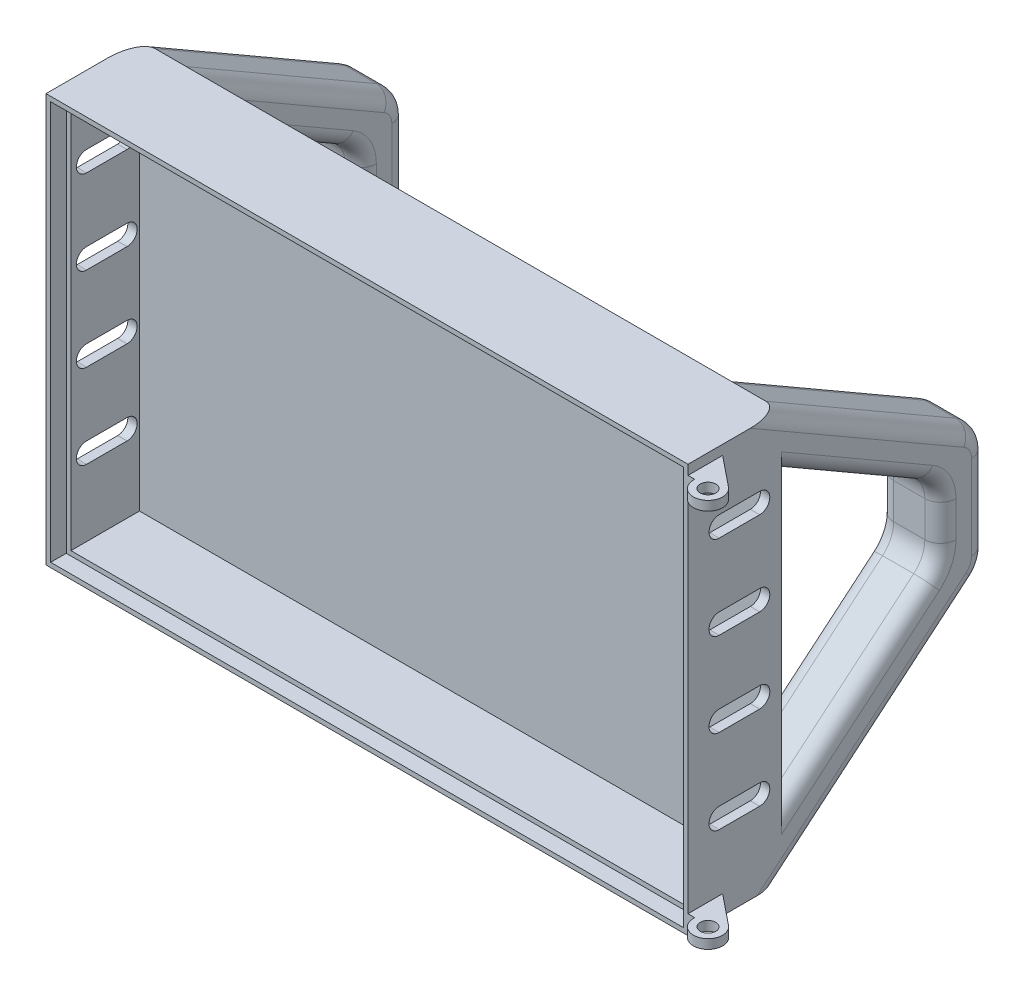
ISO-10303-21;
HEADER;
FILE_DESCRIPTION(('STEP AP214'),'2;1');
FILE_NAME('part.step','',(''),(''),'','','');
FILE_SCHEMA(('AUTOMOTIVE_DESIGN { 1 0 10303 214 1 1 1 1 }'));
ENDSEC;
DATA;
#1=APPLICATION_CONTEXT('core data for automotive mechanical design processes');
#2=APPLICATION_PROTOCOL_DEFINITION('international standard','automotive_design',2000,#1);
#3=PRODUCT_CONTEXT('',#1,'mechanical');
#4=PRODUCT('Part','Part','',(#3));
#5=PRODUCT_RELATED_PRODUCT_CATEGORY('part','',(#4));
#6=PRODUCT_DEFINITION_FORMATION('','',#4);
#7=PRODUCT_DEFINITION_CONTEXT('part definition',#1,'design');
#8=PRODUCT_DEFINITION('design','',#6,#7);
#9=PRODUCT_DEFINITION_SHAPE('','',#8);
#10=(LENGTH_UNIT() NAMED_UNIT(*) SI_UNIT(.MILLI.,.METRE.));
#11=(NAMED_UNIT(*) PLANE_ANGLE_UNIT() SI_UNIT($,.RADIAN.));
#12=(NAMED_UNIT(*) SI_UNIT($,.STERADIAN.) SOLID_ANGLE_UNIT());
#13=UNCERTAINTY_MEASURE_WITH_UNIT(LENGTH_MEASURE(1.E-05),#10,'distance_accuracy_value','');
#14=(GEOMETRIC_REPRESENTATION_CONTEXT(3) GLOBAL_UNCERTAINTY_ASSIGNED_CONTEXT((#13)) GLOBAL_UNIT_ASSIGNED_CONTEXT((#10,
#11,#12)) REPRESENTATION_CONTEXT('',''));
#15=CARTESIAN_POINT('',(0.,0.,0.));
#16=DIRECTION('',(0.,0.,1.));
#17=DIRECTION('',(1.,0.,0.));
#18=AXIS2_PLACEMENT_3D('',#15,#16,#17);
#19=CARTESIAN_POINT('',(103.,131.,30.));
#20=DIRECTION('',(-1.,0.,0.));
#21=DIRECTION('',(0.,-1.,0.));
#22=AXIS2_PLACEMENT_3D('',#19,#20,#21);
#23=PLANE('',#22);
#24=DIRECTION('',(0.,0.,-1.));
#25=VECTOR('',#24,1.);
#26=CARTESIAN_POINT('',(103.,111.971350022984,30.));
#27=LINE('',#26,#25);
#28=CARTESIAN_POINT('',(103.,111.971350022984,19.9999999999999));
#29=VERTEX_POINT('',#28);
#30=CARTESIAN_POINT('',(103.,111.971350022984,6.99999999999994));
#31=VERTEX_POINT('',#30);
#32=EDGE_CURVE('E903',#29,#31,#27,.T.);
#33=ORIENTED_EDGE('',*,*,#32,.T.);
#34=CARTESIAN_POINT('',(103.,108.721350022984,6.99999999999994));
#35=DIRECTION('',(-1.,0.,0.));
#36=DIRECTION('',(0.,-1.,0.));
#37=AXIS2_PLACEMENT_3D('',#34,#35,#36);
#38=CIRCLE('',#37,3.25000000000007);
#39=CARTESIAN_POINT('',(103.,105.471350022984,6.99999999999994));
#40=VERTEX_POINT('',#39);
#41=EDGE_CURVE('E909',#31,#40,#38,.T.);
#42=ORIENTED_EDGE('',*,*,#41,.T.);
#43=DIRECTION('',(0.,0.,1.));
#44=VECTOR('',#43,1.);
#45=CARTESIAN_POINT('',(103.,105.471350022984,30.));
#46=LINE('',#45,#44);
#47=CARTESIAN_POINT('',(103.,105.471350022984,19.9999999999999));
#48=VERTEX_POINT('',#47);
#49=EDGE_CURVE('E893',#40,#48,#46,.T.);
#50=ORIENTED_EDGE('',*,*,#49,.T.);
#51=CARTESIAN_POINT('',(103.,108.721350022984,20.));
#52=DIRECTION('',(-1.,0.,0.));
#53=DIRECTION('',(0.,-1.,0.));
#54=AXIS2_PLACEMENT_3D('',#51,#52,#53);
#55=CIRCLE('',#54,3.25000000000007);
#56=EDGE_CURVE('E898',#48,#29,#55,.T.);
#57=ORIENTED_EDGE('',*,*,#56,.T.);
#58=EDGE_LOOP('',(#33,#42,#50,#57));
#59=FACE_BOUND('',#58,.T.);
#60=DIRECTION('',(0.,0.,-1.));
#61=VECTOR('',#60,1.);
#62=CARTESIAN_POINT('',(103.,84.9713500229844,30.));
#63=LINE('',#62,#61);
#64=CARTESIAN_POINT('',(103.,84.9713500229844,19.9999999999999));
#65=VERTEX_POINT('',#64);
#66=CARTESIAN_POINT('',(103.,84.9713500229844,6.99999999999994));
#67=VERTEX_POINT('',#66);
#68=EDGE_CURVE('E882',#65,#67,#63,.T.);
#69=ORIENTED_EDGE('',*,*,#68,.T.);
#70=CARTESIAN_POINT('',(103.,81.7213500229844,6.99999999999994));
#71=DIRECTION('',(-1.,0.,0.));
#72=DIRECTION('',(0.,-1.,0.));
#73=AXIS2_PLACEMENT_3D('',#70,#71,#72);
#74=CIRCLE('',#73,3.25000000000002);
#75=CARTESIAN_POINT('',(103.,78.4713500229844,6.99999999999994));
#76=VERTEX_POINT('',#75);
#77=EDGE_CURVE('E888',#67,#76,#74,.T.);
#78=ORIENTED_EDGE('',*,*,#77,.T.);
#79=DIRECTION('',(0.,0.,1.));
#80=VECTOR('',#79,1.);
#81=CARTESIAN_POINT('',(103.,78.4713500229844,30.));
#82=LINE('',#81,#80);
#83=CARTESIAN_POINT('',(103.,78.4713500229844,19.9999999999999));
#84=VERTEX_POINT('',#83);
#85=EDGE_CURVE('E872',#76,#84,#82,.T.);
#86=ORIENTED_EDGE('',*,*,#85,.T.);
#87=CARTESIAN_POINT('',(103.,81.7213500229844,19.9999999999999));
#88=DIRECTION('',(-1.,0.,0.));
#89=DIRECTION('',(0.,-1.,0.));
#90=AXIS2_PLACEMENT_3D('',#87,#88,#89);
#91=CIRCLE('',#90,3.25000000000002);
#92=EDGE_CURVE('E877',#84,#65,#91,.T.);
#93=ORIENTED_EDGE('',*,*,#92,.T.);
#94=EDGE_LOOP('',(#69,#78,#86,#93));
#95=FACE_BOUND('',#94,.T.);
#96=DIRECTION('',(0.,0.,-1.));
#97=VECTOR('',#96,1.);
#98=CARTESIAN_POINT('',(103.,57.9713500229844,30.));
#99=LINE('',#98,#97);
#100=CARTESIAN_POINT('',(103.,57.9713500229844,20.));
#101=VERTEX_POINT('',#100);
#102=CARTESIAN_POINT('',(103.,57.9713500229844,6.99999999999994));
#103=VERTEX_POINT('',#102);
#104=EDGE_CURVE('E861',#101,#103,#99,.T.);
#105=ORIENTED_EDGE('',*,*,#104,.T.);
#106=CARTESIAN_POINT('',(103.,54.7213500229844,6.99999999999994));
#107=DIRECTION('',(-1.,0.,0.));
#108=DIRECTION('',(0.,-1.,0.));
#109=AXIS2_PLACEMENT_3D('',#106,#107,#108);
#110=CIRCLE('',#109,3.25);
#111=CARTESIAN_POINT('',(103.,51.4713500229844,6.99999999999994));
#112=VERTEX_POINT('',#111);
#113=EDGE_CURVE('E867',#103,#112,#110,.T.);
#114=ORIENTED_EDGE('',*,*,#113,.T.);
#115=DIRECTION('',(0.,0.,1.));
#116=VECTOR('',#115,1.);
#117=CARTESIAN_POINT('',(103.,51.4713500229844,30.));
#118=LINE('',#117,#116);
#119=CARTESIAN_POINT('',(103.,51.4713500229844,20.));
#120=VERTEX_POINT('',#119);
#121=EDGE_CURVE('E851',#112,#120,#118,.T.);
#122=ORIENTED_EDGE('',*,*,#121,.T.);
#123=CARTESIAN_POINT('',(103.,54.7213500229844,20.));
#124=DIRECTION('',(-1.,0.,0.));
#125=DIRECTION('',(0.,-1.,0.));
#126=AXIS2_PLACEMENT_3D('',#123,#124,#125);
#127=CIRCLE('',#126,3.25);
#128=EDGE_CURVE('E856',#120,#101,#127,.T.);
#129=ORIENTED_EDGE('',*,*,#128,.T.);
#130=EDGE_LOOP('',(#105,#114,#122,#129));
#131=FACE_BOUND('',#130,.T.);
#132=DIRECTION('',(0.,0.,-1.));
#133=VECTOR('',#132,1.);
#134=CARTESIAN_POINT('',(103.,30.9713500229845,30.));
#135=LINE('',#134,#133);
#136=CARTESIAN_POINT('',(103.,30.9713500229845,20.));
#137=VERTEX_POINT('',#136);
#138=CARTESIAN_POINT('',(103.,30.9713500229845,6.99999999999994));
#139=VERTEX_POINT('',#138);
#140=EDGE_CURVE('E840',#137,#139,#135,.T.);
#141=ORIENTED_EDGE('',*,*,#140,.T.);
#142=CARTESIAN_POINT('',(103.,27.7213500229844,6.99999999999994));
#143=DIRECTION('',(-1.,0.,0.));
#144=DIRECTION('',(0.,-1.,0.));
#145=AXIS2_PLACEMENT_3D('',#142,#143,#144);
#146=CIRCLE('',#145,3.25);
#147=CARTESIAN_POINT('',(103.,24.4713500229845,6.99999999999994));
#148=VERTEX_POINT('',#147);
#149=EDGE_CURVE('E846',#139,#148,#146,.T.);
#150=ORIENTED_EDGE('',*,*,#149,.T.);
#151=DIRECTION('',(0.,0.,1.));
#152=VECTOR('',#151,1.);
#153=CARTESIAN_POINT('',(103.,24.4713500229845,30.));
#154=LINE('',#153,#152);
#155=CARTESIAN_POINT('',(103.,24.4713500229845,20.));
#156=VERTEX_POINT('',#155);
#157=EDGE_CURVE('E830',#148,#156,#154,.T.);
#158=ORIENTED_EDGE('',*,*,#157,.T.);
#159=CARTESIAN_POINT('',(103.,27.7213500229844,20.));
#160=DIRECTION('',(-1.,0.,0.));
#161=DIRECTION('',(0.,-1.,0.));
#162=AXIS2_PLACEMENT_3D('',#159,#160,#161);
#163=CIRCLE('',#162,3.25);
#164=EDGE_CURVE('E835',#156,#137,#163,.T.);
#165=ORIENTED_EDGE('',*,*,#164,.T.);
#166=EDGE_LOOP('',(#141,#150,#158,#165));
#167=FACE_BOUND('',#166,.T.);
#168=DIRECTION('',(0.,-0.642787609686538,0.766044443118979));
#169=VECTOR('',#168,1.);
#170=CARTESIAN_POINT('',(103.,15.7508871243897,-3.2139380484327));
#171=LINE('',#170,#169);
#172=CARTESIAN_POINT('',(103.,55.5476004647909,-50.641814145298));
#173=VERTEX_POINT('',#172);
#174=CARTESIAN_POINT('',(103.,13.0540728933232,0.));
#175=VERTEX_POINT('',#174);
#176=EDGE_CURVE('E1403',#173,#175,#171,.T.);
#177=ORIENTED_EDGE('',*,*,#176,.T.);
#178=DIRECTION('',(0.,1.,0.));
#179=VECTOR('',#178,1.);
#180=CARTESIAN_POINT('',(103.,131.,0.));
#181=LINE('',#180,#179);
#182=CARTESIAN_POINT('',(103.,119.452994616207,0.));
#183=VERTEX_POINT('',#182);
#184=EDGE_CURVE('E1159',#175,#183,#181,.T.);
#185=ORIENTED_EDGE('',*,*,#184,.T.);
#186=DIRECTION('',(0.,-0.499999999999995,-0.866025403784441));
#187=VECTOR('',#186,1.);
#188=CARTESIAN_POINT('',(103.,91.4515065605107,-48.5));
#189=LINE('',#188,#187);
#190=CARTESIAN_POINT('',(103.,91.4515065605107,-48.5));
#191=VERTEX_POINT('',#190);
#192=EDGE_CURVE('E1395',#183,#191,#189,.T.);
#193=ORIENTED_EDGE('',*,*,#192,.T.);
#194=CARTESIAN_POINT('',(103.,78.461125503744,-41.));
#195=DIRECTION('',(-1.,0.,0.));
#196=DIRECTION('',(0.,-1.,0.));
#197=AXIS2_PLACEMENT_3D('',#194,#195,#196);
#198=CIRCLE('',#197,15.);
#199=CARTESIAN_POINT('',(103.,78.461125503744,-56.));
#200=VERTEX_POINT('',#199);
#201=EDGE_CURVE('E1397',#191,#200,#198,.T.);
#202=ORIENTED_EDGE('',*,*,#201,.T.);
#203=DIRECTION('',(0.,-1.,0.));
#204=VECTOR('',#203,1.);
#205=CARTESIAN_POINT('',(103.,67.0382671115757,-56.));
#206=LINE('',#205,#204);
#207=CARTESIAN_POINT('',(103.,67.0382671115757,-56.));
#208=VERTEX_POINT('',#207);
#209=EDGE_CURVE('E1399',#200,#208,#206,.T.);
#210=ORIENTED_EDGE('',*,*,#209,.T.);
#211=CARTESIAN_POINT('',(103.,67.0382671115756,-41.));
#212=DIRECTION('',(-1.,0.,0.));
#213=DIRECTION('',(0.,-1.,0.));
#214=AXIS2_PLACEMENT_3D('',#211,#212,#213);
#215=CIRCLE('',#214,15.);
#216=EDGE_CURVE('E1401',#208,#173,#215,.T.);
#217=ORIENTED_EDGE('',*,*,#216,.T.);
#218=EDGE_LOOP('',(#177,#185,#193,#202,#210,#217));
#219=FACE_BOUND('',#218,.T.);
#220=DIRECTION('',(0.,0.,1.));
#221=VECTOR('',#220,1.);
#222=CARTESIAN_POINT('',(103.,124.9,18.8893095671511));
#223=LINE('',#222,#221);
#224=CARTESIAN_POINT('',(103.,124.9,18.8893095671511));
#225=VERTEX_POINT('',#224);
#226=CARTESIAN_POINT('',(103.,124.9,30.));
#227=VERTEX_POINT('',#226);
#228=EDGE_CURVE('E926',#225,#227,#223,.T.);
#229=ORIENTED_EDGE('',*,*,#228,.T.);
#230=DIRECTION('',(0.,1.,0.));
#231=VECTOR('',#230,1.);
#232=CARTESIAN_POINT('',(103.,131.,30.));
#233=LINE('',#232,#231);
#234=CARTESIAN_POINT('',(103.,6.09999999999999,30.));
#235=VERTEX_POINT('',#234);
#236=EDGE_CURVE('E1151',#235,#227,#233,.T.);
#237=ORIENTED_EDGE('',*,*,#236,.F.);
#238=DIRECTION('',(0.,0.,1.));
#239=VECTOR('',#238,1.);
#240=CARTESIAN_POINT('',(103.,6.1,0.));
#241=LINE('',#240,#239);
#242=CARTESIAN_POINT('',(103.,6.1,18.8893095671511));
#243=VERTEX_POINT('',#242);
#244=EDGE_CURVE('E969',#243,#235,#241,.T.);
#245=ORIENTED_EDGE('',*,*,#244,.F.);
#246=DIRECTION('',(0.,-1.,0.));
#247=VECTOR('',#246,1.);
#248=CARTESIAN_POINT('',(103.,6.1,18.8893095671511));
#249=LINE('',#248,#247);
#250=CARTESIAN_POINT('',(103.,3.1,18.8893095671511));
#251=VERTEX_POINT('',#250);
#252=EDGE_CURVE('E988',#243,#251,#249,.T.);
#253=ORIENTED_EDGE('',*,*,#252,.T.);
#254=DIRECTION('',(0.,0.,1.));
#255=VECTOR('',#254,1.);
#256=CARTESIAN_POINT('',(103.,3.1,0.));
#257=LINE('',#256,#255);
#258=CARTESIAN_POINT('',(103.,3.1,30.));
#259=VERTEX_POINT('',#258);
#260=EDGE_CURVE('E960',#251,#259,#257,.T.);
#261=ORIENTED_EDGE('',*,*,#260,.T.);
#262=CARTESIAN_POINT('',(103.,0.,30.));
#263=VERTEX_POINT('',#262);
#264=EDGE_CURVE('E1147',#263,#259,#233,.T.);
#265=ORIENTED_EDGE('',*,*,#264,.F.);
#266=DIRECTION('',(0.,0.,-1.));
#267=VECTOR('',#266,1.);
#268=CARTESIAN_POINT('',(103.,0.,30.));
#269=LINE('',#268,#267);
#270=CARTESIAN_POINT('',(103.,0.,7.77861913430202));
#271=VERTEX_POINT('',#270);
#272=EDGE_CURVE('E1169',#263,#271,#269,.T.);
#273=ORIENTED_EDGE('',*,*,#272,.T.);
#274=DIRECTION('',(0.,0.642787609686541,-0.766044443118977));
#275=VECTOR('',#274,1.);
#276=CARTESIAN_POINT('',(103.,56.2134300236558,-59.2139380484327));
#277=LINE('',#276,#275);
#278=CARTESIAN_POINT('',(103.,56.2134300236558,-59.2139380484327));
#279=VERTEX_POINT('',#278);
#280=EDGE_CURVE('E1254',#271,#279,#277,.T.);
#281=ORIENTED_EDGE('',*,*,#280,.T.);
#282=CARTESIAN_POINT('',(103.,60.0436522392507,-56.));
#283=DIRECTION('',(-1.,0.,0.));
#284=DIRECTION('',(0.,-1.,0.));
#285=AXIS2_PLACEMENT_3D('',#282,#283,#284);
#286=CIRCLE('',#285,5.);
#287=CARTESIAN_POINT('',(103.,60.0436522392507,-61.));
#288=VERTEX_POINT('',#287);
#289=EDGE_CURVE('E1252',#279,#288,#286,.F.);
#290=ORIENTED_EDGE('',*,*,#289,.T.);
#291=DIRECTION('',(0.,1.,0.));
#292=VECTOR('',#291,1.);
#293=CARTESIAN_POINT('',(103.,87.1213795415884,-61.));
#294=LINE('',#293,#292);
#295=CARTESIAN_POINT('',(103.,87.1213795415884,-61.));
#296=VERTEX_POINT('',#295);
#297=EDGE_CURVE('E1250',#288,#296,#294,.T.);
#298=ORIENTED_EDGE('',*,*,#297,.T.);
#299=CARTESIAN_POINT('',(103.,87.1213795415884,-56.));
#300=DIRECTION('',(-1.,0.,0.));
#301=DIRECTION('',(0.,-1.,0.));
#302=AXIS2_PLACEMENT_3D('',#299,#300,#301);
#303=CIRCLE('',#302,4.99999999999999);
#304=CARTESIAN_POINT('',(103.,91.4515065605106,-58.5));
#305=VERTEX_POINT('',#304);
#306=EDGE_CURVE('E1248',#296,#305,#303,.F.);
#307=ORIENTED_EDGE('',*,*,#306,.T.);
#308=DIRECTION('',(0.,0.5,0.866025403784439));
#309=VECTOR('',#308,1.);
#310=CARTESIAN_POINT('',(103.,126.669872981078,2.50000000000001));
#311=LINE('',#310,#309);
#312=CARTESIAN_POINT('',(103.,131.,10.));
#313=VERTEX_POINT('',#312);
#314=EDGE_CURVE('E1246',#305,#313,#311,.T.);
#315=ORIENTED_EDGE('',*,*,#314,.T.);
#316=DIRECTION('',(0.,0.,-1.));
#317=VECTOR('',#316,1.);
#318=CARTESIAN_POINT('',(103.,131.,30.));
#319=LINE('',#318,#317);
#320=CARTESIAN_POINT('',(103.,131.,30.));
#321=VERTEX_POINT('',#320);
#322=EDGE_CURVE('E1166',#321,#313,#319,.T.);
#323=ORIENTED_EDGE('',*,*,#322,.F.);
#324=CARTESIAN_POINT('',(103.,127.9,30.));
#325=VERTEX_POINT('',#324);
#326=EDGE_CURVE('E1146',#325,#321,#233,.T.);
#327=ORIENTED_EDGE('',*,*,#326,.F.);
#328=DIRECTION('',(0.,0.,1.));
#329=VECTOR('',#328,1.);
#330=CARTESIAN_POINT('',(103.,127.9,18.8893095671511));
#331=LINE('',#330,#329);
#332=CARTESIAN_POINT('',(103.,127.9,18.8893095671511));
#333=VERTEX_POINT('',#332);
#334=EDGE_CURVE('E941',#333,#325,#331,.T.);
#335=ORIENTED_EDGE('',*,*,#334,.F.);
#336=DIRECTION('',(0.,1.,0.));
#337=VECTOR('',#336,1.);
#338=CARTESIAN_POINT('',(103.,124.9,18.8893095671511));
#339=LINE('',#338,#337);
#340=EDGE_CURVE('E953',#225,#333,#339,.T.);
#341=ORIENTED_EDGE('',*,*,#340,.F.);
#342=EDGE_LOOP('',(#229,#237,#245,#253,#261,#265,#273,#281,#290,#298,#307,#315,#323,#327,#335,#341));
#343=FACE_BOUND('',#342,.T.);
#344=ADVANCED_FACE('F43',(#59,#95,#131,#167,#219,#343),#23,.F.);
#345=CARTESIAN_POINT('',(-103.,131.,30.));
#346=DIRECTION('',(1.,0.,0.));
#347=DIRECTION('',(0.,1.,0.));
#348=AXIS2_PLACEMENT_3D('',#345,#346,#347);
#349=PLANE('',#348);
#350=DIRECTION('',(0.,0.,-1.));
#351=VECTOR('',#350,1.);
#352=CARTESIAN_POINT('',(-103.,70.6342663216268,23.1258442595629));
#353=LINE('',#352,#351);
#354=CARTESIAN_POINT('',(-103.,70.6342663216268,23.2258442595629));
#355=VERTEX_POINT('',#354);
#356=CARTESIAN_POINT('',(-103.,70.6342663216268,21.276577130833));
#357=VERTEX_POINT('',#356);
#358=EDGE_CURVE('E58',#355,#357,#353,.T.);
#359=ORIENTED_EDGE('',*,*,#358,.F.);
#360=DIRECTION('',(0.,1.,0.));
#361=VECTOR('',#360,1.);
#362=CARTESIAN_POINT('',(-103.,131.,23.2258442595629));
#363=LINE('',#362,#361);
#364=CARTESIAN_POINT('',(-103.,59.4527148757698,23.2258442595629));
#365=VERTEX_POINT('',#364);
#366=EDGE_CURVE('E1518',#355,#365,#363,.F.);
#367=ORIENTED_EDGE('',*,*,#366,.T.);
#368=DIRECTION('',(0.,0.,1.));
#369=VECTOR('',#368,1.);
#370=CARTESIAN_POINT('',(-103.,59.4527148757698,23.1258442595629));
#371=LINE('',#370,#369);
#372=CARTESIAN_POINT('',(-103.,59.4527148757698,21.276577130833));
#373=VERTEX_POINT('',#372);
#374=EDGE_CURVE('E65',#373,#365,#371,.T.);
#375=ORIENTED_EDGE('',*,*,#374,.F.);
#376=DIRECTION('',(0.,1.,0.));
#377=VECTOR('',#376,1.);
#378=CARTESIAN_POINT('',(-103.,131.,21.276577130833));
#379=LINE('',#378,#377);
#380=EDGE_CURVE('E1511',#373,#357,#379,.T.);
#381=ORIENTED_EDGE('',*,*,#380,.T.);
#382=EDGE_LOOP('',(#359,#367,#375,#381));
#383=FACE_BOUND('',#382,.T.);
#384=DIRECTION('',(0.,0.,1.));
#385=VECTOR('',#384,1.);
#386=CARTESIAN_POINT('',(-103.,105.471350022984,6.99999999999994));
#387=LINE('',#386,#385);
#388=CARTESIAN_POINT('',(-103.,105.471350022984,6.99999999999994));
#389=VERTEX_POINT('',#388);
#390=CARTESIAN_POINT('',(-103.,105.471350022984,19.9999999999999));
#391=VERTEX_POINT('',#390);
#392=EDGE_CURVE('E735',#389,#391,#387,.T.);
#393=ORIENTED_EDGE('',*,*,#392,.F.);
#394=CARTESIAN_POINT('',(-103.,108.721350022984,6.99999999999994));
#395=DIRECTION('',(-1.,0.,0.));
#396=DIRECTION('',(0.,-1.,0.));
#397=AXIS2_PLACEMENT_3D('',#394,#395,#396);
#398=CIRCLE('',#397,3.25000000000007);
#399=CARTESIAN_POINT('',(-103.,111.971350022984,6.99999999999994));
#400=VERTEX_POINT('',#399);
#401=EDGE_CURVE('E733',#400,#389,#398,.T.);
#402=ORIENTED_EDGE('',*,*,#401,.F.);
#403=DIRECTION('',(0.,0.,-1.));
#404=VECTOR('',#403,1.);
#405=CARTESIAN_POINT('',(-103.,111.971350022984,6.99999999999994));
#406=LINE('',#405,#404);
#407=CARTESIAN_POINT('',(-103.,111.971350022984,19.9999999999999));
#408=VERTEX_POINT('',#407);
#409=EDGE_CURVE('E742',#408,#400,#406,.T.);
#410=ORIENTED_EDGE('',*,*,#409,.F.);
#411=CARTESIAN_POINT('',(-103.,108.721350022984,20.));
#412=DIRECTION('',(-1.,0.,0.));
#413=DIRECTION('',(0.,-1.,0.));
#414=AXIS2_PLACEMENT_3D('',#411,#412,#413);
#415=CIRCLE('',#414,3.25000000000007);
#416=EDGE_CURVE('E739',#391,#408,#415,.T.);
#417=ORIENTED_EDGE('',*,*,#416,.F.);
#418=EDGE_LOOP('',(#393,#402,#410,#417));
#419=FACE_BOUND('',#418,.T.);
#420=DIRECTION('',(0.,0.,1.));
#421=VECTOR('',#420,1.);
#422=CARTESIAN_POINT('',(-103.,78.4713500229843,6.99999999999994));
#423=LINE('',#422,#421);
#424=CARTESIAN_POINT('',(-103.,78.4713500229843,6.99999999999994));
#425=VERTEX_POINT('',#424);
#426=CARTESIAN_POINT('',(-103.,78.4713500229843,19.9999999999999));
#427=VERTEX_POINT('',#426);
#428=EDGE_CURVE('E778',#425,#427,#423,.T.);
#429=ORIENTED_EDGE('',*,*,#428,.F.);
#430=CARTESIAN_POINT('',(-103.,81.7213500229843,6.99999999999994));
#431=DIRECTION('',(-1.,0.,0.));
#432=DIRECTION('',(0.,-1.,0.));
#433=AXIS2_PLACEMENT_3D('',#430,#431,#432);
#434=CIRCLE('',#433,3.25000000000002);
#435=CARTESIAN_POINT('',(-103.,84.9713500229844,6.99999999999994));
#436=VERTEX_POINT('',#435);
#437=EDGE_CURVE('E736',#436,#425,#434,.T.);
#438=ORIENTED_EDGE('',*,*,#437,.F.);
#439=DIRECTION('',(0.,0.,-1.));
#440=VECTOR('',#439,1.);
#441=CARTESIAN_POINT('',(-103.,84.9713500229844,6.99999999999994));
#442=LINE('',#441,#440);
#443=CARTESIAN_POINT('',(-103.,84.9713500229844,19.9999999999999));
#444=VERTEX_POINT('',#443);
#445=EDGE_CURVE('E772',#444,#436,#442,.T.);
#446=ORIENTED_EDGE('',*,*,#445,.F.);
#447=CARTESIAN_POINT('',(-103.,81.7213500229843,19.9999999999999));
#448=DIRECTION('',(-1.,0.,0.));
#449=DIRECTION('',(0.,-1.,0.));
#450=AXIS2_PLACEMENT_3D('',#447,#448,#449);
#451=CIRCLE('',#450,3.25000000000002);
#452=EDGE_CURVE('E775',#427,#444,#451,.T.);
#453=ORIENTED_EDGE('',*,*,#452,.F.);
#454=EDGE_LOOP('',(#429,#438,#446,#453));
#455=FACE_BOUND('',#454,.T.);
#456=DIRECTION('',(0.,0.,1.));
#457=VECTOR('',#456,1.);
#458=CARTESIAN_POINT('',(-103.,51.4713500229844,6.99999999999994));
#459=LINE('',#458,#457);
#460=CARTESIAN_POINT('',(-103.,51.4713500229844,6.99999999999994));
#461=VERTEX_POINT('',#460);
#462=CARTESIAN_POINT('',(-103.,51.4713500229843,20.));
#463=VERTEX_POINT('',#462);
#464=EDGE_CURVE('E802',#461,#463,#459,.T.);
#465=ORIENTED_EDGE('',*,*,#464,.F.);
#466=CARTESIAN_POINT('',(-103.,54.7213500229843,6.99999999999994));
#467=DIRECTION('',(-1.,0.,0.));
#468=DIRECTION('',(0.,-1.,0.));
#469=AXIS2_PLACEMENT_3D('',#466,#467,#468);
#470=CIRCLE('',#469,3.25);
#471=CARTESIAN_POINT('',(-103.,57.9713500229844,6.99999999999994));
#472=VERTEX_POINT('',#471);
#473=EDGE_CURVE('E771',#472,#461,#470,.T.);
#474=ORIENTED_EDGE('',*,*,#473,.F.);
#475=DIRECTION('',(0.,0.,-1.));
#476=VECTOR('',#475,1.);
#477=CARTESIAN_POINT('',(-103.,57.9713500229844,6.99999999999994));
#478=LINE('',#477,#476);
#479=CARTESIAN_POINT('',(-103.,57.9713500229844,20.));
#480=VERTEX_POINT('',#479);
#481=EDGE_CURVE('E796',#480,#472,#478,.T.);
#482=ORIENTED_EDGE('',*,*,#481,.F.);
#483=CARTESIAN_POINT('',(-103.,54.7213500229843,20.));
#484=DIRECTION('',(-1.,0.,0.));
#485=DIRECTION('',(0.,-1.,0.));
#486=AXIS2_PLACEMENT_3D('',#483,#484,#485);
#487=CIRCLE('',#486,3.25);
#488=EDGE_CURVE('E799',#463,#480,#487,.T.);
#489=ORIENTED_EDGE('',*,*,#488,.F.);
#490=EDGE_LOOP('',(#465,#474,#482,#489));
#491=FACE_BOUND('',#490,.T.);
#492=DIRECTION('',(0.,0.,1.));
#493=VECTOR('',#492,1.);
#494=CARTESIAN_POINT('',(-103.,24.4713500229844,6.99999999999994));
#495=LINE('',#494,#493);
#496=CARTESIAN_POINT('',(-103.,24.4713500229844,6.99999999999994));
#497=VERTEX_POINT('',#496);
#498=CARTESIAN_POINT('',(-103.,24.4713500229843,20.));
#499=VERTEX_POINT('',#498);
#500=EDGE_CURVE('E824',#497,#499,#495,.T.);
#501=ORIENTED_EDGE('',*,*,#500,.F.);
#502=CARTESIAN_POINT('',(-103.,27.7213500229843,6.99999999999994));
#503=DIRECTION('',(-1.,0.,0.));
#504=DIRECTION('',(0.,-1.,0.));
#505=AXIS2_PLACEMENT_3D('',#502,#503,#504);
#506=CIRCLE('',#505,3.25);
#507=CARTESIAN_POINT('',(-103.,30.9713500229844,6.99999999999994));
#508=VERTEX_POINT('',#507);
#509=EDGE_CURVE('E795',#508,#497,#506,.T.);
#510=ORIENTED_EDGE('',*,*,#509,.F.);
#511=DIRECTION('',(0.,0.,-1.));
#512=VECTOR('',#511,1.);
#513=CARTESIAN_POINT('',(-103.,30.9713500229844,6.99999999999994));
#514=LINE('',#513,#512);
#515=CARTESIAN_POINT('',(-103.,30.9713500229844,20.));
#516=VERTEX_POINT('',#515);
#517=EDGE_CURVE('E818',#516,#508,#514,.T.);
#518=ORIENTED_EDGE('',*,*,#517,.F.);
#519=CARTESIAN_POINT('',(-103.,27.7213500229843,20.));
#520=DIRECTION('',(-1.,0.,0.));
#521=DIRECTION('',(0.,-1.,0.));
#522=AXIS2_PLACEMENT_3D('',#519,#520,#521);
#523=CIRCLE('',#522,3.25);
#524=EDGE_CURVE('E821',#499,#516,#523,.T.);
#525=ORIENTED_EDGE('',*,*,#524,.F.);
#526=EDGE_LOOP('',(#501,#510,#518,#525));
#527=FACE_BOUND('',#526,.T.);
#528=DIRECTION('',(0.,0.499999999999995,0.866025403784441));
#529=VECTOR('',#528,1.);
#530=CARTESIAN_POINT('',(-103.,118.009618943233,-2.49999999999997));
#531=LINE('',#530,#529);
#532=CARTESIAN_POINT('',(-103.,91.4515065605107,-48.4999999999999));
#533=VERTEX_POINT('',#532);
#534=CARTESIAN_POINT('',(-103.,119.452994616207,0.));
#535=VERTEX_POINT('',#534);
#536=EDGE_CURVE('E1334',#533,#535,#531,.T.);
#537=ORIENTED_EDGE('',*,*,#536,.T.);
#538=DIRECTION('',(0.,-1.,0.));
#539=VECTOR('',#538,1.);
#540=CARTESIAN_POINT('',(-103.,131.,0.));
#541=LINE('',#540,#539);
#542=CARTESIAN_POINT('',(-103.,13.0540728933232,0.));
#543=VERTEX_POINT('',#542);
#544=EDGE_CURVE('E1125',#535,#543,#541,.T.);
#545=ORIENTED_EDGE('',*,*,#544,.T.);
#546=DIRECTION('',(0.,0.642787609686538,-0.766044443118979));
#547=VECTOR('',#546,1.);
#548=CARTESIAN_POINT('',(-103.,55.5476004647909,-50.6418141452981));
#549=LINE('',#548,#547);
#550=CARTESIAN_POINT('',(-103.,55.547600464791,-50.6418141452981));
#551=VERTEX_POINT('',#550);
#552=EDGE_CURVE('E1280',#543,#551,#549,.T.);
#553=ORIENTED_EDGE('',*,*,#552,.T.);
#554=CARTESIAN_POINT('',(-103.,67.0382671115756,-41.));
#555=DIRECTION('',(1.,0.,0.));
#556=DIRECTION('',(0.,1.,0.));
#557=AXIS2_PLACEMENT_3D('',#554,#555,#556);
#558=CIRCLE('',#557,15.);
#559=CARTESIAN_POINT('',(-103.,67.0382671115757,-56.));
#560=VERTEX_POINT('',#559);
#561=EDGE_CURVE('E1328',#551,#560,#558,.T.);
#562=ORIENTED_EDGE('',*,*,#561,.T.);
#563=DIRECTION('',(0.,1.,0.));
#564=VECTOR('',#563,1.);
#565=CARTESIAN_POINT('',(-103.,78.461125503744,-56.));
#566=LINE('',#565,#564);
#567=CARTESIAN_POINT('',(-103.,78.461125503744,-56.));
#568=VERTEX_POINT('',#567);
#569=EDGE_CURVE('E1330',#560,#568,#566,.T.);
#570=ORIENTED_EDGE('',*,*,#569,.T.);
#571=CARTESIAN_POINT('',(-103.,78.461125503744,-41.));
#572=DIRECTION('',(1.,0.,0.));
#573=DIRECTION('',(0.,1.,0.));
#574=AXIS2_PLACEMENT_3D('',#571,#572,#573);
#575=CIRCLE('',#574,15.);
#576=EDGE_CURVE('E1332',#568,#533,#575,.T.);
#577=ORIENTED_EDGE('',*,*,#576,.T.);
#578=EDGE_LOOP('',(#537,#545,#553,#562,#570,#577));
#579=FACE_BOUND('',#578,.T.);
#580=CARTESIAN_POINT('',(-103.,60.0436522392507,-56.));
#581=DIRECTION('',(1.,0.,0.));
#582=DIRECTION('',(0.,1.,0.));
#583=AXIS2_PLACEMENT_3D('',#580,#581,#582);
#584=CIRCLE('',#583,5.);
#585=CARTESIAN_POINT('',(-103.,60.0436522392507,-61.));
#586=VERTEX_POINT('',#585);
#587=CARTESIAN_POINT('',(-103.,56.2134300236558,-59.2139380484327));
#588=VERTEX_POINT('',#587);
#589=EDGE_CURVE('E1209',#586,#588,#584,.F.);
#590=ORIENTED_EDGE('',*,*,#589,.T.);
#591=DIRECTION('',(0.,-0.642787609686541,0.766044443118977));
#592=VECTOR('',#591,1.);
#593=CARTESIAN_POINT('',(-103.,3.83022221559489,3.21393804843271));
#594=LINE('',#593,#592);
#595=CARTESIAN_POINT('',(-103.,0.,7.77861913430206));
#596=VERTEX_POINT('',#595);
#597=EDGE_CURVE('E1211',#588,#596,#594,.T.);
#598=ORIENTED_EDGE('',*,*,#597,.T.);
#599=DIRECTION('',(0.,0.,-1.));
#600=VECTOR('',#599,1.);
#601=CARTESIAN_POINT('',(-103.,0.,30.));
#602=LINE('',#601,#600);
#603=CARTESIAN_POINT('',(-103.,0.,30.));
#604=VERTEX_POINT('',#603);
#605=EDGE_CURVE('E1172',#604,#596,#602,.T.);
#606=ORIENTED_EDGE('',*,*,#605,.F.);
#607=DIRECTION('',(0.,-1.,0.));
#608=VECTOR('',#607,1.);
#609=CARTESIAN_POINT('',(-103.,131.,30.));
#610=LINE('',#609,#608);
#611=CARTESIAN_POINT('',(-103.,131.,30.));
#612=VERTEX_POINT('',#611);
#613=EDGE_CURVE('E1140',#612,#604,#610,.T.);
#614=ORIENTED_EDGE('',*,*,#613,.F.);
#615=DIRECTION('',(0.,0.,-1.));
#616=VECTOR('',#615,1.);
#617=CARTESIAN_POINT('',(-103.,131.,30.));
#618=LINE('',#617,#616);
#619=CARTESIAN_POINT('',(-103.,131.,9.99999999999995));
#620=VERTEX_POINT('',#619);
#621=EDGE_CURVE('E1153',#612,#620,#618,.T.);
#622=ORIENTED_EDGE('',*,*,#621,.T.);
#623=DIRECTION('',(0.,-0.5,-0.866025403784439));
#624=VECTOR('',#623,1.);
#625=CARTESIAN_POINT('',(-103.,91.4515065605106,-58.5));
#626=LINE('',#625,#624);
#627=CARTESIAN_POINT('',(-103.,91.4515065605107,-58.5));
#628=VERTEX_POINT('',#627);
#629=EDGE_CURVE('E1203',#620,#628,#626,.T.);
#630=ORIENTED_EDGE('',*,*,#629,.T.);
#631=CARTESIAN_POINT('',(-103.,87.1213795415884,-56.));
#632=DIRECTION('',(1.,0.,0.));
#633=DIRECTION('',(0.,1.,0.));
#634=AXIS2_PLACEMENT_3D('',#631,#632,#633);
#635=CIRCLE('',#634,4.99999999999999);
#636=CARTESIAN_POINT('',(-103.,87.1213795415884,-61.));
#637=VERTEX_POINT('',#636);
#638=EDGE_CURVE('E1205',#628,#637,#635,.F.);
#639=ORIENTED_EDGE('',*,*,#638,.T.);
#640=DIRECTION('',(0.,-1.,0.));
#641=VECTOR('',#640,1.);
#642=CARTESIAN_POINT('',(-103.,60.0436522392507,-61.));
#643=LINE('',#642,#641);
#644=EDGE_CURVE('E1207',#637,#586,#643,.T.);
#645=ORIENTED_EDGE('',*,*,#644,.T.);
#646=EDGE_LOOP('',(#590,#598,#606,#614,#622,#630,#639,#645));
#647=FACE_BOUND('',#646,.T.);
#648=ADVANCED_FACE('F1522',(#383,#419,#455,#491,#527,#579,#647),#349,.F.);
#649=CARTESIAN_POINT('',(-103.,0.,30.));
#650=DIRECTION('',(0.,1.,0.));
#651=DIRECTION('',(-1.,0.,0.));
#652=AXIS2_PLACEMENT_3D('',#649,#650,#651);
#653=PLANE('',#652);
#654=ORIENTED_EDGE('',*,*,#605,.T.);
#655=CARTESIAN_POINT('',(-98.,0.,7.77861913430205));
#656=DIRECTION('',(0.,1.,0.));
#657=DIRECTION('',(0.,0.,-1.));
#658=AXIS2_PLACEMENT_3D('',#655,#656,#657);
#659=ELLIPSE('',#658,7.77861913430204,5.);
#660=CARTESIAN_POINT('',(-98.,0.,0.));
#661=VERTEX_POINT('',#660);
#662=EDGE_CURVE('E1216',#596,#661,#659,.F.);
#663=ORIENTED_EDGE('',*,*,#662,.T.);
#664=DIRECTION('',(1.,0.,0.));
#665=VECTOR('',#664,1.);
#666=CARTESIAN_POINT('',(-103.,0.,0.));
#667=LINE('',#666,#665);
#668=CARTESIAN_POINT('',(-88.,0.,0.));
#669=VERTEX_POINT('',#668);
#670=EDGE_CURVE('E1156',#661,#669,#667,.T.);
#671=ORIENTED_EDGE('',*,*,#670,.T.);
#672=CARTESIAN_POINT('',(88.,0.,0.));
#673=VERTEX_POINT('',#672);
#674=EDGE_CURVE('E1155',#669,#673,#667,.T.);
#675=ORIENTED_EDGE('',*,*,#674,.T.);
#676=DIRECTION('',(1.,0.,0.));
#677=VECTOR('',#676,1.);
#678=CARTESIAN_POINT('',(83.,0.,0.));
#679=LINE('',#678,#677);
#680=CARTESIAN_POINT('',(98.,0.,0.));
#681=VERTEX_POINT('',#680);
#682=EDGE_CURVE('E1048',#673,#681,#679,.T.);
#683=ORIENTED_EDGE('',*,*,#682,.T.);
#684=CARTESIAN_POINT('',(98.,0.,7.77861913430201));
#685=DIRECTION('',(0.,1.,0.));
#686=DIRECTION('',(0.,0.,1.));
#687=AXIS2_PLACEMENT_3D('',#684,#685,#686);
#688=ELLIPSE('',#687,7.77861913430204,5.);
#689=EDGE_CURVE('E1214',#681,#271,#688,.F.);
#690=ORIENTED_EDGE('',*,*,#689,.T.);
#691=ORIENTED_EDGE('',*,*,#272,.F.);
#692=DIRECTION('',(1.,0.,0.));
#693=VECTOR('',#692,1.);
#694=CARTESIAN_POINT('',(-103.,0.,30.));
#695=LINE('',#694,#693);
#696=EDGE_CURVE('E1143',#604,#263,#695,.T.);
#697=ORIENTED_EDGE('',*,*,#696,.F.);
#698=EDGE_LOOP('',(#654,#663,#671,#675,#683,#690,#691,#697));
#699=FACE_BOUND('',#698,.T.);
#700=ADVANCED_FACE('F1550',(#699),#653,.F.);
#701=CARTESIAN_POINT('',(-103.,131.,30.));
#702=DIRECTION('',(0.,-1.,0.));
#703=DIRECTION('',(1.,0.,0.));
#704=AXIS2_PLACEMENT_3D('',#701,#702,#703);
#705=PLANE('',#704);
#706=DIRECTION('',(-1.,0.,0.));
#707=VECTOR('',#706,1.);
#708=CARTESIAN_POINT('',(-83.,131.,0.));
#709=LINE('',#708,#707);
#710=CARTESIAN_POINT('',(-88.,131.,0.));
#711=VERTEX_POINT('',#710);
#712=CARTESIAN_POINT('',(-98.,131.,0.));
#713=VERTEX_POINT('',#712);
#714=EDGE_CURVE('E1100',#711,#713,#709,.T.);
#715=ORIENTED_EDGE('',*,*,#714,.T.);
#716=CARTESIAN_POINT('',(-98.,131.,9.99999999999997));
#717=DIRECTION('',(0.,-1.,0.));
#718=DIRECTION('',(0.,0.,1.));
#719=AXIS2_PLACEMENT_3D('',#716,#717,#718);
#720=ELLIPSE('',#719,9.99999999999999,5.);
#721=EDGE_CURVE('E1263',#713,#620,#720,.F.);
#722=ORIENTED_EDGE('',*,*,#721,.T.);
#723=ORIENTED_EDGE('',*,*,#621,.F.);
#724=DIRECTION('',(-1.,0.,0.));
#725=VECTOR('',#724,1.);
#726=CARTESIAN_POINT('',(-103.,131.,30.));
#727=LINE('',#726,#725);
#728=EDGE_CURVE('E1150',#321,#612,#727,.T.);
#729=ORIENTED_EDGE('',*,*,#728,.F.);
#730=ORIENTED_EDGE('',*,*,#322,.T.);
#731=CARTESIAN_POINT('',(98.,131.,10.));
#732=DIRECTION('',(0.,-1.,0.));
#733=DIRECTION('',(0.,0.,-1.));
#734=AXIS2_PLACEMENT_3D('',#731,#732,#733);
#735=ELLIPSE('',#734,9.99999999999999,5.);
#736=CARTESIAN_POINT('',(98.,131.,0.));
#737=VERTEX_POINT('',#736);
#738=EDGE_CURVE('E1261',#313,#737,#735,.F.);
#739=ORIENTED_EDGE('',*,*,#738,.T.);
#740=DIRECTION('',(-1.,0.,0.));
#741=VECTOR('',#740,1.);
#742=CARTESIAN_POINT('',(-103.,131.,0.));
#743=LINE('',#742,#741);
#744=CARTESIAN_POINT('',(88.,131.,0.));
#745=VERTEX_POINT('',#744);
#746=EDGE_CURVE('E1144',#737,#745,#743,.T.);
#747=ORIENTED_EDGE('',*,*,#746,.T.);
#748=EDGE_CURVE('E1161',#745,#711,#743,.T.);
#749=ORIENTED_EDGE('',*,*,#748,.T.);
#750=EDGE_LOOP('',(#715,#722,#723,#729,#730,#739,#747,#749));
#751=FACE_BOUND('',#750,.T.);
#752=ADVANCED_FACE('F1555',(#751),#705,.F.);
#753=CARTESIAN_POINT('',(0.,0.,30.));
#754=DIRECTION('',(0.,0.,1.));
#755=DIRECTION('',(1.,0.,0.));
#756=AXIS2_PLACEMENT_3D('',#753,#754,#755);
#757=PLANE('',#756);
#758=DIRECTION('',(-1.,0.,0.));
#759=VECTOR('',#758,1.);
#760=CARTESIAN_POINT('',(101.5,129.5,30.));
#761=LINE('',#760,#759);
#762=CARTESIAN_POINT('',(101.5,129.5,30.));
#763=VERTEX_POINT('',#762);
#764=CARTESIAN_POINT('',(-101.5,129.5,30.));
#765=VERTEX_POINT('',#764);
#766=EDGE_CURVE('E1009',#763,#765,#761,.T.);
#767=ORIENTED_EDGE('',*,*,#766,.F.);
#768=DIRECTION('',(0.,1.,0.));
#769=VECTOR('',#768,1.);
#770=CARTESIAN_POINT('',(101.5,1.50000000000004,30.));
#771=LINE('',#770,#769);
#772=CARTESIAN_POINT('',(101.5,1.50000000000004,30.));
#773=VERTEX_POINT('',#772);
#774=EDGE_CURVE('E1014',#773,#763,#771,.T.);
#775=ORIENTED_EDGE('',*,*,#774,.F.);
#776=DIRECTION('',(1.,0.,0.));
#777=VECTOR('',#776,1.);
#778=CARTESIAN_POINT('',(-101.5,1.5,30.));
#779=LINE('',#778,#777);
#780=CARTESIAN_POINT('',(-101.5,1.5,30.));
#781=VERTEX_POINT('',#780);
#782=EDGE_CURVE('E1028',#781,#773,#779,.T.);
#783=ORIENTED_EDGE('',*,*,#782,.F.);
#784=DIRECTION('',(0.,-1.,0.));
#785=VECTOR('',#784,1.);
#786=CARTESIAN_POINT('',(-101.5,129.5,30.));
#787=LINE('',#786,#785);
#788=EDGE_CURVE('E1025',#765,#781,#787,.T.);
#789=ORIENTED_EDGE('',*,*,#788,.F.);
#790=EDGE_LOOP('',(#767,#775,#783,#789));
#791=FACE_BOUND('',#790,.T.);
#792=ORIENTED_EDGE('',*,*,#613,.T.);
#793=ORIENTED_EDGE('',*,*,#696,.T.);
#794=ORIENTED_EDGE('',*,*,#264,.T.);
#795=DIRECTION('',(1.,0.,0.));
#796=VECTOR('',#795,1.);
#797=CARTESIAN_POINT('',(0.,3.1,30.));
#798=LINE('',#797,#796);
#799=CARTESIAN_POINT('',(105.18,3.1,30.));
#800=VERTEX_POINT('',#799);
#801=EDGE_CURVE('E984',#259,#800,#798,.T.);
#802=ORIENTED_EDGE('',*,*,#801,.T.);
#803=DIRECTION('',(0.,-1.,0.));
#804=VECTOR('',#803,1.);
#805=CARTESIAN_POINT('',(105.18,6.1,30.));
#806=LINE('',#805,#804);
#807=CARTESIAN_POINT('',(105.18,6.1,30.));
#808=VERTEX_POINT('',#807);
#809=EDGE_CURVE('E992',#808,#800,#806,.T.);
#810=ORIENTED_EDGE('',*,*,#809,.F.);
#811=DIRECTION('',(1.,0.,0.));
#812=VECTOR('',#811,1.);
#813=CARTESIAN_POINT('',(0.,6.1,30.));
#814=LINE('',#813,#812);
#815=EDGE_CURVE('E967',#235,#808,#814,.T.);
#816=ORIENTED_EDGE('',*,*,#815,.F.);
#817=ORIENTED_EDGE('',*,*,#236,.T.);
#818=DIRECTION('',(1.,0.,0.));
#819=VECTOR('',#818,1.);
#820=CARTESIAN_POINT('',(103.,124.9,30.));
#821=LINE('',#820,#819);
#822=CARTESIAN_POINT('',(105.18,124.9,30.));
#823=VERTEX_POINT('',#822);
#824=EDGE_CURVE('E929',#227,#823,#821,.T.);
#825=ORIENTED_EDGE('',*,*,#824,.T.);
#826=DIRECTION('',(0.,1.,0.));
#827=VECTOR('',#826,1.);
#828=CARTESIAN_POINT('',(105.18,124.9,30.));
#829=LINE('',#828,#827);
#830=CARTESIAN_POINT('',(105.18,127.9,30.));
#831=VERTEX_POINT('',#830);
#832=EDGE_CURVE('E951',#823,#831,#829,.T.);
#833=ORIENTED_EDGE('',*,*,#832,.T.);
#834=DIRECTION('',(1.,0.,0.));
#835=VECTOR('',#834,1.);
#836=CARTESIAN_POINT('',(103.,127.9,30.));
#837=LINE('',#836,#835);
#838=EDGE_CURVE('E943',#325,#831,#837,.T.);
#839=ORIENTED_EDGE('',*,*,#838,.F.);
#840=ORIENTED_EDGE('',*,*,#326,.T.);
#841=ORIENTED_EDGE('',*,*,#728,.T.);
#842=EDGE_LOOP('',(#792,#793,#794,#802,#810,#816,#817,#825,#833,#839,#840,#841));
#843=FACE_BOUND('',#842,.T.);
#844=ADVANCED_FACE('F2103',(#791,#843),#757,.T.);
#845=CARTESIAN_POINT('',(0.,0.,0.));
#846=DIRECTION('',(0.,0.,1.));
#847=DIRECTION('',(1.,0.,0.));
#848=AXIS2_PLACEMENT_3D('',#845,#846,#847);
#849=PLANE('',#848);
#850=ORIENTED_EDGE('',*,*,#184,.F.);
#851=CARTESIAN_POINT('',(98.,13.0540728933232,0.));
#852=DIRECTION('',(0.,0.,1.));
#853=DIRECTION('',(0.,1.,0.));
#854=AXIS2_PLACEMENT_3D('',#851,#852,#853);
#855=ELLIPSE('',#854,6.52703644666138,5.);
#856=CARTESIAN_POINT('',(98.,19.5811093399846,0.));
#857=VERTEX_POINT('',#856);
#858=EDGE_CURVE('E1416',#175,#857,#855,.T.);
#859=ORIENTED_EDGE('',*,*,#858,.T.);
#860=DIRECTION('',(1.,0.,0.));
#861=VECTOR('',#860,1.);
#862=CARTESIAN_POINT('',(83.,19.5811093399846,0.));
#863=LINE('',#862,#861);
#864=CARTESIAN_POINT('',(88.,19.5811093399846,0.));
#865=VERTEX_POINT('',#864);
#866=EDGE_CURVE('E1049',#865,#857,#863,.T.);
#867=ORIENTED_EDGE('',*,*,#866,.F.);
#868=CARTESIAN_POINT('',(88.,13.0540728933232,0.));
#869=DIRECTION('',(0.,0.,1.));
#870=DIRECTION('',(0.,1.,0.));
#871=AXIS2_PLACEMENT_3D('',#868,#869,#870);
#872=ELLIPSE('',#871,6.52703644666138,5.);
#873=CARTESIAN_POINT('',(83.,13.0540728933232,0.));
#874=VERTEX_POINT('',#873);
#875=EDGE_CURVE('E1423',#865,#874,#872,.T.);
#876=ORIENTED_EDGE('',*,*,#875,.T.);
#877=DIRECTION('',(0.,-1.,0.));
#878=VECTOR('',#877,1.);
#879=CARTESIAN_POINT('',(83.,19.5811093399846,0.));
#880=LINE('',#879,#878);
#881=CARTESIAN_POINT('',(83.,6.52703644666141,0.));
#882=VERTEX_POINT('',#881);
#883=EDGE_CURVE('E1042',#874,#882,#880,.T.);
#884=ORIENTED_EDGE('',*,*,#883,.T.);
#885=CARTESIAN_POINT('',(88.,6.52703644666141,0.));
#886=DIRECTION('',(0.,0.,1.));
#887=DIRECTION('',(0.,-1.,0.));
#888=AXIS2_PLACEMENT_3D('',#885,#886,#887);
#889=ELLIPSE('',#888,6.5270364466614,5.);
#890=EDGE_CURVE('E1272',#882,#673,#889,.T.);
#891=ORIENTED_EDGE('',*,*,#890,.T.);
#892=ORIENTED_EDGE('',*,*,#674,.F.);
#893=CARTESIAN_POINT('',(-88.,6.52703644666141,0.));
#894=DIRECTION('',(0.,0.,1.));
#895=DIRECTION('',(0.,1.,0.));
#896=AXIS2_PLACEMENT_3D('',#893,#894,#895);
#897=ELLIPSE('',#896,6.5270364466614,5.);
#898=CARTESIAN_POINT('',(-83.,6.5270364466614,0.));
#899=VERTEX_POINT('',#898);
#900=EDGE_CURVE('E1270',#669,#899,#897,.T.);
#901=ORIENTED_EDGE('',*,*,#900,.T.);
#902=DIRECTION('',(0.,1.,0.));
#903=VECTOR('',#902,1.);
#904=CARTESIAN_POINT('',(-83.,19.5811093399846,0.));
#905=LINE('',#904,#903);
#906=CARTESIAN_POINT('',(-83.,13.0540728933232,0.));
#907=VERTEX_POINT('',#906);
#908=EDGE_CURVE('E1052',#899,#907,#905,.T.);
#909=ORIENTED_EDGE('',*,*,#908,.T.);
#910=CARTESIAN_POINT('',(-88.,13.0540728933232,0.));
#911=DIRECTION('',(0.,0.,1.));
#912=DIRECTION('',(0.,-1.,0.));
#913=AXIS2_PLACEMENT_3D('',#910,#911,#912);
#914=ELLIPSE('',#913,6.52703644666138,5.);
#915=CARTESIAN_POINT('',(-88.,19.5811093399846,0.));
#916=VERTEX_POINT('',#915);
#917=EDGE_CURVE('E1412',#907,#916,#914,.T.);
#918=ORIENTED_EDGE('',*,*,#917,.T.);
#919=DIRECTION('',(-1.,0.,0.));
#920=VECTOR('',#919,1.);
#921=CARTESIAN_POINT('',(-83.,19.5811093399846,0.));
#922=LINE('',#921,#920);
#923=CARTESIAN_POINT('',(-98.,19.5811093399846,0.));
#924=VERTEX_POINT('',#923);
#925=EDGE_CURVE('E1086',#916,#924,#922,.T.);
#926=ORIENTED_EDGE('',*,*,#925,.T.);
#927=CARTESIAN_POINT('',(-98.,13.0540728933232,0.));
#928=DIRECTION('',(0.,0.,1.));
#929=DIRECTION('',(0.,-1.,0.));
#930=AXIS2_PLACEMENT_3D('',#927,#928,#929);
#931=ELLIPSE('',#930,6.52703644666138,5.);
#932=EDGE_CURVE('E1418',#924,#543,#931,.T.);
#933=ORIENTED_EDGE('',*,*,#932,.T.);
#934=ORIENTED_EDGE('',*,*,#544,.F.);
#935=CARTESIAN_POINT('',(-98.,119.452994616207,0.));
#936=DIRECTION('',(0.,0.,1.));
#937=DIRECTION('',(0.,-1.,0.));
#938=AXIS2_PLACEMENT_3D('',#935,#936,#937);
#939=ELLIPSE('',#938,5.77350269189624,5.);
#940=CARTESIAN_POINT('',(-98.,113.679491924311,0.));
#941=VERTEX_POINT('',#940);
#942=EDGE_CURVE('E1410',#535,#941,#939,.T.);
#943=ORIENTED_EDGE('',*,*,#942,.T.);
#944=DIRECTION('',(-1.,0.,0.));
#945=VECTOR('',#944,1.);
#946=CARTESIAN_POINT('',(-83.,113.679491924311,0.));
#947=LINE('',#946,#945);
#948=CARTESIAN_POINT('',(-88.,113.679491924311,0.));
#949=VERTEX_POINT('',#948);
#950=EDGE_CURVE('E1103',#949,#941,#947,.T.);
#951=ORIENTED_EDGE('',*,*,#950,.F.);
#952=CARTESIAN_POINT('',(-88.,119.452994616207,0.));
#953=DIRECTION('',(0.,0.,1.));
#954=DIRECTION('',(0.,-1.,0.));
#955=AXIS2_PLACEMENT_3D('',#952,#953,#954);
#956=ELLIPSE('',#955,5.77350269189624,5.);
#957=CARTESIAN_POINT('',(-83.,119.452994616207,0.));
#958=VERTEX_POINT('',#957);
#959=EDGE_CURVE('E1421',#949,#958,#956,.T.);
#960=ORIENTED_EDGE('',*,*,#959,.T.);
#961=DIRECTION('',(0.,1.,0.));
#962=VECTOR('',#961,1.);
#963=CARTESIAN_POINT('',(-83.,131.,0.));
#964=LINE('',#963,#962);
#965=CARTESIAN_POINT('',(-83.,125.226497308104,0.));
#966=VERTEX_POINT('',#965);
#967=EDGE_CURVE('E1084',#958,#966,#964,.T.);
#968=ORIENTED_EDGE('',*,*,#967,.T.);
#969=CARTESIAN_POINT('',(-88.,125.226497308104,0.));
#970=DIRECTION('',(0.,0.,1.));
#971=DIRECTION('',(0.,1.,0.));
#972=AXIS2_PLACEMENT_3D('',#969,#970,#971);
#973=ELLIPSE('',#972,5.77350269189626,5.);
#974=EDGE_CURVE('E1275',#966,#711,#973,.T.);
#975=ORIENTED_EDGE('',*,*,#974,.T.);
#976=ORIENTED_EDGE('',*,*,#748,.F.);
#977=CARTESIAN_POINT('',(88.,125.226497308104,0.));
#978=DIRECTION('',(0.,0.,1.));
#979=DIRECTION('',(0.,-1.,0.));
#980=AXIS2_PLACEMENT_3D('',#977,#978,#979);
#981=ELLIPSE('',#980,5.77350269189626,5.);
#982=CARTESIAN_POINT('',(83.,125.226497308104,0.));
#983=VERTEX_POINT('',#982);
#984=EDGE_CURVE('E1278',#745,#983,#981,.T.);
#985=ORIENTED_EDGE('',*,*,#984,.T.);
#986=DIRECTION('',(0.,-1.,0.));
#987=VECTOR('',#986,1.);
#988=CARTESIAN_POINT('',(83.,131.,0.));
#989=LINE('',#988,#987);
#990=CARTESIAN_POINT('',(83.,119.452994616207,0.));
#991=VERTEX_POINT('',#990);
#992=EDGE_CURVE('E1044',#983,#991,#989,.T.);
#993=ORIENTED_EDGE('',*,*,#992,.T.);
#994=CARTESIAN_POINT('',(88.,119.452994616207,0.));
#995=DIRECTION('',(0.,0.,1.));
#996=DIRECTION('',(0.,1.,0.));
#997=AXIS2_PLACEMENT_3D('',#994,#995,#996);
#998=ELLIPSE('',#997,5.77350269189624,5.);
#999=CARTESIAN_POINT('',(88.,113.679491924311,0.));
#1000=VERTEX_POINT('',#999);
#1001=EDGE_CURVE('E1414',#991,#1000,#998,.T.);
#1002=ORIENTED_EDGE('',*,*,#1001,.T.);
#1003=DIRECTION('',(1.,0.,0.));
#1004=VECTOR('',#1003,1.);
#1005=CARTESIAN_POINT('',(83.,113.679491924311,0.));
#1006=LINE('',#1005,#1004);
#1007=CARTESIAN_POINT('',(98.,113.679491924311,0.));
#1008=VERTEX_POINT('',#1007);
#1009=EDGE_CURVE('E1065',#1000,#1008,#1006,.T.);
#1010=ORIENTED_EDGE('',*,*,#1009,.T.);
#1011=CARTESIAN_POINT('',(98.,119.452994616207,0.));
#1012=DIRECTION('',(0.,0.,1.));
#1013=DIRECTION('',(0.,1.,0.));
#1014=AXIS2_PLACEMENT_3D('',#1011,#1012,#1013);
#1015=ELLIPSE('',#1014,5.77350269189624,5.);
#1016=EDGE_CURVE('E1425',#1008,#183,#1015,.T.);
#1017=ORIENTED_EDGE('',*,*,#1016,.T.);
#1018=EDGE_LOOP('',(#850,#859,#867,#876,#884,#891,#892,#901,#909,#918,#926,#933,#934,#943,#951,
#960,#968,#975,#976,#985,#993,#1002,#1010,#1017));
#1019=FACE_BOUND('',#1018,.T.);
#1020=ADVANCED_FACE('F2107',(#1019),#849,.F.);
#1021=CARTESIAN_POINT('',(-83.,0.,0.));
#1022=DIRECTION('',(0.,-0.766044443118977,-0.642787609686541));
#1023=DIRECTION('',(0.,0.642787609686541,-0.766044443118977));
#1024=AXIS2_PLACEMENT_3D('',#1021,#1022,#1023);
#1025=PLANE('',#1024);
#1026=DIRECTION('',(-1.,0.,0.));
#1027=VECTOR('',#1026,1.);
#1028=CARTESIAN_POINT('',(-83.,52.3832078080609,-62.4278760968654));
#1029=LINE('',#1028,#1027);
#1030=CARTESIAN_POINT('',(-88.,52.3832078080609,-62.4278760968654));
#1031=VERTEX_POINT('',#1030);
#1032=CARTESIAN_POINT('',(-98.,52.3832078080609,-62.4278760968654));
#1033=VERTEX_POINT('',#1032);
#1034=EDGE_CURVE('E1087',#1031,#1033,#1029,.T.);
#1035=ORIENTED_EDGE('',*,*,#1034,.F.);
#1036=DIRECTION('',(0.,-0.642787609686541,0.766044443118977));
#1037=VECTOR('',#1036,1.);
#1038=CARTESIAN_POINT('',(-88.,0.,0.));
#1039=LINE('',#1038,#1037);
#1040=EDGE_CURVE('E1177',#1031,#669,#1039,.T.);
#1041=ORIENTED_EDGE('',*,*,#1040,.T.);
#1042=ORIENTED_EDGE('',*,*,#670,.F.);
#1043=DIRECTION('',(0.,-0.642787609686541,0.766044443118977));
#1044=VECTOR('',#1043,1.);
#1045=CARTESIAN_POINT('',(-98.,52.3832078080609,-62.4278760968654));
#1046=LINE('',#1045,#1044);
#1047=EDGE_CURVE('E1175',#661,#1033,#1046,.F.);
#1048=ORIENTED_EDGE('',*,*,#1047,.T.);
#1049=EDGE_LOOP('',(#1035,#1041,#1042,#1048));
#1050=FACE_BOUND('',#1049,.T.);
#1051=ADVANCED_FACE('F2245',(#1050),#1025,.T.);
#1052=CARTESIAN_POINT('',(-83.,60.0436522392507,-56.));
#1053=DIRECTION('',(-1.,0.,0.));
#1054=DIRECTION('',(0.,-1.,0.));
#1055=AXIS2_PLACEMENT_3D('',#1052,#1053,#1054);
#1056=CYLINDRICAL_SURFACE('',#1055,10.);
#1057=DIRECTION('',(-1.,0.,0.));
#1058=VECTOR('',#1057,1.);
#1059=CARTESIAN_POINT('',(-83.,60.0436522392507,-66.));
#1060=LINE('',#1059,#1058);
#1061=CARTESIAN_POINT('',(-88.,60.0436522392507,-66.));
#1062=VERTEX_POINT('',#1061);
#1063=CARTESIAN_POINT('',(-98.,60.0436522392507,-66.));
#1064=VERTEX_POINT('',#1063);
#1065=EDGE_CURVE('E1091',#1062,#1064,#1060,.T.);
#1066=ORIENTED_EDGE('',*,*,#1065,.F.);
#1067=CARTESIAN_POINT('',(-88.,60.0436522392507,-56.));
#1068=DIRECTION('',(-1.,0.,0.));
#1069=DIRECTION('',(0.,-1.,0.));
#1070=AXIS2_PLACEMENT_3D('',#1067,#1068,#1069);
#1071=CIRCLE('',#1070,10.);
#1072=EDGE_CURVE('E1193',#1062,#1031,#1071,.T.);
#1073=ORIENTED_EDGE('',*,*,#1072,.T.);
#1074=ORIENTED_EDGE('',*,*,#1034,.T.);
#1075=CARTESIAN_POINT('',(-98.,60.0436522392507,-56.));
#1076=DIRECTION('',(1.,0.,0.));
#1077=DIRECTION('',(0.,1.,0.));
#1078=AXIS2_PLACEMENT_3D('',#1075,#1076,#1077);
#1079=CIRCLE('',#1078,10.);
#1080=EDGE_CURVE('E1191',#1033,#1064,#1079,.T.);
#1081=ORIENTED_EDGE('',*,*,#1080,.T.);
#1082=EDGE_LOOP('',(#1066,#1073,#1074,#1081));
#1083=FACE_BOUND('',#1082,.T.);
#1084=ADVANCED_FACE('F2251',(#1083),#1056,.T.);
#1085=CARTESIAN_POINT('',(-83.,60.0436522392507,-66.));
#1086=DIRECTION('',(0.,0.,-1.));
#1087=DIRECTION('',(0.,1.,0.));
#1088=AXIS2_PLACEMENT_3D('',#1085,#1086,#1087);
#1089=PLANE('',#1088);
#1090=DIRECTION('',(-1.,0.,0.));
#1091=VECTOR('',#1090,1.);
#1092=CARTESIAN_POINT('',(-83.,87.1213795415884,-65.9999999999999));
#1093=LINE('',#1092,#1091);
#1094=CARTESIAN_POINT('',(-88.,87.1213795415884,-65.9999999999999));
#1095=VERTEX_POINT('',#1094);
#1096=CARTESIAN_POINT('',(-98.,87.1213795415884,-65.9999999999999));
#1097=VERTEX_POINT('',#1096);
#1098=EDGE_CURVE('E1094',#1095,#1097,#1093,.T.);
#1099=ORIENTED_EDGE('',*,*,#1098,.F.);
#1100=DIRECTION('',(0.,-1.,0.));
#1101=VECTOR('',#1100,1.);
#1102=CARTESIAN_POINT('',(-88.,60.0436522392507,-66.));
#1103=LINE('',#1102,#1101);
#1104=EDGE_CURVE('E1197',#1095,#1062,#1103,.T.);
#1105=ORIENTED_EDGE('',*,*,#1104,.T.);
#1106=ORIENTED_EDGE('',*,*,#1065,.T.);
#1107=DIRECTION('',(0.,-1.,0.));
#1108=VECTOR('',#1107,1.);
#1109=CARTESIAN_POINT('',(-98.,87.1213795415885,-65.9999999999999));
#1110=LINE('',#1109,#1108);
#1111=EDGE_CURVE('E1195',#1064,#1097,#1110,.F.);
#1112=ORIENTED_EDGE('',*,*,#1111,.T.);
#1113=EDGE_LOOP('',(#1099,#1105,#1106,#1112));
#1114=FACE_BOUND('',#1113,.T.);
#1115=ADVANCED_FACE('F2262',(#1114),#1089,.T.);
#1116=CARTESIAN_POINT('',(-83.,87.1213795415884,-56.));
#1117=DIRECTION('',(-1.,0.,0.));
#1118=DIRECTION('',(0.,-1.,0.));
#1119=AXIS2_PLACEMENT_3D('',#1116,#1117,#1118);
#1120=CYLINDRICAL_SURFACE('',#1119,9.99999999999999);
#1121=DIRECTION('',(-1.,0.,0.));
#1122=VECTOR('',#1121,1.);
#1123=CARTESIAN_POINT('',(-83.,95.7816335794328,-61.));
#1124=LINE('',#1123,#1122);
#1125=CARTESIAN_POINT('',(-88.,95.7816335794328,-61.));
#1126=VERTEX_POINT('',#1125);
#1127=CARTESIAN_POINT('',(-98.,95.7816335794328,-61.));
#1128=VERTEX_POINT('',#1127);
#1129=EDGE_CURVE('E1097',#1126,#1128,#1124,.T.);
#1130=ORIENTED_EDGE('',*,*,#1129,.F.);
#1131=CARTESIAN_POINT('',(-88.,87.1213795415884,-56.));
#1132=DIRECTION('',(-1.,0.,0.));
#1133=DIRECTION('',(0.,-1.,0.));
#1134=AXIS2_PLACEMENT_3D('',#1131,#1132,#1133);
#1135=CIRCLE('',#1134,9.99999999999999);
#1136=EDGE_CURVE('E1201',#1126,#1095,#1135,.T.);
#1137=ORIENTED_EDGE('',*,*,#1136,.T.);
#1138=ORIENTED_EDGE('',*,*,#1098,.T.);
#1139=CARTESIAN_POINT('',(-98.,87.1213795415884,-56.));
#1140=DIRECTION('',(1.,0.,0.));
#1141=DIRECTION('',(0.,1.,0.));
#1142=AXIS2_PLACEMENT_3D('',#1139,#1140,#1141);
#1143=CIRCLE('',#1142,9.99999999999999);
#1144=EDGE_CURVE('E1199',#1097,#1128,#1143,.T.);
#1145=ORIENTED_EDGE('',*,*,#1144,.T.);
#1146=EDGE_LOOP('',(#1130,#1137,#1138,#1145));
#1147=FACE_BOUND('',#1146,.T.);
#1148=ADVANCED_FACE('F2272',(#1147),#1120,.T.);
#1149=CARTESIAN_POINT('',(-83.,95.7816335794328,-61.));
#1150=DIRECTION('',(0.,0.866025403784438,-0.5));
#1151=DIRECTION('',(0.,0.5,0.866025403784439));
#1152=AXIS2_PLACEMENT_3D('',#1149,#1150,#1151);
#1153=PLANE('',#1152);
#1154=ORIENTED_EDGE('',*,*,#714,.F.);
#1155=DIRECTION('',(0.,-0.5,-0.866025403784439));
#1156=VECTOR('',#1155,1.);
#1157=CARTESIAN_POINT('',(-88.,95.7816335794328,-61.));
#1158=LINE('',#1157,#1156);
#1159=EDGE_CURVE('E1259',#711,#1126,#1158,.T.);
#1160=ORIENTED_EDGE('',*,*,#1159,.T.);
#1161=ORIENTED_EDGE('',*,*,#1129,.T.);
#1162=DIRECTION('',(0.,-0.5,-0.866025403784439));
#1163=VECTOR('',#1162,1.);
#1164=CARTESIAN_POINT('',(-98.,131.,0.));
#1165=LINE('',#1164,#1163);
#1166=EDGE_CURVE('E1257',#1128,#713,#1165,.F.);
#1167=ORIENTED_EDGE('',*,*,#1166,.T.);
#1168=EDGE_LOOP('',(#1154,#1160,#1161,#1167));
#1169=FACE_BOUND('',#1168,.T.);
#1170=ADVANCED_FACE('F2282',(#1169),#1153,.T.);
#1171=CARTESIAN_POINT('',(-83.,87.1213795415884,-46.));
#1172=DIRECTION('',(0.,-0.866025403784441,0.499999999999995));
#1173=DIRECTION('',(0.,-0.499999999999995,-0.866025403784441));
#1174=AXIS2_PLACEMENT_3D('',#1171,#1172,#1173);
#1175=PLANE('',#1174);
#1176=ORIENTED_EDGE('',*,*,#950,.T.);
#1177=DIRECTION('',(0.,0.499999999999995,0.866025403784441));
#1178=VECTOR('',#1177,1.);
#1179=CARTESIAN_POINT('',(-98.,87.1213795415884,-46.));
#1180=LINE('',#1179,#1178);
#1181=CARTESIAN_POINT('',(-98.,87.1213795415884,-46.));
#1182=VERTEX_POINT('',#1181);
#1183=EDGE_CURVE('E1339',#941,#1182,#1180,.F.);
#1184=ORIENTED_EDGE('',*,*,#1183,.T.);
#1185=DIRECTION('',(-1.,0.,0.));
#1186=VECTOR('',#1185,1.);
#1187=CARTESIAN_POINT('',(-83.,87.1213795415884,-46.));
#1188=LINE('',#1187,#1186);
#1189=CARTESIAN_POINT('',(-88.,87.1213795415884,-46.));
#1190=VERTEX_POINT('',#1189);
#1191=EDGE_CURVE('E1106',#1190,#1182,#1188,.T.);
#1192=ORIENTED_EDGE('',*,*,#1191,.F.);
#1193=DIRECTION('',(0.,0.499999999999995,0.866025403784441));
#1194=VECTOR('',#1193,1.);
#1195=CARTESIAN_POINT('',(-88.,113.679491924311,0.));
#1196=LINE('',#1195,#1194);
#1197=EDGE_CURVE('E1337',#1190,#949,#1196,.T.);
#1198=ORIENTED_EDGE('',*,*,#1197,.T.);
#1199=EDGE_LOOP('',(#1176,#1184,#1192,#1198));
#1200=FACE_BOUND('',#1199,.T.);
#1201=ADVANCED_FACE('F2292',(#1200),#1175,.T.);
#1202=CARTESIAN_POINT('',(-83.,78.461125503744,-41.));
#1203=DIRECTION('',(-1.,0.,0.));
#1204=DIRECTION('',(0.,-1.,0.));
#1205=AXIS2_PLACEMENT_3D('',#1202,#1203,#1204);
#1206=CYLINDRICAL_SURFACE('',#1205,9.99999999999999);
#1207=ORIENTED_EDGE('',*,*,#1191,.T.);
#1208=CARTESIAN_POINT('',(-98.,78.461125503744,-41.));
#1209=DIRECTION('',(1.,0.,0.));
#1210=DIRECTION('',(0.,1.,0.));
#1211=AXIS2_PLACEMENT_3D('',#1208,#1209,#1210);
#1212=CIRCLE('',#1211,9.99999999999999);
#1213=CARTESIAN_POINT('',(-98.,78.461125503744,-51.));
#1214=VERTEX_POINT('',#1213);
#1215=EDGE_CURVE('E1343',#1182,#1214,#1212,.F.);
#1216=ORIENTED_EDGE('',*,*,#1215,.T.);
#1217=DIRECTION('',(-1.,0.,0.));
#1218=VECTOR('',#1217,1.);
#1219=CARTESIAN_POINT('',(-83.,78.461125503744,-51.));
#1220=LINE('',#1219,#1218);
#1221=CARTESIAN_POINT('',(-88.,78.461125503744,-51.));
#1222=VERTEX_POINT('',#1221);
#1223=EDGE_CURVE('E1109',#1222,#1214,#1220,.T.);
#1224=ORIENTED_EDGE('',*,*,#1223,.F.);
#1225=CARTESIAN_POINT('',(-88.,78.461125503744,-41.));
#1226=DIRECTION('',(-1.,0.,0.));
#1227=DIRECTION('',(0.,-1.,0.));
#1228=AXIS2_PLACEMENT_3D('',#1225,#1226,#1227);
#1229=CIRCLE('',#1228,9.99999999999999);
#1230=EDGE_CURVE('E1341',#1222,#1190,#1229,.F.);
#1231=ORIENTED_EDGE('',*,*,#1230,.T.);
#1232=EDGE_LOOP('',(#1207,#1216,#1224,#1231));
#1233=FACE_BOUND('',#1232,.T.);
#1234=ADVANCED_FACE('F2303',(#1233),#1206,.F.);
#1235=CARTESIAN_POINT('',(-83.,67.0382671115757,-51.));
#1236=DIRECTION('',(0.,0.,1.));
#1237=DIRECTION('',(0.,-1.,0.));
#1238=AXIS2_PLACEMENT_3D('',#1235,#1236,#1237);
#1239=PLANE('',#1238);
#1240=ORIENTED_EDGE('',*,*,#1223,.T.);
#1241=DIRECTION('',(0.,1.,0.));
#1242=VECTOR('',#1241,1.);
#1243=CARTESIAN_POINT('',(-98.,67.0382671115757,-51.));
#1244=LINE('',#1243,#1242);
#1245=CARTESIAN_POINT('',(-98.,67.0382671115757,-51.));
#1246=VERTEX_POINT('',#1245);
#1247=EDGE_CURVE('E1347',#1214,#1246,#1244,.F.);
#1248=ORIENTED_EDGE('',*,*,#1247,.T.);
#1249=DIRECTION('',(-1.,0.,0.));
#1250=VECTOR('',#1249,1.);
#1251=CARTESIAN_POINT('',(-83.,67.0382671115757,-51.));
#1252=LINE('',#1251,#1250);
#1253=CARTESIAN_POINT('',(-88.,67.0382671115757,-51.));
#1254=VERTEX_POINT('',#1253);
#1255=EDGE_CURVE('E1112',#1254,#1246,#1252,.T.);
#1256=ORIENTED_EDGE('',*,*,#1255,.F.);
#1257=DIRECTION('',(0.,1.,0.));
#1258=VECTOR('',#1257,1.);
#1259=CARTESIAN_POINT('',(-88.,78.461125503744,-51.));
#1260=LINE('',#1259,#1258);
#1261=EDGE_CURVE('E1345',#1254,#1222,#1260,.T.);
#1262=ORIENTED_EDGE('',*,*,#1261,.T.);
#1263=EDGE_LOOP('',(#1240,#1248,#1256,#1262));
#1264=FACE_BOUND('',#1263,.T.);
#1265=ADVANCED_FACE('F2314',(#1264),#1239,.T.);
#1266=CARTESIAN_POINT('',(-83.,67.0382671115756,-41.));
#1267=DIRECTION('',(-1.,0.,0.));
#1268=DIRECTION('',(0.,-1.,0.));
#1269=AXIS2_PLACEMENT_3D('',#1266,#1267,#1268);
#1270=CYLINDRICAL_SURFACE('',#1269,9.99999999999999);
#1271=ORIENTED_EDGE('',*,*,#1255,.T.);
#1272=CARTESIAN_POINT('',(-98.,67.0382671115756,-41.));
#1273=DIRECTION('',(1.,0.,0.));
#1274=DIRECTION('',(0.,1.,0.));
#1275=AXIS2_PLACEMENT_3D('',#1272,#1273,#1274);
#1276=CIRCLE('',#1275,9.99999999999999);
#1277=CARTESIAN_POINT('',(-98.,59.3778226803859,-47.4278760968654));
#1278=VERTEX_POINT('',#1277);
#1279=EDGE_CURVE('E1351',#1246,#1278,#1276,.F.);
#1280=ORIENTED_EDGE('',*,*,#1279,.T.);
#1281=DIRECTION('',(-1.,0.,0.));
#1282=VECTOR('',#1281,1.);
#1283=CARTESIAN_POINT('',(-83.,59.3778226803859,-47.4278760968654));
#1284=LINE('',#1283,#1282);
#1285=CARTESIAN_POINT('',(-88.,59.3778226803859,-47.4278760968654));
#1286=VERTEX_POINT('',#1285);
#1287=EDGE_CURVE('E1115',#1286,#1278,#1284,.T.);
#1288=ORIENTED_EDGE('',*,*,#1287,.F.);
#1289=CARTESIAN_POINT('',(-88.,67.0382671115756,-41.));
#1290=DIRECTION('',(-1.,0.,0.));
#1291=DIRECTION('',(0.,-1.,0.));
#1292=AXIS2_PLACEMENT_3D('',#1289,#1290,#1291);
#1293=CIRCLE('',#1292,9.99999999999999);
#1294=EDGE_CURVE('E1349',#1286,#1254,#1293,.F.);
#1295=ORIENTED_EDGE('',*,*,#1294,.T.);
#1296=EDGE_LOOP('',(#1271,#1280,#1288,#1295));
#1297=FACE_BOUND('',#1296,.T.);
#1298=ADVANCED_FACE('F2324',(#1297),#1270,.F.);
#1299=CARTESIAN_POINT('',(-83.,19.5811093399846,0.));
#1300=DIRECTION('',(0.,0.766044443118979,0.642787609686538));
#1301=DIRECTION('',(0.,-0.642787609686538,0.766044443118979));
#1302=AXIS2_PLACEMENT_3D('',#1299,#1300,#1301);
#1303=PLANE('',#1302);
#1304=ORIENTED_EDGE('',*,*,#925,.F.);
#1305=DIRECTION('',(0.,0.642787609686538,-0.766044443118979));
#1306=VECTOR('',#1305,1.);
#1307=CARTESIAN_POINT('',(-88.,59.3778226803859,-47.4278760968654));
#1308=LINE('',#1307,#1306);
#1309=EDGE_CURVE('E1355',#916,#1286,#1308,.T.);
#1310=ORIENTED_EDGE('',*,*,#1309,.T.);
#1311=ORIENTED_EDGE('',*,*,#1287,.T.);
#1312=DIRECTION('',(0.,0.642787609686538,-0.766044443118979));
#1313=VECTOR('',#1312,1.);
#1314=CARTESIAN_POINT('',(-98.,19.5811093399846,0.));
#1315=LINE('',#1314,#1313);
#1316=EDGE_CURVE('E1353',#1278,#924,#1315,.F.);
#1317=ORIENTED_EDGE('',*,*,#1316,.T.);
#1318=EDGE_LOOP('',(#1304,#1310,#1311,#1317));
#1319=FACE_BOUND('',#1318,.T.);
#1320=ADVANCED_FACE('F2334',(#1319),#1303,.T.);
#1321=CARTESIAN_POINT('',(-83.,60.0436522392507,-56.));
#1322=DIRECTION('',(-1.,0.,0.));
#1323=DIRECTION('',(0.,-1.,0.));
#1324=AXIS2_PLACEMENT_3D('',#1321,#1322,#1323);
#1325=PLANE('',#1324);
#1326=CARTESIAN_POINT('',(-83.,67.0382671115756,-41.));
#1327=DIRECTION('',(-1.,0.,0.));
#1328=DIRECTION('',(0.,-1.,0.));
#1329=AXIS2_PLACEMENT_3D('',#1326,#1327,#1328);
#1330=CIRCLE('',#1329,15.);
#1331=CARTESIAN_POINT('',(-83.,67.0382671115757,-56.));
#1332=VERTEX_POINT('',#1331);
#1333=CARTESIAN_POINT('',(-83.,55.547600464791,-50.6418141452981));
#1334=VERTEX_POINT('',#1333);
#1335=EDGE_CURVE('E1364',#1332,#1334,#1330,.T.);
#1336=ORIENTED_EDGE('',*,*,#1335,.T.);
#1337=DIRECTION('',(0.,0.642787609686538,-0.766044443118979));
#1338=VECTOR('',#1337,1.);
#1339=CARTESIAN_POINT('',(-83.,15.7508871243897,-3.21393804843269));
#1340=LINE('',#1339,#1338);
#1341=EDGE_CURVE('E1366',#1334,#907,#1340,.F.);
#1342=ORIENTED_EDGE('',*,*,#1341,.T.);
#1343=ORIENTED_EDGE('',*,*,#908,.F.);
#1344=DIRECTION('',(0.,-0.642787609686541,0.766044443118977));
#1345=VECTOR('',#1344,1.);
#1346=CARTESIAN_POINT('',(-83.,56.2134300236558,-59.2139380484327));
#1347=LINE('',#1346,#1345);
#1348=CARTESIAN_POINT('',(-83.,56.2134300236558,-59.2139380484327));
#1349=VERTEX_POINT('',#1348);
#1350=EDGE_CURVE('E1189',#899,#1349,#1347,.F.);
#1351=ORIENTED_EDGE('',*,*,#1350,.T.);
#1352=CARTESIAN_POINT('',(-83.,60.0436522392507,-56.));
#1353=DIRECTION('',(-1.,0.,0.));
#1354=DIRECTION('',(0.,-1.,0.));
#1355=AXIS2_PLACEMENT_3D('',#1352,#1353,#1354);
#1356=CIRCLE('',#1355,5.);
#1357=CARTESIAN_POINT('',(-83.,60.0436522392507,-61.));
#1358=VERTEX_POINT('',#1357);
#1359=EDGE_CURVE('E1187',#1349,#1358,#1356,.F.);
#1360=ORIENTED_EDGE('',*,*,#1359,.T.);
#1361=DIRECTION('',(0.,-1.,0.));
#1362=VECTOR('',#1361,1.);
#1363=CARTESIAN_POINT('',(-83.,87.1213795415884,-61.));
#1364=LINE('',#1363,#1362);
#1365=CARTESIAN_POINT('',(-83.,87.1213795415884,-61.));
#1366=VERTEX_POINT('',#1365);
#1367=EDGE_CURVE('E1185',#1358,#1366,#1364,.F.);
#1368=ORIENTED_EDGE('',*,*,#1367,.T.);
#1369=CARTESIAN_POINT('',(-83.,87.1213795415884,-56.));
#1370=DIRECTION('',(-1.,0.,0.));
#1371=DIRECTION('',(0.,-1.,0.));
#1372=AXIS2_PLACEMENT_3D('',#1369,#1370,#1371);
#1373=CIRCLE('',#1372,4.99999999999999);
#1374=CARTESIAN_POINT('',(-83.,91.4515065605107,-58.5));
#1375=VERTEX_POINT('',#1374);
#1376=EDGE_CURVE('E1183',#1366,#1375,#1373,.F.);
#1377=ORIENTED_EDGE('',*,*,#1376,.T.);
#1378=DIRECTION('',(0.,-0.5,-0.866025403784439));
#1379=VECTOR('',#1378,1.);
#1380=CARTESIAN_POINT('',(-83.,126.669872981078,2.50000000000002));
#1381=LINE('',#1380,#1379);
#1382=EDGE_CURVE('E1180',#1375,#966,#1381,.F.);
#1383=ORIENTED_EDGE('',*,*,#1382,.T.);
#1384=ORIENTED_EDGE('',*,*,#967,.F.);
#1385=DIRECTION('',(0.,0.499999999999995,0.866025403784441));
#1386=VECTOR('',#1385,1.);
#1387=CARTESIAN_POINT('',(-83.,91.4515065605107,-48.4999999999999));
#1388=LINE('',#1387,#1386);
#1389=CARTESIAN_POINT('',(-83.,91.4515065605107,-48.5));
#1390=VERTEX_POINT('',#1389);
#1391=EDGE_CURVE('E1358',#958,#1390,#1388,.F.);
#1392=ORIENTED_EDGE('',*,*,#1391,.T.);
#1393=CARTESIAN_POINT('',(-83.,78.461125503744,-41.));
#1394=DIRECTION('',(-1.,0.,0.));
#1395=DIRECTION('',(0.,-1.,0.));
#1396=AXIS2_PLACEMENT_3D('',#1393,#1394,#1395);
#1397=CIRCLE('',#1396,15.);
#1398=CARTESIAN_POINT('',(-83.,78.461125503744,-56.));
#1399=VERTEX_POINT('',#1398);
#1400=EDGE_CURVE('E1360',#1390,#1399,#1397,.T.);
#1401=ORIENTED_EDGE('',*,*,#1400,.T.);
#1402=DIRECTION('',(0.,1.,0.));
#1403=VECTOR('',#1402,1.);
#1404=CARTESIAN_POINT('',(-83.,67.0382671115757,-56.));
#1405=LINE('',#1404,#1403);
#1406=EDGE_CURVE('E1362',#1399,#1332,#1405,.F.);
#1407=ORIENTED_EDGE('',*,*,#1406,.T.);
#1408=EDGE_LOOP('',(#1336,#1342,#1343,#1351,#1360,#1368,#1377,#1383,#1384,#1392,#1401,#1407));
#1409=FACE_BOUND('',#1408,.T.);
#1410=ADVANCED_FACE('F2344',(#1409),#1325,.F.);
#1411=CARTESIAN_POINT('',(83.,59.3778226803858,-47.4278760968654));
#1412=DIRECTION('',(0.,0.766044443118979,0.642787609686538));
#1413=DIRECTION('',(0.,-0.642787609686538,0.766044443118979));
#1414=AXIS2_PLACEMENT_3D('',#1411,#1412,#1413);
#1415=PLANE('',#1414);
#1416=ORIENTED_EDGE('',*,*,#866,.T.);
#1417=DIRECTION('',(0.,-0.642787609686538,0.766044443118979));
#1418=VECTOR('',#1417,1.);
#1419=CARTESIAN_POINT('',(98.,59.3778226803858,-47.4278760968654));
#1420=LINE('',#1419,#1418);
#1421=CARTESIAN_POINT('',(98.,59.3778226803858,-47.4278760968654));
#1422=VERTEX_POINT('',#1421);
#1423=EDGE_CURVE('E1408',#857,#1422,#1420,.F.);
#1424=ORIENTED_EDGE('',*,*,#1423,.T.);
#1425=DIRECTION('',(1.,0.,0.));
#1426=VECTOR('',#1425,1.);
#1427=CARTESIAN_POINT('',(83.,59.3778226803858,-47.4278760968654));
#1428=LINE('',#1427,#1426);
#1429=CARTESIAN_POINT('',(88.,59.3778226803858,-47.4278760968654));
#1430=VERTEX_POINT('',#1429);
#1431=EDGE_CURVE('E1053',#1430,#1422,#1428,.T.);
#1432=ORIENTED_EDGE('',*,*,#1431,.F.);
#1433=DIRECTION('',(0.,-0.642787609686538,0.766044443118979));
#1434=VECTOR('',#1433,1.);
#1435=CARTESIAN_POINT('',(88.,19.5811093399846,0.));
#1436=LINE('',#1435,#1434);
#1437=EDGE_CURVE('E1406',#1430,#865,#1436,.T.);
#1438=ORIENTED_EDGE('',*,*,#1437,.T.);
#1439=EDGE_LOOP('',(#1416,#1424,#1432,#1438));
#1440=FACE_BOUND('',#1439,.T.);
#1441=ADVANCED_FACE('F2354',(#1440),#1415,.T.);
#1442=CARTESIAN_POINT('',(83.,67.0382671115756,-41.));
#1443=DIRECTION('',(1.,0.,0.));
#1444=DIRECTION('',(0.,0.,-1.));
#1445=AXIS2_PLACEMENT_3D('',#1442,#1443,#1444);
#1446=CYLINDRICAL_SURFACE('',#1445,9.99999999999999);
#1447=DIRECTION('',(1.,0.,0.));
#1448=VECTOR('',#1447,1.);
#1449=CARTESIAN_POINT('',(83.,67.0382671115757,-51.));
#1450=LINE('',#1449,#1448);
#1451=CARTESIAN_POINT('',(88.,67.0382671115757,-51.));
#1452=VERTEX_POINT('',#1451);
#1453=CARTESIAN_POINT('',(98.,67.0382671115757,-51.));
#1454=VERTEX_POINT('',#1453);
#1455=EDGE_CURVE('E1056',#1452,#1454,#1450,.T.);
#1456=ORIENTED_EDGE('',*,*,#1455,.F.);
#1457=CARTESIAN_POINT('',(88.,67.0382671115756,-41.));
#1458=DIRECTION('',(1.,0.,0.));
#1459=DIRECTION('',(0.,0.,-1.));
#1460=AXIS2_PLACEMENT_3D('',#1457,#1458,#1459);
#1461=CIRCLE('',#1460,9.99999999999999);
#1462=EDGE_CURVE('E1393',#1452,#1430,#1461,.F.);
#1463=ORIENTED_EDGE('',*,*,#1462,.T.);
#1464=ORIENTED_EDGE('',*,*,#1431,.T.);
#1465=CARTESIAN_POINT('',(98.,67.0382671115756,-41.));
#1466=DIRECTION('',(-1.,0.,0.));
#1467=DIRECTION('',(0.,-1.,0.));
#1468=AXIS2_PLACEMENT_3D('',#1465,#1466,#1467);
#1469=CIRCLE('',#1468,9.99999999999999);
#1470=EDGE_CURVE('E1391',#1422,#1454,#1469,.F.);
#1471=ORIENTED_EDGE('',*,*,#1470,.T.);
#1472=EDGE_LOOP('',(#1456,#1463,#1464,#1471));
#1473=FACE_BOUND('',#1472,.T.);
#1474=ADVANCED_FACE('F2364',(#1473),#1446,.F.);
#1475=CARTESIAN_POINT('',(83.,78.461125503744,-51.));
#1476=DIRECTION('',(0.,0.,1.));
#1477=DIRECTION('',(0.,-1.,0.));
#1478=AXIS2_PLACEMENT_3D('',#1475,#1476,#1477);
#1479=PLANE('',#1478);
#1480=DIRECTION('',(1.,0.,0.));
#1481=VECTOR('',#1480,1.);
#1482=CARTESIAN_POINT('',(83.,78.461125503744,-51.));
#1483=LINE('',#1482,#1481);
#1484=CARTESIAN_POINT('',(88.,78.461125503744,-51.));
#1485=VERTEX_POINT('',#1484);
#1486=CARTESIAN_POINT('',(98.,78.461125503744,-51.));
#1487=VERTEX_POINT('',#1486);
#1488=EDGE_CURVE('E1059',#1485,#1487,#1483,.T.);
#1489=ORIENTED_EDGE('',*,*,#1488,.F.);
#1490=DIRECTION('',(0.,-1.,0.));
#1491=VECTOR('',#1490,1.);
#1492=CARTESIAN_POINT('',(88.,67.0382671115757,-51.));
#1493=LINE('',#1492,#1491);
#1494=EDGE_CURVE('E1389',#1485,#1452,#1493,.T.);
#1495=ORIENTED_EDGE('',*,*,#1494,.T.);
#1496=ORIENTED_EDGE('',*,*,#1455,.T.);
#1497=DIRECTION('',(0.,-1.,0.));
#1498=VECTOR('',#1497,1.);
#1499=CARTESIAN_POINT('',(98.,78.461125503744,-51.));
#1500=LINE('',#1499,#1498);
#1501=EDGE_CURVE('E1387',#1454,#1487,#1500,.F.);
#1502=ORIENTED_EDGE('',*,*,#1501,.T.);
#1503=EDGE_LOOP('',(#1489,#1495,#1496,#1502));
#1504=FACE_BOUND('',#1503,.T.);
#1505=ADVANCED_FACE('F2374',(#1504),#1479,.T.);
#1506=CARTESIAN_POINT('',(83.,78.461125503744,-41.));
#1507=DIRECTION('',(1.,0.,0.));
#1508=DIRECTION('',(0.,0.,-1.));
#1509=AXIS2_PLACEMENT_3D('',#1506,#1507,#1508);
#1510=CYLINDRICAL_SURFACE('',#1509,9.99999999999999);
#1511=DIRECTION('',(1.,0.,0.));
#1512=VECTOR('',#1511,1.);
#1513=CARTESIAN_POINT('',(83.,87.1213795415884,-46.));
#1514=LINE('',#1513,#1512);
#1515=CARTESIAN_POINT('',(88.,87.1213795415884,-46.));
#1516=VERTEX_POINT('',#1515);
#1517=CARTESIAN_POINT('',(98.,87.1213795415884,-46.));
#1518=VERTEX_POINT('',#1517);
#1519=EDGE_CURVE('E1062',#1516,#1518,#1514,.T.);
#1520=ORIENTED_EDGE('',*,*,#1519,.F.);
#1521=CARTESIAN_POINT('',(88.,78.461125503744,-41.));
#1522=DIRECTION('',(1.,0.,0.));
#1523=DIRECTION('',(0.,0.,-1.));
#1524=AXIS2_PLACEMENT_3D('',#1521,#1522,#1523);
#1525=CIRCLE('',#1524,9.99999999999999);
#1526=EDGE_CURVE('E1385',#1516,#1485,#1525,.F.);
#1527=ORIENTED_EDGE('',*,*,#1526,.T.);
#1528=ORIENTED_EDGE('',*,*,#1488,.T.);
#1529=CARTESIAN_POINT('',(98.,78.461125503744,-41.));
#1530=DIRECTION('',(-1.,0.,0.));
#1531=DIRECTION('',(0.,-1.,0.));
#1532=AXIS2_PLACEMENT_3D('',#1529,#1530,#1531);
#1533=CIRCLE('',#1532,9.99999999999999);
#1534=EDGE_CURVE('E1383',#1487,#1518,#1533,.F.);
#1535=ORIENTED_EDGE('',*,*,#1534,.T.);
#1536=EDGE_LOOP('',(#1520,#1527,#1528,#1535));
#1537=FACE_BOUND('',#1536,.T.);
#1538=ADVANCED_FACE('F2384',(#1537),#1510,.F.);
#1539=CARTESIAN_POINT('',(83.,113.679491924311,0.));
#1540=DIRECTION('',(0.,-0.866025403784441,0.499999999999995));
#1541=DIRECTION('',(0.,-0.499999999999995,-0.866025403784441));
#1542=AXIS2_PLACEMENT_3D('',#1539,#1540,#1541);
#1543=PLANE('',#1542);
#1544=ORIENTED_EDGE('',*,*,#1009,.F.);
#1545=DIRECTION('',(0.,-0.499999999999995,-0.866025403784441));
#1546=VECTOR('',#1545,1.);
#1547=CARTESIAN_POINT('',(88.,87.1213795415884,-46.));
#1548=LINE('',#1547,#1546);
#1549=EDGE_CURVE('E1370',#1000,#1516,#1548,.T.);
#1550=ORIENTED_EDGE('',*,*,#1549,.T.);
#1551=ORIENTED_EDGE('',*,*,#1519,.T.);
#1552=DIRECTION('',(0.,-0.499999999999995,-0.866025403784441));
#1553=VECTOR('',#1552,1.);
#1554=CARTESIAN_POINT('',(98.,113.679491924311,0.));
#1555=LINE('',#1554,#1553);
#1556=EDGE_CURVE('E1368',#1518,#1008,#1555,.F.);
#1557=ORIENTED_EDGE('',*,*,#1556,.T.);
#1558=EDGE_LOOP('',(#1544,#1550,#1551,#1557));
#1559=FACE_BOUND('',#1558,.T.);
#1560=ADVANCED_FACE('F2394',(#1559),#1543,.T.);
#1561=CARTESIAN_POINT('',(83.,95.7816335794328,-61.));
#1562=DIRECTION('',(0.,0.866025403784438,-0.5));
#1563=DIRECTION('',(0.,0.5,0.866025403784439));
#1564=AXIS2_PLACEMENT_3D('',#1561,#1562,#1563);
#1565=PLANE('',#1564);
#1566=DIRECTION('',(1.,0.,0.));
#1567=VECTOR('',#1566,1.);
#1568=CARTESIAN_POINT('',(83.,95.7816335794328,-61.));
#1569=LINE('',#1568,#1567);
#1570=CARTESIAN_POINT('',(88.,95.7816335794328,-61.));
#1571=VERTEX_POINT('',#1570);
#1572=CARTESIAN_POINT('',(98.,95.7816335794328,-61.));
#1573=VERTEX_POINT('',#1572);
#1574=EDGE_CURVE('E1068',#1571,#1573,#1569,.T.);
#1575=ORIENTED_EDGE('',*,*,#1574,.F.);
#1576=DIRECTION('',(0.,0.5,0.866025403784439));
#1577=VECTOR('',#1576,1.);
#1578=CARTESIAN_POINT('',(88.,131.,0.));
#1579=LINE('',#1578,#1577);
#1580=EDGE_CURVE('E1267',#1571,#745,#1579,.T.);
#1581=ORIENTED_EDGE('',*,*,#1580,.T.);
#1582=ORIENTED_EDGE('',*,*,#746,.F.);
#1583=DIRECTION('',(0.,0.5,0.866025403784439));
#1584=VECTOR('',#1583,1.);
#1585=CARTESIAN_POINT('',(98.,95.7816335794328,-61.));
#1586=LINE('',#1585,#1584);
#1587=EDGE_CURVE('E1265',#737,#1573,#1586,.F.);
#1588=ORIENTED_EDGE('',*,*,#1587,.T.);
#1589=EDGE_LOOP('',(#1575,#1581,#1582,#1588));
#1590=FACE_BOUND('',#1589,.T.);
#1591=ADVANCED_FACE('F2404',(#1590),#1565,.T.);
#1592=CARTESIAN_POINT('',(83.,87.1213795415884,-56.));
#1593=DIRECTION('',(1.,0.,0.));
#1594=DIRECTION('',(0.,0.,-1.));
#1595=AXIS2_PLACEMENT_3D('',#1592,#1593,#1594);
#1596=CYLINDRICAL_SURFACE('',#1595,9.99999999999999);
#1597=DIRECTION('',(1.,0.,0.));
#1598=VECTOR('',#1597,1.);
#1599=CARTESIAN_POINT('',(83.,87.1213795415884,-65.9999999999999));
#1600=LINE('',#1599,#1598);
#1601=CARTESIAN_POINT('',(88.,87.1213795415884,-65.9999999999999));
#1602=VERTEX_POINT('',#1601);
#1603=CARTESIAN_POINT('',(98.,87.1213795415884,-65.9999999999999));
#1604=VERTEX_POINT('',#1603);
#1605=EDGE_CURVE('E1071',#1602,#1604,#1600,.T.);
#1606=ORIENTED_EDGE('',*,*,#1605,.F.);
#1607=CARTESIAN_POINT('',(88.,87.1213795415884,-56.));
#1608=DIRECTION('',(1.,0.,0.));
#1609=DIRECTION('',(0.,0.,-1.));
#1610=AXIS2_PLACEMENT_3D('',#1607,#1608,#1609);
#1611=CIRCLE('',#1610,9.99999999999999);
#1612=EDGE_CURVE('E1244',#1602,#1571,#1611,.T.);
#1613=ORIENTED_EDGE('',*,*,#1612,.T.);
#1614=ORIENTED_EDGE('',*,*,#1574,.T.);
#1615=CARTESIAN_POINT('',(98.,87.1213795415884,-56.));
#1616=DIRECTION('',(-1.,0.,0.));
#1617=DIRECTION('',(0.,-1.,0.));
#1618=AXIS2_PLACEMENT_3D('',#1615,#1616,#1617);
#1619=CIRCLE('',#1618,9.99999999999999);
#1620=EDGE_CURVE('E1242',#1573,#1604,#1619,.T.);
#1621=ORIENTED_EDGE('',*,*,#1620,.T.);
#1622=EDGE_LOOP('',(#1606,#1613,#1614,#1621));
#1623=FACE_BOUND('',#1622,.T.);
#1624=ADVANCED_FACE('F2414',(#1623),#1596,.T.);
#1625=CARTESIAN_POINT('',(83.,60.0436522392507,-66.));
#1626=DIRECTION('',(0.,0.,-1.));
#1627=DIRECTION('',(0.,1.,0.));
#1628=AXIS2_PLACEMENT_3D('',#1625,#1626,#1627);
#1629=PLANE('',#1628);
#1630=DIRECTION('',(1.,0.,0.));
#1631=VECTOR('',#1630,1.);
#1632=CARTESIAN_POINT('',(83.,60.0436522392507,-66.));
#1633=LINE('',#1632,#1631);
#1634=CARTESIAN_POINT('',(88.,60.0436522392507,-66.));
#1635=VERTEX_POINT('',#1634);
#1636=CARTESIAN_POINT('',(98.,60.0436522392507,-66.));
#1637=VERTEX_POINT('',#1636);
#1638=EDGE_CURVE('E1074',#1635,#1637,#1633,.T.);
#1639=ORIENTED_EDGE('',*,*,#1638,.F.);
#1640=DIRECTION('',(0.,1.,0.));
#1641=VECTOR('',#1640,1.);
#1642=CARTESIAN_POINT('',(88.,87.1213795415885,-65.9999999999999));
#1643=LINE('',#1642,#1641);
#1644=EDGE_CURVE('E1240',#1635,#1602,#1643,.T.);
#1645=ORIENTED_EDGE('',*,*,#1644,.T.);
#1646=ORIENTED_EDGE('',*,*,#1605,.T.);
#1647=DIRECTION('',(0.,1.,0.));
#1648=VECTOR('',#1647,1.);
#1649=CARTESIAN_POINT('',(98.,60.0436522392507,-66.));
#1650=LINE('',#1649,#1648);
#1651=EDGE_CURVE('E1238',#1604,#1637,#1650,.F.);
#1652=ORIENTED_EDGE('',*,*,#1651,.T.);
#1653=EDGE_LOOP('',(#1639,#1645,#1646,#1652));
#1654=FACE_BOUND('',#1653,.T.);
#1655=ADVANCED_FACE('F2424',(#1654),#1629,.T.);
#1656=CARTESIAN_POINT('',(83.,60.0436522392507,-56.));
#1657=DIRECTION('',(1.,0.,0.));
#1658=DIRECTION('',(0.,0.,-1.));
#1659=AXIS2_PLACEMENT_3D('',#1656,#1657,#1658);
#1660=CYLINDRICAL_SURFACE('',#1659,10.);
#1661=DIRECTION('',(1.,0.,0.));
#1662=VECTOR('',#1661,1.);
#1663=CARTESIAN_POINT('',(83.,52.3832078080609,-62.4278760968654));
#1664=LINE('',#1663,#1662);
#1665=CARTESIAN_POINT('',(88.,52.3832078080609,-62.4278760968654));
#1666=VERTEX_POINT('',#1665);
#1667=CARTESIAN_POINT('',(98.,52.3832078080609,-62.4278760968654));
#1668=VERTEX_POINT('',#1667);
#1669=EDGE_CURVE('E1077',#1666,#1668,#1664,.T.);
#1670=ORIENTED_EDGE('',*,*,#1669,.F.);
#1671=CARTESIAN_POINT('',(88.,60.0436522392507,-56.));
#1672=DIRECTION('',(1.,0.,0.));
#1673=DIRECTION('',(0.,0.,-1.));
#1674=AXIS2_PLACEMENT_3D('',#1671,#1672,#1673);
#1675=CIRCLE('',#1674,10.);
#1676=EDGE_CURVE('E1236',#1666,#1635,#1675,.T.);
#1677=ORIENTED_EDGE('',*,*,#1676,.T.);
#1678=ORIENTED_EDGE('',*,*,#1638,.T.);
#1679=CARTESIAN_POINT('',(98.,60.0436522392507,-56.));
#1680=DIRECTION('',(-1.,0.,0.));
#1681=DIRECTION('',(0.,-1.,0.));
#1682=AXIS2_PLACEMENT_3D('',#1679,#1680,#1681);
#1683=CIRCLE('',#1682,10.);
#1684=EDGE_CURVE('E1234',#1637,#1668,#1683,.T.);
#1685=ORIENTED_EDGE('',*,*,#1684,.T.);
#1686=EDGE_LOOP('',(#1670,#1677,#1678,#1685));
#1687=FACE_BOUND('',#1686,.T.);
#1688=ADVANCED_FACE('F2434',(#1687),#1660,.T.);
#1689=CARTESIAN_POINT('',(83.,0.,0.));
#1690=DIRECTION('',(0.,-0.766044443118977,-0.642787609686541));
#1691=DIRECTION('',(0.,0.642787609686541,-0.766044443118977));
#1692=AXIS2_PLACEMENT_3D('',#1689,#1690,#1691);
#1693=PLANE('',#1692);
#1694=ORIENTED_EDGE('',*,*,#682,.F.);
#1695=DIRECTION('',(0.,0.642787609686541,-0.766044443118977));
#1696=VECTOR('',#1695,1.);
#1697=CARTESIAN_POINT('',(88.,52.3832078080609,-62.4278760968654));
#1698=LINE('',#1697,#1696);
#1699=EDGE_CURVE('E1220',#673,#1666,#1698,.T.);
#1700=ORIENTED_EDGE('',*,*,#1699,.T.);
#1701=ORIENTED_EDGE('',*,*,#1669,.T.);
#1702=DIRECTION('',(0.,0.642787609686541,-0.766044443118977));
#1703=VECTOR('',#1702,1.);
#1704=CARTESIAN_POINT('',(98.,0.,0.));
#1705=LINE('',#1704,#1703);
#1706=EDGE_CURVE('E1218',#1668,#681,#1705,.F.);
#1707=ORIENTED_EDGE('',*,*,#1706,.T.);
#1708=EDGE_LOOP('',(#1694,#1700,#1701,#1707));
#1709=FACE_BOUND('',#1708,.T.);
#1710=ADVANCED_FACE('F2444',(#1709),#1693,.T.);
#1711=CARTESIAN_POINT('',(83.,60.0436522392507,-56.));
#1712=DIRECTION('',(1.,0.,0.));
#1713=DIRECTION('',(0.,0.,-1.));
#1714=AXIS2_PLACEMENT_3D('',#1711,#1712,#1713);
#1715=PLANE('',#1714);
#1716=CARTESIAN_POINT('',(83.,78.461125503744,-41.));
#1717=DIRECTION('',(1.,0.,0.));
#1718=DIRECTION('',(0.,0.,-1.));
#1719=AXIS2_PLACEMENT_3D('',#1716,#1717,#1718);
#1720=CIRCLE('',#1719,15.);
#1721=CARTESIAN_POINT('',(83.,78.461125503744,-56.));
#1722=VERTEX_POINT('',#1721);
#1723=CARTESIAN_POINT('',(83.,91.4515065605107,-48.4999999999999));
#1724=VERTEX_POINT('',#1723);
#1725=EDGE_CURVE('E1379',#1722,#1724,#1720,.T.);
#1726=ORIENTED_EDGE('',*,*,#1725,.T.);
#1727=DIRECTION('',(0.,-0.499999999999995,-0.866025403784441));
#1728=VECTOR('',#1727,1.);
#1729=CARTESIAN_POINT('',(83.,118.009618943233,-2.49999999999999));
#1730=LINE('',#1729,#1728);
#1731=EDGE_CURVE('E1381',#1724,#991,#1730,.F.);
#1732=ORIENTED_EDGE('',*,*,#1731,.T.);
#1733=ORIENTED_EDGE('',*,*,#992,.F.);
#1734=DIRECTION('',(0.,0.5,0.866025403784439));
#1735=VECTOR('',#1734,1.);
#1736=CARTESIAN_POINT('',(83.,91.4515065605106,-58.5));
#1737=LINE('',#1736,#1735);
#1738=CARTESIAN_POINT('',(83.,91.4515065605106,-58.5));
#1739=VERTEX_POINT('',#1738);
#1740=EDGE_CURVE('E1223',#983,#1739,#1737,.F.);
#1741=ORIENTED_EDGE('',*,*,#1740,.T.);
#1742=CARTESIAN_POINT('',(83.,87.1213795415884,-56.));
#1743=DIRECTION('',(1.,0.,0.));
#1744=DIRECTION('',(0.,0.,-1.));
#1745=AXIS2_PLACEMENT_3D('',#1742,#1743,#1744);
#1746=CIRCLE('',#1745,4.99999999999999);
#1747=CARTESIAN_POINT('',(83.,87.1213795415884,-61.));
#1748=VERTEX_POINT('',#1747);
#1749=EDGE_CURVE('E1225',#1739,#1748,#1746,.F.);
#1750=ORIENTED_EDGE('',*,*,#1749,.T.);
#1751=DIRECTION('',(0.,1.,0.));
#1752=VECTOR('',#1751,1.);
#1753=CARTESIAN_POINT('',(83.,60.0436522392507,-61.));
#1754=LINE('',#1753,#1752);
#1755=CARTESIAN_POINT('',(83.,60.0436522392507,-61.));
#1756=VERTEX_POINT('',#1755);
#1757=EDGE_CURVE('E1227',#1748,#1756,#1754,.F.);
#1758=ORIENTED_EDGE('',*,*,#1757,.T.);
#1759=CARTESIAN_POINT('',(83.,60.0436522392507,-56.));
#1760=DIRECTION('',(1.,0.,0.));
#1761=DIRECTION('',(0.,0.,-1.));
#1762=AXIS2_PLACEMENT_3D('',#1759,#1760,#1761);
#1763=CIRCLE('',#1762,5.);
#1764=CARTESIAN_POINT('',(83.,56.2134300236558,-59.2139380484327));
#1765=VERTEX_POINT('',#1764);
#1766=EDGE_CURVE('E1229',#1756,#1765,#1763,.F.);
#1767=ORIENTED_EDGE('',*,*,#1766,.T.);
#1768=DIRECTION('',(0.,0.642787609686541,-0.766044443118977));
#1769=VECTOR('',#1768,1.);
#1770=CARTESIAN_POINT('',(83.,3.83022221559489,3.2139380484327));
#1771=LINE('',#1770,#1769);
#1772=EDGE_CURVE('E1231',#1765,#882,#1771,.F.);
#1773=ORIENTED_EDGE('',*,*,#1772,.T.);
#1774=ORIENTED_EDGE('',*,*,#883,.F.);
#1775=DIRECTION('',(0.,-0.642787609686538,0.766044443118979));
#1776=VECTOR('',#1775,1.);
#1777=CARTESIAN_POINT('',(83.,55.547600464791,-50.641814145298));
#1778=LINE('',#1777,#1776);
#1779=CARTESIAN_POINT('',(83.,55.547600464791,-50.641814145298));
#1780=VERTEX_POINT('',#1779);
#1781=EDGE_CURVE('E1373',#874,#1780,#1778,.F.);
#1782=ORIENTED_EDGE('',*,*,#1781,.T.);
#1783=CARTESIAN_POINT('',(83.,67.0382671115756,-41.));
#1784=DIRECTION('',(1.,0.,0.));
#1785=DIRECTION('',(0.,0.,-1.));
#1786=AXIS2_PLACEMENT_3D('',#1783,#1784,#1785);
#1787=CIRCLE('',#1786,15.);
#1788=CARTESIAN_POINT('',(83.,67.0382671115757,-56.));
#1789=VERTEX_POINT('',#1788);
#1790=EDGE_CURVE('E1375',#1780,#1789,#1787,.T.);
#1791=ORIENTED_EDGE('',*,*,#1790,.T.);
#1792=DIRECTION('',(0.,-1.,0.));
#1793=VECTOR('',#1792,1.);
#1794=CARTESIAN_POINT('',(83.,78.461125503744,-56.));
#1795=LINE('',#1794,#1793);
#1796=EDGE_CURVE('E1377',#1789,#1722,#1795,.F.);
#1797=ORIENTED_EDGE('',*,*,#1796,.T.);
#1798=EDGE_LOOP('',(#1726,#1732,#1733,#1741,#1750,#1758,#1767,#1773,#1774,#1782,#1791,#1797));
#1799=FACE_BOUND('',#1798,.T.);
#1800=ADVANCED_FACE('F1580',(#1799),#1715,.F.);
#1801=CARTESIAN_POINT('',(-88.,91.4515065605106,-58.5));
#1802=DIRECTION('',(0.,0.5,0.866025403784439));
#1803=DIRECTION('',(0.,-0.866025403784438,0.5));
#1804=AXIS2_PLACEMENT_3D('',#1801,#1802,#1803);
#1805=CYLINDRICAL_SURFACE('',#1804,5.);
#1806=ORIENTED_EDGE('',*,*,#974,.F.);
#1807=ORIENTED_EDGE('',*,*,#1382,.F.);
#1808=CARTESIAN_POINT('',(-88.,91.4515065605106,-58.5));
#1809=DIRECTION('',(0.,-0.500000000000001,-0.866025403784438));
#1810=DIRECTION('',(0.,0.866025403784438,-0.500000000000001));
#1811=AXIS2_PLACEMENT_3D('',#1808,#1809,#1810);
#1812=CIRCLE('',#1811,5.);
#1813=EDGE_CURVE('E1045',#1126,#1375,#1812,.T.);
#1814=ORIENTED_EDGE('',*,*,#1813,.F.);
#1815=ORIENTED_EDGE('',*,*,#1159,.F.);
#1816=EDGE_LOOP('',(#1806,#1807,#1814,#1815));
#1817=FACE_BOUND('',#1816,.T.);
#1818=ADVANCED_FACE('F1576',(#1817),#1805,.T.);
#1819=CARTESIAN_POINT('',(-88.,87.1213795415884,-56.));
#1820=DIRECTION('',(-1.,0.,0.));
#1821=DIRECTION('',(0.,-1.,0.));
#1822=AXIS2_PLACEMENT_3D('',#1819,#1820,#1821);
#1823=DEGENERATE_TOROIDAL_SURFACE('',#1822,4.99999999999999,5.,.T.);
#1824=ORIENTED_EDGE('',*,*,#1813,.T.);
#1825=ORIENTED_EDGE('',*,*,#1376,.F.);
#1826=CARTESIAN_POINT('',(-88.,87.1213795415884,-61.));
#1827=DIRECTION('',(0.,-1.,0.));
#1828=DIRECTION('',(1.,0.,0.));
#1829=AXIS2_PLACEMENT_3D('',#1826,#1827,#1828);
#1830=CIRCLE('',#1829,5.);
#1831=EDGE_CURVE('E1288',#1095,#1366,#1830,.T.);
#1832=ORIENTED_EDGE('',*,*,#1831,.F.);
#1833=ORIENTED_EDGE('',*,*,#1136,.F.);
#1834=EDGE_LOOP('',(#1824,#1825,#1832,#1833));
#1835=FACE_BOUND('',#1834,.T.);
#1836=ADVANCED_FACE('F1572',(#1835),#1823,.T.);
#1837=CARTESIAN_POINT('',(-88.,60.0436522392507,-61.));
#1838=DIRECTION('',(0.,1.,0.));
#1839=DIRECTION('',(0.,0.,1.));
#1840=AXIS2_PLACEMENT_3D('',#1837,#1838,#1839);
#1841=CYLINDRICAL_SURFACE('',#1840,5.);
#1842=ORIENTED_EDGE('',*,*,#1831,.T.);
#1843=ORIENTED_EDGE('',*,*,#1367,.F.);
#1844=CARTESIAN_POINT('',(-88.,60.0436522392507,-61.));
#1845=DIRECTION('',(0.,-1.,0.));
#1846=DIRECTION('',(1.,0.,0.));
#1847=AXIS2_PLACEMENT_3D('',#1844,#1845,#1846);
#1848=CIRCLE('',#1847,5.);
#1849=EDGE_CURVE('E1284',#1062,#1358,#1848,.T.);
#1850=ORIENTED_EDGE('',*,*,#1849,.F.);
#1851=ORIENTED_EDGE('',*,*,#1104,.F.);
#1852=EDGE_LOOP('',(#1842,#1843,#1850,#1851));
#1853=FACE_BOUND('',#1852,.T.);
#1854=ADVANCED_FACE('F1568',(#1853),#1841,.T.);
#1855=CARTESIAN_POINT('',(-88.,60.0436522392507,-56.));
#1856=DIRECTION('',(-1.,0.,0.));
#1857=DIRECTION('',(0.,-1.,0.));
#1858=AXIS2_PLACEMENT_3D('',#1855,#1856,#1857);
#1859=DEGENERATE_TOROIDAL_SURFACE('',#1858,5.,5.,.T.);
#1860=ORIENTED_EDGE('',*,*,#1849,.T.);
#1861=ORIENTED_EDGE('',*,*,#1359,.F.);
#1862=CARTESIAN_POINT('',(-88.,56.2134300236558,-59.2139380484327));
#1863=DIRECTION('',(0.,-0.642787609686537,0.766044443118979));
#1864=DIRECTION('',(0.,-0.76604444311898,-0.642787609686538));
#1865=AXIS2_PLACEMENT_3D('',#1862,#1863,#1864);
#1866=CIRCLE('',#1865,5.);
#1867=EDGE_CURVE('E1281',#1031,#1349,#1866,.T.);
#1868=ORIENTED_EDGE('',*,*,#1867,.F.);
#1869=ORIENTED_EDGE('',*,*,#1072,.F.);
#1870=EDGE_LOOP('',(#1860,#1861,#1868,#1869));
#1871=FACE_BOUND('',#1870,.T.);
#1872=ADVANCED_FACE('F1564',(#1871),#1859,.T.);
#1873=CARTESIAN_POINT('',(-88.,3.83022221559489,3.2139380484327));
#1874=DIRECTION('',(0.,0.642787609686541,-0.766044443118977));
#1875=DIRECTION('',(0.,0.766044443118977,0.642787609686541));
#1876=AXIS2_PLACEMENT_3D('',#1873,#1874,#1875);
#1877=CYLINDRICAL_SURFACE('',#1876,5.);
#1878=ORIENTED_EDGE('',*,*,#1867,.T.);
#1879=ORIENTED_EDGE('',*,*,#1350,.F.);
#1880=ORIENTED_EDGE('',*,*,#900,.F.);
#1881=ORIENTED_EDGE('',*,*,#1040,.F.);
#1882=EDGE_LOOP('',(#1878,#1879,#1880,#1881));
#1883=FACE_BOUND('',#1882,.T.);
#1884=ADVANCED_FACE('F1560',(#1883),#1877,.T.);
#1885=CARTESIAN_POINT('',(-98.,139.660254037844,25.));
#1886=DIRECTION('',(0.,0.5,0.866025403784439));
#1887=DIRECTION('',(0.,-0.866025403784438,0.5));
#1888=AXIS2_PLACEMENT_3D('',#1885,#1886,#1887);
#1889=CYLINDRICAL_SURFACE('',#1888,5.);
#1890=ORIENTED_EDGE('',*,*,#721,.F.);
#1891=ORIENTED_EDGE('',*,*,#1166,.F.);
#1892=CARTESIAN_POINT('',(-98.,91.4515065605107,-58.5));
#1893=DIRECTION('',(0.,-0.5,-0.866025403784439));
#1894=DIRECTION('',(0.,0.866025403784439,-0.5));
#1895=AXIS2_PLACEMENT_3D('',#1892,#1893,#1894);
#1896=CIRCLE('',#1895,5.);
#1897=EDGE_CURVE('E1285',#628,#1128,#1896,.T.);
#1898=ORIENTED_EDGE('',*,*,#1897,.F.);
#1899=ORIENTED_EDGE('',*,*,#629,.F.);
#1900=EDGE_LOOP('',(#1890,#1891,#1898,#1899));
#1901=FACE_BOUND('',#1900,.T.);
#1902=ADVANCED_FACE('F1563',(#1901),#1889,.T.);
#1903=CARTESIAN_POINT('',(-98.,87.1213795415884,-56.));
#1904=DIRECTION('',(1.,0.,0.));
#1905=DIRECTION('',(0.,1.,0.));
#1906=AXIS2_PLACEMENT_3D('',#1903,#1904,#1905);
#1907=DEGENERATE_TOROIDAL_SURFACE('',#1906,4.99999999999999,5.,.T.);
#1908=ORIENTED_EDGE('',*,*,#1897,.T.);
#1909=ORIENTED_EDGE('',*,*,#1144,.F.);
#1910=CARTESIAN_POINT('',(-98.,87.1213795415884,-61.));
#1911=DIRECTION('',(0.,-1.,0.));
#1912=DIRECTION('',(0.,0.,-1.));
#1913=AXIS2_PLACEMENT_3D('',#1910,#1911,#1912);
#1914=CIRCLE('',#1913,5.);
#1915=EDGE_CURVE('E1300',#637,#1097,#1914,.T.);
#1916=ORIENTED_EDGE('',*,*,#1915,.F.);
#1917=ORIENTED_EDGE('',*,*,#638,.F.);
#1918=EDGE_LOOP('',(#1908,#1909,#1916,#1917));
#1919=FACE_BOUND('',#1918,.T.);
#1920=ADVANCED_FACE('F1594',(#1919),#1907,.T.);
#1921=CARTESIAN_POINT('',(-98.,131.,-60.9999999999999));
#1922=DIRECTION('',(0.,1.,0.));
#1923=DIRECTION('',(0.,0.,1.));
#1924=AXIS2_PLACEMENT_3D('',#1921,#1922,#1923);
#1925=CYLINDRICAL_SURFACE('',#1924,5.);
#1926=ORIENTED_EDGE('',*,*,#1915,.T.);
#1927=ORIENTED_EDGE('',*,*,#1111,.F.);
#1928=CARTESIAN_POINT('',(-98.,60.0436522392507,-61.));
#1929=DIRECTION('',(0.,-1.,0.));
#1930=DIRECTION('',(0.,0.,-1.));
#1931=AXIS2_PLACEMENT_3D('',#1928,#1929,#1930);
#1932=CIRCLE('',#1931,5.);
#1933=EDGE_CURVE('E1296',#586,#1064,#1932,.T.);
#1934=ORIENTED_EDGE('',*,*,#1933,.F.);
#1935=ORIENTED_EDGE('',*,*,#644,.F.);
#1936=EDGE_LOOP('',(#1926,#1927,#1934,#1935));
#1937=FACE_BOUND('',#1936,.T.);
#1938=ADVANCED_FACE('F1590',(#1937),#1925,.T.);
#1939=CARTESIAN_POINT('',(-98.,60.0436522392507,-56.));
#1940=DIRECTION('',(1.,0.,0.));
#1941=DIRECTION('',(0.,1.,0.));
#1942=AXIS2_PLACEMENT_3D('',#1939,#1940,#1941);
#1943=DEGENERATE_TOROIDAL_SURFACE('',#1942,5.,5.,.T.);
#1944=ORIENTED_EDGE('',*,*,#1933,.T.);
#1945=ORIENTED_EDGE('',*,*,#1080,.F.);
#1946=CARTESIAN_POINT('',(-98.,56.2134300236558,-59.2139380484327));
#1947=DIRECTION('',(0.,-0.642787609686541,0.766044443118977));
#1948=DIRECTION('',(0.,-0.766044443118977,-0.642787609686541));
#1949=AXIS2_PLACEMENT_3D('',#1946,#1947,#1948);
#1950=CIRCLE('',#1949,5.);
#1951=EDGE_CURVE('E1293',#588,#1033,#1950,.T.);
#1952=ORIENTED_EDGE('',*,*,#1951,.F.);
#1953=ORIENTED_EDGE('',*,*,#589,.F.);
#1954=EDGE_LOOP('',(#1944,#1945,#1952,#1953));
#1955=FACE_BOUND('',#1954,.T.);
#1956=ADVANCED_FACE('F1586',(#1955),#1943,.T.);
#1957=CARTESIAN_POINT('',(-98.,43.1841502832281,-43.6862471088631));
#1958=DIRECTION('',(0.,0.642787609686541,-0.766044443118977));
#1959=DIRECTION('',(0.,0.766044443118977,0.642787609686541));
#1960=AXIS2_PLACEMENT_3D('',#1957,#1958,#1959);
#1961=CYLINDRICAL_SURFACE('',#1960,5.);
#1962=ORIENTED_EDGE('',*,*,#1951,.T.);
#1963=ORIENTED_EDGE('',*,*,#1047,.F.);
#1964=ORIENTED_EDGE('',*,*,#662,.F.);
#1965=ORIENTED_EDGE('',*,*,#597,.F.);
#1966=EDGE_LOOP('',(#1962,#1963,#1964,#1965));
#1967=FACE_BOUND('',#1966,.T.);
#1968=ADVANCED_FACE('F1582',(#1967),#1961,.T.);
#1969=CARTESIAN_POINT('',(88.,91.4515065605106,-58.5));
#1970=DIRECTION('',(0.,-0.5,-0.866025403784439));
#1971=DIRECTION('',(0.,0.866025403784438,-0.5));
#1972=AXIS2_PLACEMENT_3D('',#1969,#1970,#1971);
#1973=CYLINDRICAL_SURFACE('',#1972,5.);
#1974=ORIENTED_EDGE('',*,*,#984,.F.);
#1975=ORIENTED_EDGE('',*,*,#1580,.F.);
#1976=CARTESIAN_POINT('',(88.,91.4515065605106,-58.5));
#1977=DIRECTION('',(0.,-0.5,-0.866025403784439));
#1978=DIRECTION('',(0.,0.866025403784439,-0.5));
#1979=AXIS2_PLACEMENT_3D('',#1976,#1977,#1978);
#1980=CIRCLE('',#1979,5.);
#1981=EDGE_CURVE('E1297',#1739,#1571,#1980,.T.);
#1982=ORIENTED_EDGE('',*,*,#1981,.F.);
#1983=ORIENTED_EDGE('',*,*,#1740,.F.);
#1984=EDGE_LOOP('',(#1974,#1975,#1982,#1983));
#1985=FACE_BOUND('',#1984,.T.);
#1986=ADVANCED_FACE('F1585',(#1985),#1973,.T.);
#1987=CARTESIAN_POINT('',(88.,87.1213795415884,-56.));
#1988=DIRECTION('',(1.,0.,0.));
#1989=DIRECTION('',(0.,0.,-1.));
#1990=AXIS2_PLACEMENT_3D('',#1987,#1988,#1989);
#1991=DEGENERATE_TOROIDAL_SURFACE('',#1990,4.99999999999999,5.,.T.);
#1992=ORIENTED_EDGE('',*,*,#1981,.T.);
#1993=ORIENTED_EDGE('',*,*,#1612,.F.);
#1994=CARTESIAN_POINT('',(88.,87.1213795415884,-61.));
#1995=DIRECTION('',(0.,-1.,0.));
#1996=DIRECTION('',(0.,0.,-1.));
#1997=AXIS2_PLACEMENT_3D('',#1994,#1995,#1996);
#1998=CIRCLE('',#1997,5.);
#1999=EDGE_CURVE('E1311',#1748,#1602,#1998,.T.);
#2000=ORIENTED_EDGE('',*,*,#1999,.F.);
#2001=ORIENTED_EDGE('',*,*,#1749,.F.);
#2002=EDGE_LOOP('',(#1992,#1993,#2000,#2001));
#2003=FACE_BOUND('',#2002,.T.);
#2004=ADVANCED_FACE('F1614',(#2003),#1991,.T.);
#2005=CARTESIAN_POINT('',(88.,60.0436522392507,-61.));
#2006=DIRECTION('',(0.,-1.,0.));
#2007=DIRECTION('',(0.,0.,-1.));
#2008=AXIS2_PLACEMENT_3D('',#2005,#2006,#2007);
#2009=CYLINDRICAL_SURFACE('',#2008,5.);
#2010=ORIENTED_EDGE('',*,*,#1999,.T.);
#2011=ORIENTED_EDGE('',*,*,#1644,.F.);
#2012=CARTESIAN_POINT('',(88.,60.0436522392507,-61.));
#2013=DIRECTION('',(0.,-1.,0.));
#2014=DIRECTION('',(0.,0.,-1.));
#2015=AXIS2_PLACEMENT_3D('',#2012,#2013,#2014);
#2016=CIRCLE('',#2015,5.);
#2017=EDGE_CURVE('E1307',#1756,#1635,#2016,.T.);
#2018=ORIENTED_EDGE('',*,*,#2017,.F.);
#2019=ORIENTED_EDGE('',*,*,#1757,.F.);
#2020=EDGE_LOOP('',(#2010,#2011,#2018,#2019));
#2021=FACE_BOUND('',#2020,.T.);
#2022=ADVANCED_FACE('F1610',(#2021),#2009,.T.);
#2023=CARTESIAN_POINT('',(88.,60.0436522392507,-56.));
#2024=DIRECTION('',(1.,0.,0.));
#2025=DIRECTION('',(0.,0.,-1.));
#2026=AXIS2_PLACEMENT_3D('',#2023,#2024,#2025);
#2027=DEGENERATE_TOROIDAL_SURFACE('',#2026,5.,5.,.T.);
#2028=ORIENTED_EDGE('',*,*,#2017,.T.);
#2029=ORIENTED_EDGE('',*,*,#1676,.F.);
#2030=CARTESIAN_POINT('',(88.,56.2134300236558,-59.2139380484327));
#2031=DIRECTION('',(0.,-0.642787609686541,0.766044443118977));
#2032=DIRECTION('',(0.,-0.766044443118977,-0.642787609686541));
#2033=AXIS2_PLACEMENT_3D('',#2030,#2031,#2032);
#2034=CIRCLE('',#2033,5.);
#2035=EDGE_CURVE('E1305',#1765,#1666,#2034,.T.);
#2036=ORIENTED_EDGE('',*,*,#2035,.F.);
#2037=ORIENTED_EDGE('',*,*,#1766,.F.);
#2038=EDGE_LOOP('',(#2028,#2029,#2036,#2037));
#2039=FACE_BOUND('',#2038,.T.);
#2040=ADVANCED_FACE('F1606',(#2039),#2027,.T.);
#2041=CARTESIAN_POINT('',(88.,3.83022221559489,3.2139380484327));
#2042=DIRECTION('',(0.,-0.642787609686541,0.766044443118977));
#2043=DIRECTION('',(0.,-0.766044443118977,-0.642787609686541));
#2044=AXIS2_PLACEMENT_3D('',#2041,#2042,#2043);
#2045=CYLINDRICAL_SURFACE('',#2044,5.);
#2046=ORIENTED_EDGE('',*,*,#890,.F.);
#2047=ORIENTED_EDGE('',*,*,#1772,.F.);
#2048=ORIENTED_EDGE('',*,*,#2035,.T.);
#2049=ORIENTED_EDGE('',*,*,#1699,.F.);
#2050=EDGE_LOOP('',(#2046,#2047,#2048,#2049));
#2051=FACE_BOUND('',#2050,.T.);
#2052=ADVANCED_FACE('F1602',(#2051),#2045,.T.);
#2053=CARTESIAN_POINT('',(98.,139.660254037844,25.));
#2054=DIRECTION('',(0.,-0.5,-0.866025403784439));
#2055=DIRECTION('',(0.,0.866025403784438,-0.5));
#2056=AXIS2_PLACEMENT_3D('',#2053,#2054,#2055);
#2057=CYLINDRICAL_SURFACE('',#2056,5.);
#2058=ORIENTED_EDGE('',*,*,#738,.F.);
#2059=ORIENTED_EDGE('',*,*,#314,.F.);
#2060=CARTESIAN_POINT('',(98.,91.4515065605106,-58.5));
#2061=DIRECTION('',(0.,-0.500000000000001,-0.866025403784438));
#2062=DIRECTION('',(0.,0.866025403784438,-0.500000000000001));
#2063=AXIS2_PLACEMENT_3D('',#2060,#2061,#2062);
#2064=CIRCLE('',#2063,5.);
#2065=EDGE_CURVE('E1308',#1573,#305,#2064,.T.);
#2066=ORIENTED_EDGE('',*,*,#2065,.F.);
#2067=ORIENTED_EDGE('',*,*,#1587,.F.);
#2068=EDGE_LOOP('',(#2058,#2059,#2066,#2067));
#2069=FACE_BOUND('',#2068,.T.);
#2070=ADVANCED_FACE('F1605',(#2069),#2057,.T.);
#2071=CARTESIAN_POINT('',(98.,87.1213795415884,-56.));
#2072=DIRECTION('',(-1.,0.,0.));
#2073=DIRECTION('',(0.,-1.,0.));
#2074=AXIS2_PLACEMENT_3D('',#2071,#2072,#2073);
#2075=DEGENERATE_TOROIDAL_SURFACE('',#2074,4.99999999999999,5.,.T.);
#2076=ORIENTED_EDGE('',*,*,#2065,.T.);
#2077=ORIENTED_EDGE('',*,*,#306,.F.);
#2078=CARTESIAN_POINT('',(98.,87.1213795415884,-61.));
#2079=DIRECTION('',(0.,-1.,0.));
#2080=DIRECTION('',(1.,0.,0.));
#2081=AXIS2_PLACEMENT_3D('',#2078,#2079,#2080);
#2082=CIRCLE('',#2081,5.);
#2083=EDGE_CURVE('E1322',#1604,#296,#2082,.T.);
#2084=ORIENTED_EDGE('',*,*,#2083,.F.);
#2085=ORIENTED_EDGE('',*,*,#1620,.F.);
#2086=EDGE_LOOP('',(#2076,#2077,#2084,#2085));
#2087=FACE_BOUND('',#2086,.T.);
#2088=ADVANCED_FACE('F1634',(#2087),#2075,.T.);
#2089=CARTESIAN_POINT('',(98.,131.,-60.9999999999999));
#2090=DIRECTION('',(0.,-1.,0.));
#2091=DIRECTION('',(0.,0.,-1.));
#2092=AXIS2_PLACEMENT_3D('',#2089,#2090,#2091);
#2093=CYLINDRICAL_SURFACE('',#2092,5.);
#2094=ORIENTED_EDGE('',*,*,#2083,.T.);
#2095=ORIENTED_EDGE('',*,*,#297,.F.);
#2096=CARTESIAN_POINT('',(98.,60.0436522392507,-61.));
#2097=DIRECTION('',(0.,-1.,0.));
#2098=DIRECTION('',(0.,0.,-1.));
#2099=AXIS2_PLACEMENT_3D('',#2096,#2097,#2098);
#2100=CIRCLE('',#2099,5.);
#2101=EDGE_CURVE('E1318',#1637,#288,#2100,.T.);
#2102=ORIENTED_EDGE('',*,*,#2101,.F.);
#2103=ORIENTED_EDGE('',*,*,#1651,.F.);
#2104=EDGE_LOOP('',(#2094,#2095,#2102,#2103));
#2105=FACE_BOUND('',#2104,.T.);
#2106=ADVANCED_FACE('F1630',(#2105),#2093,.T.);
#2107=CARTESIAN_POINT('',(98.,60.0436522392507,-56.));
#2108=DIRECTION('',(-1.,0.,0.));
#2109=DIRECTION('',(0.,-1.,0.));
#2110=AXIS2_PLACEMENT_3D('',#2107,#2108,#2109);
#2111=DEGENERATE_TOROIDAL_SURFACE('',#2110,5.,5.,.T.);
#2112=ORIENTED_EDGE('',*,*,#2101,.T.);
#2113=ORIENTED_EDGE('',*,*,#289,.F.);
#2114=CARTESIAN_POINT('',(98.,56.2134300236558,-59.2139380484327));
#2115=DIRECTION('',(0.,-0.642787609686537,0.766044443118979));
#2116=DIRECTION('',(0.,-0.76604444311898,-0.642787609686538));
#2117=AXIS2_PLACEMENT_3D('',#2114,#2115,#2116);
#2118=CIRCLE('',#2117,5.);
#2119=EDGE_CURVE('E1316',#1668,#279,#2118,.T.);
#2120=ORIENTED_EDGE('',*,*,#2119,.F.);
#2121=ORIENTED_EDGE('',*,*,#1684,.F.);
#2122=EDGE_LOOP('',(#2112,#2113,#2120,#2121));
#2123=FACE_BOUND('',#2122,.T.);
#2124=ADVANCED_FACE('F1626',(#2123),#2111,.T.);
#2125=CARTESIAN_POINT('',(98.,43.1841502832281,-43.6862471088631));
#2126=DIRECTION('',(0.,-0.642787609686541,0.766044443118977));
#2127=DIRECTION('',(0.,-0.766044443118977,-0.642787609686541));
#2128=AXIS2_PLACEMENT_3D('',#2125,#2126,#2127);
#2129=CYLINDRICAL_SURFACE('',#2128,5.);
#2130=ORIENTED_EDGE('',*,*,#689,.F.);
#2131=ORIENTED_EDGE('',*,*,#1706,.F.);
#2132=ORIENTED_EDGE('',*,*,#2119,.T.);
#2133=ORIENTED_EDGE('',*,*,#280,.F.);
#2134=EDGE_LOOP('',(#2130,#2131,#2132,#2133));
#2135=FACE_BOUND('',#2134,.T.);
#2136=ADVANCED_FACE('F1622',(#2135),#2129,.T.);
#2137=CARTESIAN_POINT('',(-98.,47.0143724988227,-40.47230906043));
#2138=DIRECTION('',(0.,-0.642787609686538,0.766044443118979));
#2139=DIRECTION('',(0.,-0.766044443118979,-0.642787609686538));
#2140=AXIS2_PLACEMENT_3D('',#2137,#2138,#2139);
#2141=CYLINDRICAL_SURFACE('',#2140,5.);
#2142=ORIENTED_EDGE('',*,*,#932,.F.);
#2143=ORIENTED_EDGE('',*,*,#1316,.F.);
#2144=CARTESIAN_POINT('',(-98.,55.547600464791,-50.6418141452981));
#2145=DIRECTION('',(0.,0.642787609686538,-0.766044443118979));
#2146=DIRECTION('',(0.,0.766044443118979,0.642787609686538));
#2147=AXIS2_PLACEMENT_3D('',#2144,#2145,#2146);
#2148=CIRCLE('',#2147,5.);
#2149=EDGE_CURVE('E1319',#551,#1278,#2148,.T.);
#2150=ORIENTED_EDGE('',*,*,#2149,.F.);
#2151=ORIENTED_EDGE('',*,*,#552,.F.);
#2152=EDGE_LOOP('',(#2142,#2143,#2150,#2151));
#2153=FACE_BOUND('',#2152,.T.);
#2154=ADVANCED_FACE('F1625',(#2153),#2141,.T.);
#2155=CARTESIAN_POINT('',(-98.,67.0382671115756,-41.));
#2156=DIRECTION('',(1.,0.,0.));
#2157=DIRECTION('',(0.,1.,0.));
#2158=AXIS2_PLACEMENT_3D('',#2155,#2156,#2157);
#2159=TOROIDAL_SURFACE('',#2158,15.,5.);
#2160=ORIENTED_EDGE('',*,*,#2149,.T.);
#2161=ORIENTED_EDGE('',*,*,#1279,.F.);
#2162=CARTESIAN_POINT('',(-98.,67.0382671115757,-56.));
#2163=DIRECTION('',(0.,1.,0.));
#2164=DIRECTION('',(0.,0.,1.));
#2165=AXIS2_PLACEMENT_3D('',#2162,#2163,#2164);
#2166=CIRCLE('',#2165,5.);
#2167=EDGE_CURVE('E1436',#560,#1246,#2166,.T.);
#2168=ORIENTED_EDGE('',*,*,#2167,.F.);
#2169=ORIENTED_EDGE('',*,*,#561,.F.);
#2170=EDGE_LOOP('',(#2160,#2161,#2168,#2169));
#2171=FACE_BOUND('',#2170,.T.);
#2172=ADVANCED_FACE('F1654',(#2171),#2159,.T.);
#2173=CARTESIAN_POINT('',(-98.,131.,-56.));
#2174=DIRECTION('',(0.,-1.,0.));
#2175=DIRECTION('',(0.,0.,-1.));
#2176=AXIS2_PLACEMENT_3D('',#2173,#2174,#2175);
#2177=CYLINDRICAL_SURFACE('',#2176,5.);
#2178=ORIENTED_EDGE('',*,*,#2167,.T.);
#2179=ORIENTED_EDGE('',*,*,#1247,.F.);
#2180=CARTESIAN_POINT('',(-98.,78.461125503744,-56.));
#2181=DIRECTION('',(0.,1.,0.));
#2182=DIRECTION('',(0.,0.,1.));
#2183=AXIS2_PLACEMENT_3D('',#2180,#2181,#2182);
#2184=CIRCLE('',#2183,5.);
#2185=EDGE_CURVE('E1432',#568,#1214,#2184,.T.);
#2186=ORIENTED_EDGE('',*,*,#2185,.F.);
#2187=ORIENTED_EDGE('',*,*,#569,.F.);
#2188=EDGE_LOOP('',(#2178,#2179,#2186,#2187));
#2189=FACE_BOUND('',#2188,.T.);
#2190=ADVANCED_FACE('F1650',(#2189),#2177,.T.);
#2191=CARTESIAN_POINT('',(-98.,78.461125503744,-41.));
#2192=DIRECTION('',(1.,0.,0.));
#2193=DIRECTION('',(0.,1.,0.));
#2194=AXIS2_PLACEMENT_3D('',#2191,#2192,#2193);
#2195=TOROIDAL_SURFACE('',#2194,15.,5.);
#2196=ORIENTED_EDGE('',*,*,#2185,.T.);
#2197=ORIENTED_EDGE('',*,*,#1215,.F.);
#2198=CARTESIAN_POINT('',(-98.,91.4515065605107,-48.4999999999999));
#2199=DIRECTION('',(0.,0.499999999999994,0.866025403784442));
#2200=DIRECTION('',(0.,-0.866025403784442,0.499999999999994));
#2201=AXIS2_PLACEMENT_3D('',#2198,#2199,#2200);
#2202=CIRCLE('',#2201,5.);
#2203=EDGE_CURVE('E1429',#533,#1182,#2202,.T.);
#2204=ORIENTED_EDGE('',*,*,#2203,.F.);
#2205=ORIENTED_EDGE('',*,*,#576,.F.);
#2206=EDGE_LOOP('',(#2196,#2197,#2204,#2205));
#2207=FACE_BOUND('',#2206,.T.);
#2208=ADVANCED_FACE('F1646',(#2207),#2195,.T.);
#2209=CARTESIAN_POINT('',(-98.,135.330127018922,27.5000000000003));
#2210=DIRECTION('',(0.,-0.499999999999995,-0.866025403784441));
#2211=DIRECTION('',(0.,0.866025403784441,-0.499999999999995));
#2212=AXIS2_PLACEMENT_3D('',#2209,#2210,#2211);
#2213=CYLINDRICAL_SURFACE('',#2212,5.);
#2214=ORIENTED_EDGE('',*,*,#2203,.T.);
#2215=ORIENTED_EDGE('',*,*,#1183,.F.);
#2216=ORIENTED_EDGE('',*,*,#942,.F.);
#2217=ORIENTED_EDGE('',*,*,#536,.F.);
#2218=EDGE_LOOP('',(#2214,#2215,#2216,#2217));
#2219=FACE_BOUND('',#2218,.T.);
#2220=ADVANCED_FACE('F1642',(#2219),#2213,.T.);
#2221=CARTESIAN_POINT('',(-88.,91.4515065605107,-48.4999999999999));
#2222=DIRECTION('',(0.,-0.499999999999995,-0.866025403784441));
#2223=DIRECTION('',(0.,0.866025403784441,-0.499999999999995));
#2224=AXIS2_PLACEMENT_3D('',#2221,#2222,#2223);
#2225=CYLINDRICAL_SURFACE('',#2224,5.);
#2226=ORIENTED_EDGE('',*,*,#959,.F.);
#2227=ORIENTED_EDGE('',*,*,#1197,.F.);
#2228=CARTESIAN_POINT('',(-88.,91.4515065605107,-48.5));
#2229=DIRECTION('',(0.,-0.499999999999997,-0.866025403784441));
#2230=DIRECTION('',(0.,0.866025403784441,-0.499999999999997));
#2231=AXIS2_PLACEMENT_3D('',#2228,#2229,#2230);
#2232=CIRCLE('',#2231,5.);
#2233=EDGE_CURVE('E1433',#1390,#1190,#2232,.T.);
#2234=ORIENTED_EDGE('',*,*,#2233,.F.);
#2235=ORIENTED_EDGE('',*,*,#1391,.F.);
#2236=EDGE_LOOP('',(#2226,#2227,#2234,#2235));
#2237=FACE_BOUND('',#2236,.T.);
#2238=ADVANCED_FACE('F1645',(#2237),#2225,.T.);
#2239=CARTESIAN_POINT('',(-88.,78.461125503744,-41.));
#2240=DIRECTION('',(-1.,0.,0.));
#2241=DIRECTION('',(0.,-1.,0.));
#2242=AXIS2_PLACEMENT_3D('',#2239,#2240,#2241);
#2243=TOROIDAL_SURFACE('',#2242,15.,5.);
#2244=ORIENTED_EDGE('',*,*,#2233,.T.);
#2245=ORIENTED_EDGE('',*,*,#1230,.F.);
#2246=CARTESIAN_POINT('',(-88.,78.461125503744,-56.));
#2247=DIRECTION('',(0.,-1.,0.));
#2248=DIRECTION('',(0.,0.,-1.));
#2249=AXIS2_PLACEMENT_3D('',#2246,#2247,#2248);
#2250=CIRCLE('',#2249,5.);
#2251=EDGE_CURVE('E1447',#1399,#1222,#2250,.T.);
#2252=ORIENTED_EDGE('',*,*,#2251,.F.);
#2253=ORIENTED_EDGE('',*,*,#1400,.F.);
#2254=EDGE_LOOP('',(#2244,#2245,#2252,#2253));
#2255=FACE_BOUND('',#2254,.T.);
#2256=ADVANCED_FACE('F1674',(#2255),#2243,.T.);
#2257=CARTESIAN_POINT('',(-88.,67.0382671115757,-56.));
#2258=DIRECTION('',(0.,-1.,0.));
#2259=DIRECTION('',(0.,0.,-1.));
#2260=AXIS2_PLACEMENT_3D('',#2257,#2258,#2259);
#2261=CYLINDRICAL_SURFACE('',#2260,5.);
#2262=ORIENTED_EDGE('',*,*,#2251,.T.);
#2263=ORIENTED_EDGE('',*,*,#1261,.F.);
#2264=CARTESIAN_POINT('',(-88.,67.0382671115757,-56.));
#2265=DIRECTION('',(0.,-1.,0.));
#2266=DIRECTION('',(0.,0.,-1.));
#2267=AXIS2_PLACEMENT_3D('',#2264,#2265,#2266);
#2268=CIRCLE('',#2267,5.);
#2269=EDGE_CURVE('E1443',#1332,#1254,#2268,.T.);
#2270=ORIENTED_EDGE('',*,*,#2269,.F.);
#2271=ORIENTED_EDGE('',*,*,#1406,.F.);
#2272=EDGE_LOOP('',(#2262,#2263,#2270,#2271));
#2273=FACE_BOUND('',#2272,.T.);
#2274=ADVANCED_FACE('F1670',(#2273),#2261,.T.);
#2275=CARTESIAN_POINT('',(-88.,67.0382671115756,-41.));
#2276=DIRECTION('',(-1.,0.,0.));
#2277=DIRECTION('',(0.,-1.,0.));
#2278=AXIS2_PLACEMENT_3D('',#2275,#2276,#2277);
#2279=TOROIDAL_SURFACE('',#2278,15.,5.);
#2280=ORIENTED_EDGE('',*,*,#2269,.T.);
#2281=ORIENTED_EDGE('',*,*,#1294,.F.);
#2282=CARTESIAN_POINT('',(-88.,55.547600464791,-50.6418141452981));
#2283=DIRECTION('',(0.,-0.642787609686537,0.76604444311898));
#2284=DIRECTION('',(0.,-0.76604444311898,-0.642787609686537));
#2285=AXIS2_PLACEMENT_3D('',#2282,#2283,#2284);
#2286=CIRCLE('',#2285,5.);
#2287=EDGE_CURVE('E1441',#1334,#1286,#2286,.T.);
#2288=ORIENTED_EDGE('',*,*,#2287,.F.);
#2289=ORIENTED_EDGE('',*,*,#1335,.F.);
#2290=EDGE_LOOP('',(#2280,#2281,#2288,#2289));
#2291=FACE_BOUND('',#2290,.T.);
#2292=ADVANCED_FACE('F1666',(#2291),#2279,.T.);
#2293=CARTESIAN_POINT('',(-88.,15.7508871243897,-3.21393804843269));
#2294=DIRECTION('',(0.,-0.642787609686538,0.766044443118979));
#2295=DIRECTION('',(0.,-0.766044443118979,-0.642787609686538));
#2296=AXIS2_PLACEMENT_3D('',#2293,#2294,#2295);
#2297=CYLINDRICAL_SURFACE('',#2296,5.);
#2298=ORIENTED_EDGE('',*,*,#917,.F.);
#2299=ORIENTED_EDGE('',*,*,#1341,.F.);
#2300=ORIENTED_EDGE('',*,*,#2287,.T.);
#2301=ORIENTED_EDGE('',*,*,#1309,.F.);
#2302=EDGE_LOOP('',(#2298,#2299,#2300,#2301));
#2303=FACE_BOUND('',#2302,.T.);
#2304=ADVANCED_FACE('F1662',(#2303),#2297,.T.);
#2305=CARTESIAN_POINT('',(88.,55.547600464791,-50.641814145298));
#2306=DIRECTION('',(0.,0.642787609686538,-0.766044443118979));
#2307=DIRECTION('',(0.,0.766044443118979,0.642787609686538));
#2308=AXIS2_PLACEMENT_3D('',#2305,#2306,#2307);
#2309=CYLINDRICAL_SURFACE('',#2308,5.);
#2310=ORIENTED_EDGE('',*,*,#875,.F.);
#2311=ORIENTED_EDGE('',*,*,#1437,.F.);
#2312=CARTESIAN_POINT('',(88.,55.547600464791,-50.641814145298));
#2313=DIRECTION('',(0.,0.642787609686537,-0.766044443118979));
#2314=DIRECTION('',(0.,0.76604444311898,0.642787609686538));
#2315=AXIS2_PLACEMENT_3D('',#2312,#2313,#2314);
#2316=CIRCLE('',#2315,5.);
#2317=EDGE_CURVE('E1444',#1780,#1430,#2316,.T.);
#2318=ORIENTED_EDGE('',*,*,#2317,.F.);
#2319=ORIENTED_EDGE('',*,*,#1781,.F.);
#2320=EDGE_LOOP('',(#2310,#2311,#2318,#2319));
#2321=FACE_BOUND('',#2320,.T.);
#2322=ADVANCED_FACE('F1665',(#2321),#2309,.T.);
#2323=CARTESIAN_POINT('',(88.,67.0382671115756,-41.));
#2324=DIRECTION('',(1.,0.,0.));
#2325=DIRECTION('',(0.,0.,-1.));
#2326=AXIS2_PLACEMENT_3D('',#2323,#2324,#2325);
#2327=TOROIDAL_SURFACE('',#2326,15.,5.);
#2328=ORIENTED_EDGE('',*,*,#2317,.T.);
#2329=ORIENTED_EDGE('',*,*,#1462,.F.);
#2330=CARTESIAN_POINT('',(88.,67.0382671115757,-56.));
#2331=DIRECTION('',(0.,1.,0.));
#2332=DIRECTION('',(0.,0.,1.));
#2333=AXIS2_PLACEMENT_3D('',#2330,#2331,#2332);
#2334=CIRCLE('',#2333,5.);
#2335=EDGE_CURVE('E1458',#1789,#1452,#2334,.T.);
#2336=ORIENTED_EDGE('',*,*,#2335,.F.);
#2337=ORIENTED_EDGE('',*,*,#1790,.F.);
#2338=EDGE_LOOP('',(#2328,#2329,#2336,#2337));
#2339=FACE_BOUND('',#2338,.T.);
#2340=ADVANCED_FACE('F1694',(#2339),#2327,.T.);
#2341=CARTESIAN_POINT('',(88.,78.461125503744,-56.));
#2342=DIRECTION('',(0.,1.,0.));
#2343=DIRECTION('',(0.,0.,1.));
#2344=AXIS2_PLACEMENT_3D('',#2341,#2342,#2343);
#2345=CYLINDRICAL_SURFACE('',#2344,5.);
#2346=ORIENTED_EDGE('',*,*,#2335,.T.);
#2347=ORIENTED_EDGE('',*,*,#1494,.F.);
#2348=CARTESIAN_POINT('',(88.,78.461125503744,-56.));
#2349=DIRECTION('',(0.,1.,0.));
#2350=DIRECTION('',(0.,0.,1.));
#2351=AXIS2_PLACEMENT_3D('',#2348,#2349,#2350);
#2352=CIRCLE('',#2351,5.);
#2353=EDGE_CURVE('E1454',#1722,#1485,#2352,.T.);
#2354=ORIENTED_EDGE('',*,*,#2353,.F.);
#2355=ORIENTED_EDGE('',*,*,#1796,.F.);
#2356=EDGE_LOOP('',(#2346,#2347,#2354,#2355));
#2357=FACE_BOUND('',#2356,.T.);
#2358=ADVANCED_FACE('F1690',(#2357),#2345,.T.);
#2359=CARTESIAN_POINT('',(88.,78.461125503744,-41.));
#2360=DIRECTION('',(1.,0.,0.));
#2361=DIRECTION('',(0.,0.,-1.));
#2362=AXIS2_PLACEMENT_3D('',#2359,#2360,#2361);
#2363=TOROIDAL_SURFACE('',#2362,15.,5.);
#2364=ORIENTED_EDGE('',*,*,#2353,.T.);
#2365=ORIENTED_EDGE('',*,*,#1526,.F.);
#2366=CARTESIAN_POINT('',(88.,91.4515065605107,-48.4999999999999));
#2367=DIRECTION('',(0.,0.499999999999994,0.866025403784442));
#2368=DIRECTION('',(0.,-0.866025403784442,0.499999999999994));
#2369=AXIS2_PLACEMENT_3D('',#2366,#2367,#2368);
#2370=CIRCLE('',#2369,5.);
#2371=EDGE_CURVE('E1452',#1724,#1516,#2370,.T.);
#2372=ORIENTED_EDGE('',*,*,#2371,.F.);
#2373=ORIENTED_EDGE('',*,*,#1725,.F.);
#2374=EDGE_LOOP('',(#2364,#2365,#2372,#2373));
#2375=FACE_BOUND('',#2374,.T.);
#2376=ADVANCED_FACE('F1686',(#2375),#2363,.T.);
#2377=CARTESIAN_POINT('',(88.,118.009618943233,-2.49999999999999));
#2378=DIRECTION('',(0.,0.499999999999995,0.866025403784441));
#2379=DIRECTION('',(0.,-0.866025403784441,0.499999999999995));
#2380=AXIS2_PLACEMENT_3D('',#2377,#2378,#2379);
#2381=CYLINDRICAL_SURFACE('',#2380,5.);
#2382=ORIENTED_EDGE('',*,*,#1001,.F.);
#2383=ORIENTED_EDGE('',*,*,#1731,.F.);
#2384=ORIENTED_EDGE('',*,*,#2371,.T.);
#2385=ORIENTED_EDGE('',*,*,#1549,.F.);
#2386=EDGE_LOOP('',(#2382,#2383,#2384,#2385));
#2387=FACE_BOUND('',#2386,.T.);
#2388=ADVANCED_FACE('F1682',(#2387),#2381,.T.);
#2389=CARTESIAN_POINT('',(98.,135.330127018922,27.5000000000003));
#2390=DIRECTION('',(0.,0.499999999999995,0.866025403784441));
#2391=DIRECTION('',(0.,-0.866025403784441,0.499999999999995));
#2392=AXIS2_PLACEMENT_3D('',#2389,#2390,#2391);
#2393=CYLINDRICAL_SURFACE('',#2392,5.);
#2394=ORIENTED_EDGE('',*,*,#1016,.F.);
#2395=ORIENTED_EDGE('',*,*,#1556,.F.);
#2396=CARTESIAN_POINT('',(98.,91.4515065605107,-48.5));
#2397=DIRECTION('',(0.,-0.499999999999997,-0.866025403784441));
#2398=DIRECTION('',(0.,0.866025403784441,-0.499999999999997));
#2399=AXIS2_PLACEMENT_3D('',#2396,#2397,#2398);
#2400=CIRCLE('',#2399,5.);
#2401=EDGE_CURVE('E1455',#191,#1518,#2400,.T.);
#2402=ORIENTED_EDGE('',*,*,#2401,.F.);
#2403=ORIENTED_EDGE('',*,*,#192,.F.);
#2404=EDGE_LOOP('',(#2394,#2395,#2402,#2403));
#2405=FACE_BOUND('',#2404,.T.);
#2406=ADVANCED_FACE('F1685',(#2405),#2393,.T.);
#2407=CARTESIAN_POINT('',(98.,78.461125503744,-41.));
#2408=DIRECTION('',(-1.,0.,0.));
#2409=DIRECTION('',(0.,-1.,0.));
#2410=AXIS2_PLACEMENT_3D('',#2407,#2408,#2409);
#2411=TOROIDAL_SURFACE('',#2410,15.,5.);
#2412=ORIENTED_EDGE('',*,*,#2401,.T.);
#2413=ORIENTED_EDGE('',*,*,#1534,.F.);
#2414=CARTESIAN_POINT('',(98.,78.461125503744,-56.));
#2415=DIRECTION('',(0.,-1.,0.));
#2416=DIRECTION('',(0.,0.,-1.));
#2417=AXIS2_PLACEMENT_3D('',#2414,#2415,#2416);
#2418=CIRCLE('',#2417,5.);
#2419=EDGE_CURVE('E1468',#200,#1487,#2418,.T.);
#2420=ORIENTED_EDGE('',*,*,#2419,.F.);
#2421=ORIENTED_EDGE('',*,*,#201,.F.);
#2422=EDGE_LOOP('',(#2412,#2413,#2420,#2421));
#2423=FACE_BOUND('',#2422,.T.);
#2424=ADVANCED_FACE('F1714',(#2423),#2411,.T.);
#2425=CARTESIAN_POINT('',(98.,131.,-56.));
#2426=DIRECTION('',(0.,1.,0.));
#2427=DIRECTION('',(0.,0.,1.));
#2428=AXIS2_PLACEMENT_3D('',#2425,#2426,#2427);
#2429=CYLINDRICAL_SURFACE('',#2428,5.);
#2430=ORIENTED_EDGE('',*,*,#2419,.T.);
#2431=ORIENTED_EDGE('',*,*,#1501,.F.);
#2432=CARTESIAN_POINT('',(98.,67.0382671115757,-56.));
#2433=DIRECTION('',(0.,-1.,0.));
#2434=DIRECTION('',(0.,0.,-1.));
#2435=AXIS2_PLACEMENT_3D('',#2432,#2433,#2434);
#2436=CIRCLE('',#2435,5.);
#2437=EDGE_CURVE('E1465',#208,#1454,#2436,.T.);
#2438=ORIENTED_EDGE('',*,*,#2437,.F.);
#2439=ORIENTED_EDGE('',*,*,#209,.F.);
#2440=EDGE_LOOP('',(#2430,#2431,#2438,#2439));
#2441=FACE_BOUND('',#2440,.T.);
#2442=ADVANCED_FACE('F1710',(#2441),#2429,.T.);
#2443=CARTESIAN_POINT('',(98.,67.0382671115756,-41.));
#2444=DIRECTION('',(-1.,0.,0.));
#2445=DIRECTION('',(0.,-1.,0.));
#2446=AXIS2_PLACEMENT_3D('',#2443,#2444,#2445);
#2447=TOROIDAL_SURFACE('',#2446,15.,5.);
#2448=ORIENTED_EDGE('',*,*,#2437,.T.);
#2449=ORIENTED_EDGE('',*,*,#1470,.F.);
#2450=CARTESIAN_POINT('',(98.,55.5476004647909,-50.641814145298));
#2451=DIRECTION('',(0.,-0.642787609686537,0.76604444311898));
#2452=DIRECTION('',(0.,-0.76604444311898,-0.642787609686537));
#2453=AXIS2_PLACEMENT_3D('',#2450,#2451,#2452);
#2454=CIRCLE('',#2453,5.);
#2455=EDGE_CURVE('E1035',#173,#1422,#2454,.T.);
#2456=ORIENTED_EDGE('',*,*,#2455,.F.);
#2457=ORIENTED_EDGE('',*,*,#216,.F.);
#2458=EDGE_LOOP('',(#2448,#2449,#2456,#2457));
#2459=FACE_BOUND('',#2458,.T.);
#2460=ADVANCED_FACE('F1706',(#2459),#2447,.T.);
#2461=CARTESIAN_POINT('',(98.,47.0143724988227,-40.47230906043));
#2462=DIRECTION('',(0.,0.642787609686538,-0.766044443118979));
#2463=DIRECTION('',(0.,0.766044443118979,0.642787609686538));
#2464=AXIS2_PLACEMENT_3D('',#2461,#2462,#2463);
#2465=CYLINDRICAL_SURFACE('',#2464,5.);
#2466=ORIENTED_EDGE('',*,*,#2455,.T.);
#2467=ORIENTED_EDGE('',*,*,#1423,.F.);
#2468=ORIENTED_EDGE('',*,*,#858,.F.);
#2469=ORIENTED_EDGE('',*,*,#176,.F.);
#2470=EDGE_LOOP('',(#2466,#2467,#2468,#2469));
#2471=FACE_BOUND('',#2470,.T.);
#2472=ADVANCED_FACE('F1702',(#2471),#2465,.T.);
#2473=CARTESIAN_POINT('',(101.5,129.5,25.));
#2474=DIRECTION('',(0.,1.,0.));
#2475=DIRECTION('',(-1.,0.,0.));
#2476=AXIS2_PLACEMENT_3D('',#2473,#2474,#2475);
#2477=PLANE('',#2476);
#2478=ORIENTED_EDGE('',*,*,#766,.T.);
#2479=DIRECTION('',(0.,0.,1.));
#2480=VECTOR('',#2479,1.);
#2481=CARTESIAN_POINT('',(-101.5,129.5,25.));
#2482=LINE('',#2481,#2480);
#2483=CARTESIAN_POINT('',(-101.5,129.5,25.));
#2484=VERTEX_POINT('',#2483);
#2485=EDGE_CURVE('E1023',#2484,#765,#2482,.T.);
#2486=ORIENTED_EDGE('',*,*,#2485,.F.);
#2487=DIRECTION('',(-1.,0.,0.));
#2488=VECTOR('',#2487,1.);
#2489=CARTESIAN_POINT('',(101.5,129.5,25.));
#2490=LINE('',#2489,#2488);
#2491=CARTESIAN_POINT('',(101.5,129.5,25.));
#2492=VERTEX_POINT('',#2491);
#2493=EDGE_CURVE('E1010',#2492,#2484,#2490,.T.);
#2494=ORIENTED_EDGE('',*,*,#2493,.F.);
#2495=DIRECTION('',(0.,0.,1.));
#2496=VECTOR('',#2495,1.);
#2497=CARTESIAN_POINT('',(101.5,129.5,25.));
#2498=LINE('',#2497,#2496);
#2499=EDGE_CURVE('E1033',#2492,#763,#2498,.T.);
#2500=ORIENTED_EDGE('',*,*,#2499,.T.);
#2501=EDGE_LOOP('',(#2478,#2486,#2494,#2500));
#2502=FACE_BOUND('',#2501,.T.);
#2503=ADVANCED_FACE('F1705',(#2502),#2477,.F.);
#2504=CARTESIAN_POINT('',(101.5,1.50000000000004,25.));
#2505=DIRECTION('',(1.,0.,0.));
#2506=DIRECTION('',(0.,1.,0.));
#2507=AXIS2_PLACEMENT_3D('',#2504,#2505,#2506);
#2508=PLANE('',#2507);
#2509=ORIENTED_EDGE('',*,*,#774,.T.);
#2510=ORIENTED_EDGE('',*,*,#2499,.F.);
#2511=DIRECTION('',(0.,1.,0.));
#2512=VECTOR('',#2511,1.);
#2513=CARTESIAN_POINT('',(101.5,1.50000000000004,25.));
#2514=LINE('',#2513,#2512);
#2515=CARTESIAN_POINT('',(101.5,1.50000000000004,25.));
#2516=VERTEX_POINT('',#2515);
#2517=EDGE_CURVE('E1020',#2516,#2492,#2514,.T.);
#2518=ORIENTED_EDGE('',*,*,#2517,.F.);
#2519=DIRECTION('',(0.,0.,1.));
#2520=VECTOR('',#2519,1.);
#2521=CARTESIAN_POINT('',(101.5,1.50000000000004,25.));
#2522=LINE('',#2521,#2520);
#2523=EDGE_CURVE('E1036',#2516,#773,#2522,.T.);
#2524=ORIENTED_EDGE('',*,*,#2523,.T.);
#2525=EDGE_LOOP('',(#2509,#2510,#2518,#2524));
#2526=FACE_BOUND('',#2525,.T.);
#2527=ADVANCED_FACE('F2959',(#2526),#2508,.F.);
#2528=CARTESIAN_POINT('',(-101.5,1.5,25.));
#2529=DIRECTION('',(0.,-1.,0.));
#2530=DIRECTION('',(1.,0.,0.));
#2531=AXIS2_PLACEMENT_3D('',#2528,#2529,#2530);
#2532=PLANE('',#2531);
#2533=ORIENTED_EDGE('',*,*,#782,.T.);
#2534=ORIENTED_EDGE('',*,*,#2523,.F.);
#2535=DIRECTION('',(1.,0.,0.));
#2536=VECTOR('',#2535,1.);
#2537=CARTESIAN_POINT('',(-101.5,1.5,25.));
#2538=LINE('',#2537,#2536);
#2539=CARTESIAN_POINT('',(-101.5,1.5,25.));
#2540=VERTEX_POINT('',#2539);
#2541=EDGE_CURVE('E1017',#2540,#2516,#2538,.T.);
#2542=ORIENTED_EDGE('',*,*,#2541,.F.);
#2543=DIRECTION('',(0.,0.,1.));
#2544=VECTOR('',#2543,1.);
#2545=CARTESIAN_POINT('',(-101.5,1.5,25.));
#2546=LINE('',#2545,#2544);
#2547=EDGE_CURVE('E1038',#2540,#781,#2546,.T.);
#2548=ORIENTED_EDGE('',*,*,#2547,.T.);
#2549=EDGE_LOOP('',(#2533,#2534,#2542,#2548));
#2550=FACE_BOUND('',#2549,.T.);
#2551=ADVANCED_FACE('F2949',(#2550),#2532,.F.);
#2552=CARTESIAN_POINT('',(-101.5,129.5,25.));
#2553=DIRECTION('',(-1.,0.,0.));
#2554=DIRECTION('',(0.,-1.,0.));
#2555=AXIS2_PLACEMENT_3D('',#2552,#2553,#2554);
#2556=PLANE('',#2555);
#2557=ORIENTED_EDGE('',*,*,#788,.T.);
#2558=ORIENTED_EDGE('',*,*,#2547,.F.);
#2559=DIRECTION('',(0.,-1.,0.));
#2560=VECTOR('',#2559,1.);
#2561=CARTESIAN_POINT('',(-101.5,129.5,25.));
#2562=LINE('',#2561,#2560);
#2563=EDGE_CURVE('E1013',#2484,#2540,#2562,.T.);
#2564=ORIENTED_EDGE('',*,*,#2563,.F.);
#2565=ORIENTED_EDGE('',*,*,#2485,.T.);
#2566=EDGE_LOOP('',(#2557,#2558,#2564,#2565));
#2567=FACE_BOUND('',#2566,.T.);
#2568=ADVANCED_FACE('F2939',(#2567),#2556,.F.);
#2569=CARTESIAN_POINT('',(0.,0.,25.));
#2570=DIRECTION('',(0.,0.,1.));
#2571=DIRECTION('',(1.,0.,0.));
#2572=AXIS2_PLACEMENT_3D('',#2569,#2570,#2571);
#2573=PLANE('',#2572);
#2574=DIRECTION('',(-1.,0.,0.));
#2575=VECTOR('',#2574,1.);
#2576=CARTESIAN_POINT('',(-100.,128.,25.));
#2577=LINE('',#2576,#2575);
#2578=CARTESIAN_POINT('',(100.,128.,25.));
#2579=VERTEX_POINT('',#2578);
#2580=CARTESIAN_POINT('',(-100.,128.,25.));
#2581=VERTEX_POINT('',#2580);
#2582=EDGE_CURVE('E1006',#2579,#2581,#2577,.T.);
#2583=ORIENTED_EDGE('',*,*,#2582,.F.);
#2584=DIRECTION('',(0.,1.,0.));
#2585=VECTOR('',#2584,1.);
#2586=CARTESIAN_POINT('',(100.,128.,25.));
#2587=LINE('',#2586,#2585);
#2588=CARTESIAN_POINT('',(100.,3.00000000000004,25.));
#2589=VERTEX_POINT('',#2588);
#2590=EDGE_CURVE('E1003',#2589,#2579,#2587,.T.);
#2591=ORIENTED_EDGE('',*,*,#2590,.F.);
#2592=DIRECTION('',(1.,0.,0.));
#2593=VECTOR('',#2592,1.);
#2594=CARTESIAN_POINT('',(-100.,3.00000000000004,25.));
#2595=LINE('',#2594,#2593);
#2596=CARTESIAN_POINT('',(-100.,3.00000000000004,25.));
#2597=VERTEX_POINT('',#2596);
#2598=EDGE_CURVE('E1000',#2597,#2589,#2595,.T.);
#2599=ORIENTED_EDGE('',*,*,#2598,.F.);
#2600=DIRECTION('',(0.,-1.,0.));
#2601=VECTOR('',#2600,1.);
#2602=CARTESIAN_POINT('',(-100.,128.,25.));
#2603=LINE('',#2602,#2601);
#2604=EDGE_CURVE('E991',#2581,#2597,#2603,.T.);
#2605=ORIENTED_EDGE('',*,*,#2604,.F.);
#2606=EDGE_LOOP('',(#2583,#2591,#2599,#2605));
#2607=FACE_BOUND('',#2606,.T.);
#2608=ORIENTED_EDGE('',*,*,#2493,.T.);
#2609=ORIENTED_EDGE('',*,*,#2563,.T.);
#2610=ORIENTED_EDGE('',*,*,#2541,.T.);
#2611=ORIENTED_EDGE('',*,*,#2517,.T.);
#2612=EDGE_LOOP('',(#2608,#2609,#2610,#2611));
#2613=FACE_BOUND('',#2612,.T.);
#2614=ADVANCED_FACE('F2709',(#2607,#2613),#2573,.T.);
#2615=CARTESIAN_POINT('',(0.,0.,3.));
#2616=DIRECTION('',(0.,0.,1.));
#2617=DIRECTION('',(1.,0.,0.));
#2618=AXIS2_PLACEMENT_3D('',#2615,#2616,#2617);
#2619=PLANE('',#2618);
#2620=DIRECTION('',(0.,-1.,0.));
#2621=VECTOR('',#2620,1.);
#2622=CARTESIAN_POINT('',(-100.,131.,3.));
#2623=LINE('',#2622,#2621);
#2624=CARTESIAN_POINT('',(-100.,128.,3.));
#2625=VERTEX_POINT('',#2624);
#2626=CARTESIAN_POINT('',(-100.,3.,3.));
#2627=VERTEX_POINT('',#2626);
#2628=EDGE_CURVE('E1090',#2625,#2627,#2623,.T.);
#2629=ORIENTED_EDGE('',*,*,#2628,.T.);
#2630=DIRECTION('',(1.,0.,0.));
#2631=VECTOR('',#2630,1.);
#2632=CARTESIAN_POINT('',(-103.,3.,3.));
#2633=LINE('',#2632,#2631);
#2634=CARTESIAN_POINT('',(100.,3.00000000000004,3.));
#2635=VERTEX_POINT('',#2634);
#2636=EDGE_CURVE('E1122',#2627,#2635,#2633,.T.);
#2637=ORIENTED_EDGE('',*,*,#2636,.T.);
#2638=DIRECTION('',(0.,1.,0.));
#2639=VECTOR('',#2638,1.);
#2640=CARTESIAN_POINT('',(100.,131.,3.));
#2641=LINE('',#2640,#2639);
#2642=CARTESIAN_POINT('',(100.,128.,3.));
#2643=VERTEX_POINT('',#2642);
#2644=EDGE_CURVE('E1133',#2635,#2643,#2641,.T.);
#2645=ORIENTED_EDGE('',*,*,#2644,.T.);
#2646=DIRECTION('',(-1.,0.,0.));
#2647=VECTOR('',#2646,1.);
#2648=CARTESIAN_POINT('',(-103.,128.,3.));
#2649=LINE('',#2648,#2647);
#2650=EDGE_CURVE('E1130',#2643,#2625,#2649,.T.);
#2651=ORIENTED_EDGE('',*,*,#2650,.T.);
#2652=EDGE_LOOP('',(#2629,#2637,#2645,#2651));
#2653=FACE_BOUND('',#2652,.T.);
#2654=ADVANCED_FACE('F2239',(#2653),#2619,.T.);
#2655=CARTESIAN_POINT('',(-103.,128.,30.));
#2656=DIRECTION('',(0.,-1.,0.));
#2657=DIRECTION('',(1.,0.,0.));
#2658=AXIS2_PLACEMENT_3D('',#2655,#2656,#2657);
#2659=PLANE('',#2658);
#2660=DIRECTION('',(0.,0.,-1.));
#2661=VECTOR('',#2660,1.);
#2662=CARTESIAN_POINT('',(100.,128.,30.));
#2663=LINE('',#2662,#2661);
#2664=EDGE_CURVE('E1129',#2579,#2643,#2663,.T.);
#2665=ORIENTED_EDGE('',*,*,#2664,.F.);
#2666=ORIENTED_EDGE('',*,*,#2582,.T.);
#2667=DIRECTION('',(0.,0.,-1.));
#2668=VECTOR('',#2667,1.);
#2669=CARTESIAN_POINT('',(-100.,128.,30.));
#2670=LINE('',#2669,#2668);
#2671=EDGE_CURVE('E1127',#2581,#2625,#2670,.T.);
#2672=ORIENTED_EDGE('',*,*,#2671,.T.);
#2673=ORIENTED_EDGE('',*,*,#2650,.F.);
#2674=EDGE_LOOP('',(#2665,#2666,#2672,#2673));
#2675=FACE_BOUND('',#2674,.T.);
#2676=ADVANCED_FACE('F2024',(#2675),#2659,.T.);
#2677=CARTESIAN_POINT('',(100.,131.,30.));
#2678=DIRECTION('',(-1.,0.,0.));
#2679=DIRECTION('',(0.,-1.,0.));
#2680=AXIS2_PLACEMENT_3D('',#2677,#2678,#2679);
#2681=PLANE('',#2680);
#2682=CARTESIAN_POINT('',(100.,108.721350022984,6.99999999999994));
#2683=DIRECTION('',(-1.,0.,0.));
#2684=DIRECTION('',(0.,-1.,0.));
#2685=AXIS2_PLACEMENT_3D('',#2682,#2683,#2684);
#2686=CIRCLE('',#2685,3.25000000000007);
#2687=CARTESIAN_POINT('',(100.,111.971350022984,6.99999999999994));
#2688=VERTEX_POINT('',#2687);
#2689=CARTESIAN_POINT('',(100.,105.471350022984,6.99999999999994));
#2690=VERTEX_POINT('',#2689);
#2691=EDGE_CURVE('E906',#2688,#2690,#2686,.T.);
#2692=ORIENTED_EDGE('',*,*,#2691,.F.);
#2693=DIRECTION('',(0.,0.,-1.));
#2694=VECTOR('',#2693,1.);
#2695=CARTESIAN_POINT('',(100.,111.971350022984,30.));
#2696=LINE('',#2695,#2694);
#2697=CARTESIAN_POINT('',(100.,111.971350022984,19.9999999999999));
#2698=VERTEX_POINT('',#2697);
#2699=EDGE_CURVE('E901',#2698,#2688,#2696,.T.);
#2700=ORIENTED_EDGE('',*,*,#2699,.F.);
#2701=CARTESIAN_POINT('',(100.,108.721350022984,20.));
#2702=DIRECTION('',(-1.,0.,0.));
#2703=DIRECTION('',(0.,-1.,0.));
#2704=AXIS2_PLACEMENT_3D('',#2701,#2702,#2703);
#2705=CIRCLE('',#2704,3.25000000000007);
#2706=CARTESIAN_POINT('',(100.,105.471350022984,19.9999999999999));
#2707=VERTEX_POINT('',#2706);
#2708=EDGE_CURVE('E896',#2707,#2698,#2705,.T.);
#2709=ORIENTED_EDGE('',*,*,#2708,.F.);
#2710=DIRECTION('',(0.,0.,1.));
#2711=VECTOR('',#2710,1.);
#2712=CARTESIAN_POINT('',(100.,105.471350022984,30.));
#2713=LINE('',#2712,#2711);
#2714=EDGE_CURVE('E891',#2690,#2707,#2713,.T.);
#2715=ORIENTED_EDGE('',*,*,#2714,.F.);
#2716=EDGE_LOOP('',(#2692,#2700,#2709,#2715));
#2717=FACE_BOUND('',#2716,.T.);
#2718=CARTESIAN_POINT('',(100.,81.7213500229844,6.99999999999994));
#2719=DIRECTION('',(-1.,0.,0.));
#2720=DIRECTION('',(0.,-1.,0.));
#2721=AXIS2_PLACEMENT_3D('',#2718,#2719,#2720);
#2722=CIRCLE('',#2721,3.25000000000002);
#2723=CARTESIAN_POINT('',(100.,84.9713500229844,6.99999999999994));
#2724=VERTEX_POINT('',#2723);
#2725=CARTESIAN_POINT('',(100.,78.4713500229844,6.99999999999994));
#2726=VERTEX_POINT('',#2725);
#2727=EDGE_CURVE('E885',#2724,#2726,#2722,.T.);
#2728=ORIENTED_EDGE('',*,*,#2727,.F.);
#2729=DIRECTION('',(0.,0.,-1.));
#2730=VECTOR('',#2729,1.);
#2731=CARTESIAN_POINT('',(100.,84.9713500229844,30.));
#2732=LINE('',#2731,#2730);
#2733=CARTESIAN_POINT('',(100.,84.9713500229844,19.9999999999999));
#2734=VERTEX_POINT('',#2733);
#2735=EDGE_CURVE('E880',#2734,#2724,#2732,.T.);
#2736=ORIENTED_EDGE('',*,*,#2735,.F.);
#2737=CARTESIAN_POINT('',(100.,81.7213500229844,19.9999999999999));
#2738=DIRECTION('',(-1.,0.,0.));
#2739=DIRECTION('',(0.,-1.,0.));
#2740=AXIS2_PLACEMENT_3D('',#2737,#2738,#2739);
#2741=CIRCLE('',#2740,3.25000000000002);
#2742=CARTESIAN_POINT('',(100.,78.4713500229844,19.9999999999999));
#2743=VERTEX_POINT('',#2742);
#2744=EDGE_CURVE('E875',#2743,#2734,#2741,.T.);
#2745=ORIENTED_EDGE('',*,*,#2744,.F.);
#2746=DIRECTION('',(0.,0.,1.));
#2747=VECTOR('',#2746,1.);
#2748=CARTESIAN_POINT('',(100.,78.4713500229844,30.));
#2749=LINE('',#2748,#2747);
#2750=EDGE_CURVE('E870',#2726,#2743,#2749,.T.);
#2751=ORIENTED_EDGE('',*,*,#2750,.F.);
#2752=EDGE_LOOP('',(#2728,#2736,#2745,#2751));
#2753=FACE_BOUND('',#2752,.T.);
#2754=CARTESIAN_POINT('',(100.,54.7213500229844,6.99999999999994));
#2755=DIRECTION('',(-1.,0.,0.));
#2756=DIRECTION('',(0.,-1.,0.));
#2757=AXIS2_PLACEMENT_3D('',#2754,#2755,#2756);
#2758=CIRCLE('',#2757,3.25);
#2759=CARTESIAN_POINT('',(100.,57.9713500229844,6.99999999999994));
#2760=VERTEX_POINT('',#2759);
#2761=CARTESIAN_POINT('',(100.,51.4713500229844,6.99999999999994));
#2762=VERTEX_POINT('',#2761);
#2763=EDGE_CURVE('E864',#2760,#2762,#2758,.T.);
#2764=ORIENTED_EDGE('',*,*,#2763,.F.);
#2765=DIRECTION('',(0.,0.,-1.));
#2766=VECTOR('',#2765,1.);
#2767=CARTESIAN_POINT('',(100.,57.9713500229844,30.));
#2768=LINE('',#2767,#2766);
#2769=CARTESIAN_POINT('',(100.,57.9713500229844,20.));
#2770=VERTEX_POINT('',#2769);
#2771=EDGE_CURVE('E859',#2770,#2760,#2768,.T.);
#2772=ORIENTED_EDGE('',*,*,#2771,.F.);
#2773=CARTESIAN_POINT('',(100.,54.7213500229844,20.));
#2774=DIRECTION('',(-1.,0.,0.));
#2775=DIRECTION('',(0.,-1.,0.));
#2776=AXIS2_PLACEMENT_3D('',#2773,#2774,#2775);
#2777=CIRCLE('',#2776,3.25);
#2778=CARTESIAN_POINT('',(100.,51.4713500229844,20.));
#2779=VERTEX_POINT('',#2778);
#2780=EDGE_CURVE('E854',#2779,#2770,#2777,.T.);
#2781=ORIENTED_EDGE('',*,*,#2780,.F.);
#2782=DIRECTION('',(0.,0.,1.));
#2783=VECTOR('',#2782,1.);
#2784=CARTESIAN_POINT('',(100.,51.4713500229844,30.));
#2785=LINE('',#2784,#2783);
#2786=EDGE_CURVE('E849',#2762,#2779,#2785,.T.);
#2787=ORIENTED_EDGE('',*,*,#2786,.F.);
#2788=EDGE_LOOP('',(#2764,#2772,#2781,#2787));
#2789=FACE_BOUND('',#2788,.T.);
#2790=CARTESIAN_POINT('',(100.,27.7213500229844,6.99999999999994));
#2791=DIRECTION('',(-1.,0.,0.));
#2792=DIRECTION('',(0.,-1.,0.));
#2793=AXIS2_PLACEMENT_3D('',#2790,#2791,#2792);
#2794=CIRCLE('',#2793,3.25);
#2795=CARTESIAN_POINT('',(100.,30.9713500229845,6.99999999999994));
#2796=VERTEX_POINT('',#2795);
#2797=CARTESIAN_POINT('',(100.,24.4713500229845,6.99999999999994));
#2798=VERTEX_POINT('',#2797);
#2799=EDGE_CURVE('E843',#2796,#2798,#2794,.T.);
#2800=ORIENTED_EDGE('',*,*,#2799,.F.);
#2801=DIRECTION('',(0.,0.,-1.));
#2802=VECTOR('',#2801,1.);
#2803=CARTESIAN_POINT('',(100.,30.9713500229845,30.));
#2804=LINE('',#2803,#2802);
#2805=CARTESIAN_POINT('',(100.,30.9713500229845,20.));
#2806=VERTEX_POINT('',#2805);
#2807=EDGE_CURVE('E838',#2806,#2796,#2804,.T.);
#2808=ORIENTED_EDGE('',*,*,#2807,.F.);
#2809=CARTESIAN_POINT('',(100.,27.7213500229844,20.));
#2810=DIRECTION('',(-1.,0.,0.));
#2811=DIRECTION('',(0.,-1.,0.));
#2812=AXIS2_PLACEMENT_3D('',#2809,#2810,#2811);
#2813=CIRCLE('',#2812,3.25);
#2814=CARTESIAN_POINT('',(100.,24.4713500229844,20.));
#2815=VERTEX_POINT('',#2814);
#2816=EDGE_CURVE('E833',#2815,#2806,#2813,.T.);
#2817=ORIENTED_EDGE('',*,*,#2816,.F.);
#2818=DIRECTION('',(0.,0.,1.));
#2819=VECTOR('',#2818,1.);
#2820=CARTESIAN_POINT('',(100.,24.4713500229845,30.));
#2821=LINE('',#2820,#2819);
#2822=EDGE_CURVE('E828',#2798,#2815,#2821,.T.);
#2823=ORIENTED_EDGE('',*,*,#2822,.F.);
#2824=EDGE_LOOP('',(#2800,#2808,#2817,#2823));
#2825=FACE_BOUND('',#2824,.T.);
#2826=DIRECTION('',(0.,0.,-1.));
#2827=VECTOR('',#2826,1.);
#2828=CARTESIAN_POINT('',(100.,3.00000000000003,30.));
#2829=LINE('',#2828,#2827);
#2830=EDGE_CURVE('E1126',#2589,#2635,#2829,.T.);
#2831=ORIENTED_EDGE('',*,*,#2830,.F.);
#2832=ORIENTED_EDGE('',*,*,#2590,.T.);
#2833=ORIENTED_EDGE('',*,*,#2664,.T.);
#2834=ORIENTED_EDGE('',*,*,#2644,.F.);
#2835=EDGE_LOOP('',(#2831,#2832,#2833,#2834));
#2836=FACE_BOUND('',#2835,.T.);
#2837=ADVANCED_FACE('F2021',(#2717,#2753,#2789,#2825,#2836),#2681,.T.);
#2838=CARTESIAN_POINT('',(-103.,3.,30.));
#2839=DIRECTION('',(0.,1.,0.));
#2840=DIRECTION('',(-1.,0.,0.));
#2841=AXIS2_PLACEMENT_3D('',#2838,#2839,#2840);
#2842=PLANE('',#2841);
#2843=DIRECTION('',(0.,0.,-1.));
#2844=VECTOR('',#2843,1.);
#2845=CARTESIAN_POINT('',(-100.,3.,30.));
#2846=LINE('',#2845,#2844);
#2847=EDGE_CURVE('E1123',#2597,#2627,#2846,.T.);
#2848=ORIENTED_EDGE('',*,*,#2847,.F.);
#2849=ORIENTED_EDGE('',*,*,#2598,.T.);
#2850=ORIENTED_EDGE('',*,*,#2830,.T.);
#2851=ORIENTED_EDGE('',*,*,#2636,.F.);
#2852=EDGE_LOOP('',(#2848,#2849,#2850,#2851));
#2853=FACE_BOUND('',#2852,.T.);
#2854=ADVANCED_FACE('F2014',(#2853),#2842,.T.);
#2855=CARTESIAN_POINT('',(-100.,131.,30.));
#2856=DIRECTION('',(1.,0.,0.));
#2857=DIRECTION('',(0.,1.,0.));
#2858=AXIS2_PLACEMENT_3D('',#2855,#2856,#2857);
#2859=PLANE('',#2858);
#2860=CARTESIAN_POINT('',(-100.,108.721350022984,6.99999999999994));
#2861=DIRECTION('',(1.,0.,0.));
#2862=DIRECTION('',(0.,1.,0.));
#2863=AXIS2_PLACEMENT_3D('',#2860,#2861,#2862);
#2864=CIRCLE('',#2863,3.25000000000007);
#2865=CARTESIAN_POINT('',(-100.,105.471350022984,6.99999999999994));
#2866=VERTEX_POINT('',#2865);
#2867=CARTESIAN_POINT('',(-100.,111.971350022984,6.99999999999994));
#2868=VERTEX_POINT('',#2867);
#2869=EDGE_CURVE('E1506',#2866,#2868,#2864,.T.);
#2870=ORIENTED_EDGE('',*,*,#2869,.F.);
#2871=DIRECTION('',(0.,0.,-1.));
#2872=VECTOR('',#2871,1.);
#2873=CARTESIAN_POINT('',(-100.,105.471350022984,30.));
#2874=LINE('',#2873,#2872);
#2875=CARTESIAN_POINT('',(-100.,105.471350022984,19.9999999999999));
#2876=VERTEX_POINT('',#2875);
#2877=EDGE_CURVE('E1499',#2876,#2866,#2874,.T.);
#2878=ORIENTED_EDGE('',*,*,#2877,.F.);
#2879=CARTESIAN_POINT('',(-100.,108.721350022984,20.));
#2880=DIRECTION('',(1.,0.,0.));
#2881=DIRECTION('',(0.,1.,0.));
#2882=AXIS2_PLACEMENT_3D('',#2879,#2880,#2881);
#2883=CIRCLE('',#2882,3.25000000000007);
#2884=CARTESIAN_POINT('',(-100.,111.971350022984,19.9999999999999));
#2885=VERTEX_POINT('',#2884);
#2886=EDGE_CURVE('E1501',#2885,#2876,#2883,.T.);
#2887=ORIENTED_EDGE('',*,*,#2886,.F.);
#2888=DIRECTION('',(0.,0.,1.));
#2889=VECTOR('',#2888,1.);
#2890=CARTESIAN_POINT('',(-100.,111.971350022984,30.));
#2891=LINE('',#2890,#2889);
#2892=EDGE_CURVE('E1504',#2868,#2885,#2891,.T.);
#2893=ORIENTED_EDGE('',*,*,#2892,.F.);
#2894=EDGE_LOOP('',(#2870,#2878,#2887,#2893));
#2895=FACE_BOUND('',#2894,.T.);
#2896=CARTESIAN_POINT('',(-100.,81.7213500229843,6.99999999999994));
#2897=DIRECTION('',(1.,0.,0.));
#2898=DIRECTION('',(0.,1.,0.));
#2899=AXIS2_PLACEMENT_3D('',#2896,#2897,#2898);
#2900=CIRCLE('',#2899,3.25000000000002);
#2901=CARTESIAN_POINT('',(-100.,78.4713500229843,6.99999999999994));
#2902=VERTEX_POINT('',#2901);
#2903=CARTESIAN_POINT('',(-100.,84.9713500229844,6.99999999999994));
#2904=VERTEX_POINT('',#2903);
#2905=EDGE_CURVE('E1497',#2902,#2904,#2900,.T.);
#2906=ORIENTED_EDGE('',*,*,#2905,.F.);
#2907=DIRECTION('',(0.,0.,-1.));
#2908=VECTOR('',#2907,1.);
#2909=CARTESIAN_POINT('',(-100.,78.4713500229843,30.));
#2910=LINE('',#2909,#2908);
#2911=CARTESIAN_POINT('',(-100.,78.4713500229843,19.9999999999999));
#2912=VERTEX_POINT('',#2911);
#2913=EDGE_CURVE('E1490',#2912,#2902,#2910,.T.);
#2914=ORIENTED_EDGE('',*,*,#2913,.F.);
#2915=CARTESIAN_POINT('',(-100.,81.7213500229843,19.9999999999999));
#2916=DIRECTION('',(1.,0.,0.));
#2917=DIRECTION('',(0.,1.,0.));
#2918=AXIS2_PLACEMENT_3D('',#2915,#2916,#2917);
#2919=CIRCLE('',#2918,3.25000000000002);
#2920=CARTESIAN_POINT('',(-100.,84.9713500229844,19.9999999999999));
#2921=VERTEX_POINT('',#2920);
#2922=EDGE_CURVE('E1492',#2921,#2912,#2919,.T.);
#2923=ORIENTED_EDGE('',*,*,#2922,.F.);
#2924=DIRECTION('',(0.,0.,1.));
#2925=VECTOR('',#2924,1.);
#2926=CARTESIAN_POINT('',(-100.,84.9713500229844,30.));
#2927=LINE('',#2926,#2925);
#2928=EDGE_CURVE('E1495',#2904,#2921,#2927,.T.);
#2929=ORIENTED_EDGE('',*,*,#2928,.F.);
#2930=EDGE_LOOP('',(#2906,#2914,#2923,#2929));
#2931=FACE_BOUND('',#2930,.T.);
#2932=CARTESIAN_POINT('',(-100.,54.7213500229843,6.99999999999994));
#2933=DIRECTION('',(1.,0.,0.));
#2934=DIRECTION('',(0.,1.,0.));
#2935=AXIS2_PLACEMENT_3D('',#2932,#2933,#2934);
#2936=CIRCLE('',#2935,3.25);
#2937=CARTESIAN_POINT('',(-100.,51.4713500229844,6.99999999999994));
#2938=VERTEX_POINT('',#2937);
#2939=CARTESIAN_POINT('',(-100.,57.9713500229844,6.99999999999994));
#2940=VERTEX_POINT('',#2939);
#2941=EDGE_CURVE('E1488',#2938,#2940,#2936,.T.);
#2942=ORIENTED_EDGE('',*,*,#2941,.F.);
#2943=DIRECTION('',(0.,0.,-1.));
#2944=VECTOR('',#2943,1.);
#2945=CARTESIAN_POINT('',(-100.,51.4713500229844,30.));
#2946=LINE('',#2945,#2944);
#2947=CARTESIAN_POINT('',(-100.,51.4713500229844,20.));
#2948=VERTEX_POINT('',#2947);
#2949=EDGE_CURVE('E1481',#2948,#2938,#2946,.T.);
#2950=ORIENTED_EDGE('',*,*,#2949,.F.);
#2951=CARTESIAN_POINT('',(-100.,54.7213500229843,20.));
#2952=DIRECTION('',(1.,0.,0.));
#2953=DIRECTION('',(0.,1.,0.));
#2954=AXIS2_PLACEMENT_3D('',#2951,#2952,#2953);
#2955=CIRCLE('',#2954,3.25);
#2956=CARTESIAN_POINT('',(-100.,57.9713500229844,20.));
#2957=VERTEX_POINT('',#2956);
#2958=EDGE_CURVE('E1483',#2957,#2948,#2955,.T.);
#2959=ORIENTED_EDGE('',*,*,#2958,.F.);
#2960=DIRECTION('',(0.,0.,1.));
#2961=VECTOR('',#2960,1.);
#2962=CARTESIAN_POINT('',(-100.,57.9713500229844,30.));
#2963=LINE('',#2962,#2961);
#2964=EDGE_CURVE('E1486',#2940,#2957,#2963,.T.);
#2965=ORIENTED_EDGE('',*,*,#2964,.F.);
#2966=EDGE_LOOP('',(#2942,#2950,#2959,#2965));
#2967=FACE_BOUND('',#2966,.T.);
#2968=CARTESIAN_POINT('',(-100.,27.7213500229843,6.99999999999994));
#2969=DIRECTION('',(1.,0.,0.));
#2970=DIRECTION('',(0.,1.,0.));
#2971=AXIS2_PLACEMENT_3D('',#2968,#2969,#2970);
#2972=CIRCLE('',#2971,3.25);
#2973=CARTESIAN_POINT('',(-100.,24.4713500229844,6.99999999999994));
#2974=VERTEX_POINT('',#2973);
#2975=CARTESIAN_POINT('',(-100.,30.9713500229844,6.99999999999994));
#2976=VERTEX_POINT('',#2975);
#2977=EDGE_CURVE('E1479',#2974,#2976,#2972,.T.);
#2978=ORIENTED_EDGE('',*,*,#2977,.F.);
#2979=DIRECTION('',(0.,0.,-1.));
#2980=VECTOR('',#2979,1.);
#2981=CARTESIAN_POINT('',(-100.,24.4713500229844,30.));
#2982=LINE('',#2981,#2980);
#2983=CARTESIAN_POINT('',(-100.,24.4713500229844,20.));
#2984=VERTEX_POINT('',#2983);
#2985=EDGE_CURVE('E1428',#2984,#2974,#2982,.T.);
#2986=ORIENTED_EDGE('',*,*,#2985,.F.);
#2987=CARTESIAN_POINT('',(-100.,27.7213500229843,20.));
#2988=DIRECTION('',(1.,0.,0.));
#2989=DIRECTION('',(0.,1.,0.));
#2990=AXIS2_PLACEMENT_3D('',#2987,#2988,#2989);
#2991=CIRCLE('',#2990,3.25);
#2992=CARTESIAN_POINT('',(-100.,30.9713500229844,20.));
#2993=VERTEX_POINT('',#2992);
#2994=EDGE_CURVE('E1474',#2993,#2984,#2991,.T.);
#2995=ORIENTED_EDGE('',*,*,#2994,.F.);
#2996=DIRECTION('',(0.,0.,1.));
#2997=VECTOR('',#2996,1.);
#2998=CARTESIAN_POINT('',(-100.,30.9713500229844,30.));
#2999=LINE('',#2998,#2997);
#3000=EDGE_CURVE('E1477',#2976,#2993,#2999,.T.);
#3001=ORIENTED_EDGE('',*,*,#3000,.F.);
#3002=EDGE_LOOP('',(#2978,#2986,#2995,#3001));
#3003=FACE_BOUND('',#3002,.T.);
#3004=ORIENTED_EDGE('',*,*,#2671,.F.);
#3005=ORIENTED_EDGE('',*,*,#2604,.T.);
#3006=ORIENTED_EDGE('',*,*,#2847,.T.);
#3007=ORIENTED_EDGE('',*,*,#2628,.F.);
#3008=EDGE_LOOP('',(#3004,#3005,#3006,#3007));
#3009=FACE_BOUND('',#3008,.T.);
#3010=ADVANCED_FACE('F2010',(#2895,#2931,#2967,#3003,#3009),#2859,.T.);
#3011=CARTESIAN_POINT('',(31.3758733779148,6.100000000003,-38.8924017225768));
#3012=DIRECTION('',(-0.627886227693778,0.,0.778305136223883));
#3013=DIRECTION('',(0.778305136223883,0.,0.627886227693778));
#3014=AXIS2_PLACEMENT_3D('',#3011,#3012,#3013);
#3015=PLANE('',#3014);
#3016=DIRECTION('',(-0.778305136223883,0.,-0.627886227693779));
#3017=VECTOR('',#3016,1.);
#3018=CARTESIAN_POINT('',(31.3758733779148,3.100000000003,-38.8924017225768));
#3019=LINE('',#3018,#3017);
#3020=CARTESIAN_POINT('',(112.788567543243,3.10000000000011,26.7860925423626));
#3021=VERTEX_POINT('',#3020);
#3022=EDGE_CURVE('E975',#3021,#251,#3019,.T.);
#3023=ORIENTED_EDGE('',*,*,#3022,.T.);
#3024=ORIENTED_EDGE('',*,*,#252,.F.);
#3025=DIRECTION('',(-0.778305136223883,0.,-0.627886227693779));
#3026=VECTOR('',#3025,1.);
#3027=CARTESIAN_POINT('',(31.3758733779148,6.100000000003,-38.8924017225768));
#3028=LINE('',#3027,#3026);
#3029=CARTESIAN_POINT('',(112.788567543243,6.10000000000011,26.7860925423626));
#3030=VERTEX_POINT('',#3029);
#3031=EDGE_CURVE('E959',#3030,#243,#3028,.T.);
#3032=ORIENTED_EDGE('',*,*,#3031,.F.);
#3033=DIRECTION('',(0.,-1.,0.));
#3034=VECTOR('',#3033,1.);
#3035=CARTESIAN_POINT('',(112.788567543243,6.10000000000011,26.7860925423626));
#3036=LINE('',#3035,#3034);
#3037=EDGE_CURVE('E972',#3030,#3021,#3036,.T.);
#3038=ORIENTED_EDGE('',*,*,#3037,.T.);
#3039=EDGE_LOOP('',(#3023,#3024,#3032,#3038));
#3040=FACE_BOUND('',#3039,.T.);
#3041=ADVANCED_FACE('F2013',(#3040),#3015,.F.);
#3042=CARTESIAN_POINT('',(105.179999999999,6.100000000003,-9.99200722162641E-13));
#3043=DIRECTION('',(1.,0.,0.));
#3044=DIRECTION('',(0.,0.,-1.));
#3045=AXIS2_PLACEMENT_3D('',#3042,#3043,#3044);
#3046=PLANE('',#3045);
#3047=DIRECTION('',(0.,0.,1.));
#3048=VECTOR('',#3047,1.);
#3049=CARTESIAN_POINT('',(105.179999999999,3.100000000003,-9.99200722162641E-13));
#3050=LINE('',#3049,#3048);
#3051=CARTESIAN_POINT('',(105.18,3.10000000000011,30.4238081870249));
#3052=VERTEX_POINT('',#3051);
#3053=EDGE_CURVE('E981',#800,#3052,#3050,.T.);
#3054=ORIENTED_EDGE('',*,*,#3053,.T.);
#3055=DIRECTION('',(0.,-1.,0.));
#3056=VECTOR('',#3055,1.);
#3057=CARTESIAN_POINT('',(105.18,6.10000000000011,30.4238081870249));
#3058=LINE('',#3057,#3056);
#3059=CARTESIAN_POINT('',(105.18,6.10000000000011,30.4238081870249));
#3060=VERTEX_POINT('',#3059);
#3061=EDGE_CURVE('E995',#3060,#3052,#3058,.T.);
#3062=ORIENTED_EDGE('',*,*,#3061,.F.);
#3063=DIRECTION('',(0.,0.,1.));
#3064=VECTOR('',#3063,1.);
#3065=CARTESIAN_POINT('',(105.179999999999,6.100000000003,-9.99200722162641E-13));
#3066=LINE('',#3065,#3064);
#3067=EDGE_CURVE('E965',#808,#3060,#3066,.T.);
#3068=ORIENTED_EDGE('',*,*,#3067,.F.);
#3069=ORIENTED_EDGE('',*,*,#809,.T.);
#3070=EDGE_LOOP('',(#3054,#3062,#3068,#3069));
#3071=FACE_BOUND('',#3070,.T.);
#3072=ADVANCED_FACE('F2050',(#3071),#3046,.F.);
#3073=CARTESIAN_POINT('',(109.853893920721,6.10000000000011,30.4238081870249));
#3074=DIRECTION('',(0.,-1.,0.));
#3075=DIRECTION('',(1.,0.,0.));
#3076=AXIS2_PLACEMENT_3D('',#3073,#3074,#3075);
#3077=CYLINDRICAL_SURFACE('',#3076,2.49999999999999);
#3078=CARTESIAN_POINT('',(109.853893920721,6.10000000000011,30.4238081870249));
#3079=DIRECTION('',(0.,-1.,0.));
#3080=DIRECTION('',(1.,0.,0.));
#3081=AXIS2_PLACEMENT_3D('',#3078,#3079,#3080);
#3082=CIRCLE('',#3081,2.49999999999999);
#3083=CARTESIAN_POINT('',(112.353893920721,6.10000000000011,30.4238081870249));
#3084=VERTEX_POINT('',#3083);
#3085=EDGE_CURVE('E956',#3084,#3084,#3082,.T.);
#3086=ORIENTED_EDGE('',*,*,#3085,.F.);
#3087=EDGE_LOOP('',(#3086));
#3088=FACE_BOUND('',#3087,.T.);
#3089=CARTESIAN_POINT('',(109.853893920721,3.10000000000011,30.4238081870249));
#3090=DIRECTION('',(0.,-1.,0.));
#3091=DIRECTION('',(1.,0.,0.));
#3092=AXIS2_PLACEMENT_3D('',#3089,#3090,#3091);
#3093=CIRCLE('',#3092,2.49999999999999);
#3094=CARTESIAN_POINT('',(112.353893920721,3.10000000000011,30.4238081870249));
#3095=VERTEX_POINT('',#3094);
#3096=EDGE_CURVE('E950',#3095,#3095,#3093,.T.);
#3097=ORIENTED_EDGE('',*,*,#3096,.T.);
#3098=EDGE_LOOP('',(#3097));
#3099=FACE_BOUND('',#3098,.T.);
#3100=ADVANCED_FACE('F2060',(#3088,#3099),#3077,.F.);
#3101=CARTESIAN_POINT('',(109.853893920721,6.10000000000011,30.4238081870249));
#3102=DIRECTION('',(0.,-1.,0.));
#3103=DIRECTION('',(1.,0.,0.));
#3104=AXIS2_PLACEMENT_3D('',#3101,#3102,#3103);
#3105=CYLINDRICAL_SURFACE('',#3104,4.67389392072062);
#3106=CARTESIAN_POINT('',(109.853893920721,3.10000000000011,30.4238081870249));
#3107=DIRECTION('',(0.,-1.,0.));
#3108=DIRECTION('',(1.,0.,0.));
#3109=AXIS2_PLACEMENT_3D('',#3106,#3107,#3108);
#3110=CIRCLE('',#3109,4.67389392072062);
#3111=EDGE_CURVE('E978',#3021,#3052,#3110,.T.);
#3112=ORIENTED_EDGE('',*,*,#3111,.F.);
#3113=ORIENTED_EDGE('',*,*,#3037,.F.);
#3114=CARTESIAN_POINT('',(109.853893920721,6.10000000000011,30.4238081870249));
#3115=DIRECTION('',(0.,-1.,0.));
#3116=DIRECTION('',(1.,0.,0.));
#3117=AXIS2_PLACEMENT_3D('',#3114,#3115,#3116);
#3118=CIRCLE('',#3117,4.67389392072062);
#3119=EDGE_CURVE('E962',#3030,#3060,#3118,.T.);
#3120=ORIENTED_EDGE('',*,*,#3119,.T.);
#3121=ORIENTED_EDGE('',*,*,#3061,.T.);
#3122=EDGE_LOOP('',(#3112,#3113,#3120,#3121));
#3123=FACE_BOUND('',#3122,.T.);
#3124=ADVANCED_FACE('F2069',(#3123),#3105,.T.);
#3125=CARTESIAN_POINT('',(0.,6.1,0.));
#3126=DIRECTION('',(0.,-1.,0.));
#3127=DIRECTION('',(1.,0.,0.));
#3128=AXIS2_PLACEMENT_3D('',#3125,#3126,#3127);
#3129=PLANE('',#3128);
#3130=ORIENTED_EDGE('',*,*,#3085,.T.);
#3131=EDGE_LOOP('',(#3130));
#3132=FACE_BOUND('',#3131,.T.);
#3133=ORIENTED_EDGE('',*,*,#3031,.T.);
#3134=ORIENTED_EDGE('',*,*,#244,.T.);
#3135=ORIENTED_EDGE('',*,*,#815,.T.);
#3136=ORIENTED_EDGE('',*,*,#3067,.T.);
#3137=ORIENTED_EDGE('',*,*,#3119,.F.);
#3138=EDGE_LOOP('',(#3133,#3134,#3135,#3136,#3137));
#3139=FACE_BOUND('',#3138,.T.);
#3140=ADVANCED_FACE('F2078',(#3132,#3139),#3129,.F.);
#3141=CARTESIAN_POINT('',(0.,3.1,0.));
#3142=DIRECTION('',(0.,-1.,0.));
#3143=DIRECTION('',(1.,0.,0.));
#3144=AXIS2_PLACEMENT_3D('',#3141,#3142,#3143);
#3145=PLANE('',#3144);
#3146=ORIENTED_EDGE('',*,*,#3096,.F.);
#3147=EDGE_LOOP('',(#3146));
#3148=FACE_BOUND('',#3147,.T.);
#3149=ORIENTED_EDGE('',*,*,#3022,.F.);
#3150=ORIENTED_EDGE('',*,*,#3111,.T.);
#3151=ORIENTED_EDGE('',*,*,#3053,.F.);
#3152=ORIENTED_EDGE('',*,*,#801,.F.);
#3153=ORIENTED_EDGE('',*,*,#260,.F.);
#3154=EDGE_LOOP('',(#3149,#3150,#3151,#3152,#3153));
#3155=FACE_BOUND('',#3154,.T.);
#3156=ADVANCED_FACE('F2087',(#3148,#3155),#3145,.T.);
#3157=CARTESIAN_POINT('',(109.853893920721,124.9,30.4238081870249));
#3158=DIRECTION('',(0.,1.,0.));
#3159=DIRECTION('',(-1.,0.,0.));
#3160=AXIS2_PLACEMENT_3D('',#3157,#3158,#3159);
#3161=CYLINDRICAL_SURFACE('',#3160,4.67389392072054);
#3162=CARTESIAN_POINT('',(109.853893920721,127.9,30.4238081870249));
#3163=DIRECTION('',(0.,1.,0.));
#3164=DIRECTION('',(-1.,0.,0.));
#3165=AXIS2_PLACEMENT_3D('',#3162,#3163,#3164);
#3166=CIRCLE('',#3165,4.67389392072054);
#3167=CARTESIAN_POINT('',(105.18,127.9,30.4238081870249));
#3168=VERTEX_POINT('',#3167);
#3169=CARTESIAN_POINT('',(112.788567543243,127.9,26.7860925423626));
#3170=VERTEX_POINT('',#3169);
#3171=EDGE_CURVE('E916',#3168,#3170,#3166,.T.);
#3172=ORIENTED_EDGE('',*,*,#3171,.F.);
#3173=DIRECTION('',(0.,1.,0.));
#3174=VECTOR('',#3173,1.);
#3175=CARTESIAN_POINT('',(105.18,124.9,30.4238081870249));
#3176=LINE('',#3175,#3174);
#3177=CARTESIAN_POINT('',(105.18,124.9,30.4238081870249));
#3178=VERTEX_POINT('',#3177);
#3179=EDGE_CURVE('E948',#3178,#3168,#3176,.T.);
#3180=ORIENTED_EDGE('',*,*,#3179,.F.);
#3181=CARTESIAN_POINT('',(109.853893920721,124.9,30.4238081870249));
#3182=DIRECTION('',(0.,1.,0.));
#3183=DIRECTION('',(-1.,0.,0.));
#3184=AXIS2_PLACEMENT_3D('',#3181,#3182,#3183);
#3185=CIRCLE('',#3184,4.67389392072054);
#3186=CARTESIAN_POINT('',(112.788567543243,124.9,26.7860925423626));
#3187=VERTEX_POINT('',#3186);
#3188=EDGE_CURVE('E919',#3178,#3187,#3185,.T.);
#3189=ORIENTED_EDGE('',*,*,#3188,.T.);
#3190=DIRECTION('',(0.,1.,0.));
#3191=VECTOR('',#3190,1.);
#3192=CARTESIAN_POINT('',(112.788567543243,124.9,26.7860925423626));
#3193=LINE('',#3192,#3191);
#3194=EDGE_CURVE('E935',#3187,#3170,#3193,.T.);
#3195=ORIENTED_EDGE('',*,*,#3194,.T.);
#3196=EDGE_LOOP('',(#3172,#3180,#3189,#3195));
#3197=FACE_BOUND('',#3196,.T.);
#3198=ADVANCED_FACE('F2096',(#3197),#3161,.T.);
#3199=CARTESIAN_POINT('',(105.18,124.9,30.));
#3200=DIRECTION('',(-1.,0.,2.61963562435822E-13));
#3201=DIRECTION('',(2.61963562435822E-13,0.,1.));
#3202=AXIS2_PLACEMENT_3D('',#3199,#3200,#3201);
#3203=PLANE('',#3202);
#3204=DIRECTION('',(2.61963562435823E-13,0.,1.));
#3205=VECTOR('',#3204,1.);
#3206=CARTESIAN_POINT('',(105.18,127.9,30.));
#3207=LINE('',#3206,#3205);
#3208=EDGE_CURVE('E923',#831,#3168,#3207,.T.);
#3209=ORIENTED_EDGE('',*,*,#3208,.F.);
#3210=ORIENTED_EDGE('',*,*,#832,.F.);
#3211=DIRECTION('',(2.61963562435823E-13,0.,1.));
#3212=VECTOR('',#3211,1.);
#3213=CARTESIAN_POINT('',(105.18,124.9,30.));
#3214=LINE('',#3213,#3212);
#3215=EDGE_CURVE('E932',#823,#3178,#3214,.T.);
#3216=ORIENTED_EDGE('',*,*,#3215,.T.);
#3217=ORIENTED_EDGE('',*,*,#3179,.T.);
#3218=EDGE_LOOP('',(#3209,#3210,#3216,#3217));
#3219=FACE_BOUND('',#3218,.T.);
#3220=ADVANCED_FACE('F2115',(#3219),#3203,.T.);
#3221=CARTESIAN_POINT('',(112.788567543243,124.9,26.7860925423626));
#3222=DIRECTION('',(0.62788622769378,0.,-0.778305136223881));
#3223=DIRECTION('',(-0.778305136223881,0.,-0.62788622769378));
#3224=AXIS2_PLACEMENT_3D('',#3221,#3222,#3223);
#3225=PLANE('',#3224);
#3226=DIRECTION('',(-0.778305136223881,0.,-0.62788622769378));
#3227=VECTOR('',#3226,1.);
#3228=CARTESIAN_POINT('',(112.788567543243,127.9,26.7860925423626));
#3229=LINE('',#3228,#3227);
#3230=EDGE_CURVE('E938',#3170,#333,#3229,.T.);
#3231=ORIENTED_EDGE('',*,*,#3230,.F.);
#3232=ORIENTED_EDGE('',*,*,#3194,.F.);
#3233=DIRECTION('',(-0.778305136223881,0.,-0.62788622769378));
#3234=VECTOR('',#3233,1.);
#3235=CARTESIAN_POINT('',(112.788567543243,124.9,26.7860925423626));
#3236=LINE('',#3235,#3234);
#3237=EDGE_CURVE('E922',#3187,#225,#3236,.T.);
#3238=ORIENTED_EDGE('',*,*,#3237,.T.);
#3239=ORIENTED_EDGE('',*,*,#340,.T.);
#3240=EDGE_LOOP('',(#3231,#3232,#3238,#3239));
#3241=FACE_BOUND('',#3240,.T.);
#3242=ADVANCED_FACE('F2124',(#3241),#3225,.T.);
#3243=CARTESIAN_POINT('',(109.853893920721,124.9,30.4238081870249));
#3244=DIRECTION('',(0.,1.,0.));
#3245=DIRECTION('',(-1.,0.,0.));
#3246=AXIS2_PLACEMENT_3D('',#3243,#3244,#3245);
#3247=PLANE('',#3246);
#3248=CARTESIAN_POINT('',(109.853893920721,124.9,30.4238081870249));
#3249=DIRECTION('',(0.,1.,0.));
#3250=DIRECTION('',(-1.,0.,0.));
#3251=AXIS2_PLACEMENT_3D('',#3248,#3249,#3250);
#3252=CIRCLE('',#3251,2.49999999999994);
#3253=CARTESIAN_POINT('',(107.353893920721,124.9,30.4238081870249));
#3254=VERTEX_POINT('',#3253);
#3255=EDGE_CURVE('E913',#3254,#3254,#3252,.T.);
#3256=ORIENTED_EDGE('',*,*,#3255,.T.);
#3257=EDGE_LOOP('',(#3256));
#3258=FACE_BOUND('',#3257,.T.);
#3259=ORIENTED_EDGE('',*,*,#3188,.F.);
#3260=ORIENTED_EDGE('',*,*,#3215,.F.);
#3261=ORIENTED_EDGE('',*,*,#824,.F.);
#3262=ORIENTED_EDGE('',*,*,#228,.F.);
#3263=ORIENTED_EDGE('',*,*,#3237,.F.);
#3264=EDGE_LOOP('',(#3259,#3260,#3261,#3262,#3263));
#3265=FACE_BOUND('',#3264,.T.);
#3266=ADVANCED_FACE('F2133',(#3258,#3265),#3247,.F.);
#3267=CARTESIAN_POINT('',(109.853893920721,127.9,30.4238081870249));
#3268=DIRECTION('',(0.,1.,0.));
#3269=DIRECTION('',(-1.,0.,0.));
#3270=AXIS2_PLACEMENT_3D('',#3267,#3268,#3269);
#3271=PLANE('',#3270);
#3272=CARTESIAN_POINT('',(109.853893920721,127.9,30.4238081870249));
#3273=DIRECTION('',(0.,1.,0.));
#3274=DIRECTION('',(-1.,0.,0.));
#3275=AXIS2_PLACEMENT_3D('',#3272,#3273,#3274);
#3276=CIRCLE('',#3275,2.49999999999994);
#3277=CARTESIAN_POINT('',(107.353893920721,127.9,30.4238081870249));
#3278=VERTEX_POINT('',#3277);
#3279=EDGE_CURVE('E912',#3278,#3278,#3276,.T.);
#3280=ORIENTED_EDGE('',*,*,#3279,.F.);
#3281=EDGE_LOOP('',(#3280));
#3282=FACE_BOUND('',#3281,.T.);
#3283=ORIENTED_EDGE('',*,*,#3171,.T.);
#3284=ORIENTED_EDGE('',*,*,#3230,.T.);
#3285=ORIENTED_EDGE('',*,*,#334,.T.);
#3286=ORIENTED_EDGE('',*,*,#838,.T.);
#3287=ORIENTED_EDGE('',*,*,#3208,.T.);
#3288=EDGE_LOOP('',(#3283,#3284,#3285,#3286,#3287));
#3289=FACE_BOUND('',#3288,.T.);
#3290=ADVANCED_FACE('F2142',(#3282,#3289),#3271,.T.);
#3291=CARTESIAN_POINT('',(109.853893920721,124.9,30.4238081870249));
#3292=DIRECTION('',(0.,1.,0.));
#3293=DIRECTION('',(-1.,0.,0.));
#3294=AXIS2_PLACEMENT_3D('',#3291,#3292,#3293);
#3295=CYLINDRICAL_SURFACE('',#3294,2.49999999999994);
#3296=ORIENTED_EDGE('',*,*,#3255,.F.);
#3297=EDGE_LOOP('',(#3296));
#3298=FACE_BOUND('',#3297,.T.);
#3299=ORIENTED_EDGE('',*,*,#3279,.T.);
#3300=EDGE_LOOP('',(#3299));
#3301=FACE_BOUND('',#3300,.T.);
#3302=ADVANCED_FACE('F2004',(#3298,#3301),#3295,.F.);
#3303=CARTESIAN_POINT('',(127.,24.4713500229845,6.99999999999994));
#3304=DIRECTION('',(0.,-1.,0.));
#3305=DIRECTION('',(1.,0.,0.));
#3306=AXIS2_PLACEMENT_3D('',#3303,#3304,#3305);
#3307=PLANE('',#3306);
#3308=ORIENTED_EDGE('',*,*,#2985,.T.);
#3309=DIRECTION('',(-1.,0.,0.));
#3310=VECTOR('',#3309,1.);
#3311=CARTESIAN_POINT('',(127.,24.4713500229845,6.99999999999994));
#3312=LINE('',#3311,#3310);
#3313=EDGE_CURVE('E806',#2974,#497,#3312,.T.);
#3314=ORIENTED_EDGE('',*,*,#3313,.T.);
#3315=ORIENTED_EDGE('',*,*,#500,.T.);
#3316=DIRECTION('',(-1.,0.,0.));
#3317=VECTOR('',#3316,1.);
#3318=CARTESIAN_POINT('',(127.,24.4713500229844,20.));
#3319=LINE('',#3318,#3317);
#3320=EDGE_CURVE('E811',#2984,#499,#3319,.T.);
#3321=ORIENTED_EDGE('',*,*,#3320,.F.);
#3322=EDGE_LOOP('',(#3308,#3314,#3315,#3321));
#3323=FACE_BOUND('',#3322,.T.);
#3324=ADVANCED_FACE('F1863',(#3323),#3307,.F.);
#3325=CARTESIAN_POINT('',(127.,27.7213500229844,20.));
#3326=DIRECTION('',(-1.,0.,0.));
#3327=DIRECTION('',(0.,-1.,0.));
#3328=AXIS2_PLACEMENT_3D('',#3325,#3326,#3327);
#3329=CYLINDRICAL_SURFACE('',#3328,3.25);
#3330=ORIENTED_EDGE('',*,*,#2994,.T.);
#3331=ORIENTED_EDGE('',*,*,#3320,.T.);
#3332=ORIENTED_EDGE('',*,*,#524,.T.);
#3333=DIRECTION('',(-1.,0.,0.));
#3334=VECTOR('',#3333,1.);
#3335=CARTESIAN_POINT('',(127.,30.9713500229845,20.));
#3336=LINE('',#3335,#3334);
#3337=EDGE_CURVE('E814',#2993,#516,#3336,.T.);
#3338=ORIENTED_EDGE('',*,*,#3337,.F.);
#3339=EDGE_LOOP('',(#3330,#3331,#3332,#3338));
#3340=FACE_BOUND('',#3339,.T.);
#3341=ADVANCED_FACE('F1873',(#3340),#3329,.F.);
#3342=CARTESIAN_POINT('',(127.,30.9713500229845,6.99999999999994));
#3343=DIRECTION('',(0.,1.,0.));
#3344=DIRECTION('',(-1.,0.,0.));
#3345=AXIS2_PLACEMENT_3D('',#3342,#3343,#3344);
#3346=PLANE('',#3345);
#3347=ORIENTED_EDGE('',*,*,#3000,.T.);
#3348=ORIENTED_EDGE('',*,*,#3337,.T.);
#3349=ORIENTED_EDGE('',*,*,#517,.T.);
#3350=DIRECTION('',(-1.,0.,0.));
#3351=VECTOR('',#3350,1.);
#3352=CARTESIAN_POINT('',(127.,30.9713500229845,6.99999999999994));
#3353=LINE('',#3352,#3351);
#3354=EDGE_CURVE('E728',#2976,#508,#3353,.T.);
#3355=ORIENTED_EDGE('',*,*,#3354,.F.);
#3356=EDGE_LOOP('',(#3347,#3348,#3349,#3355));
#3357=FACE_BOUND('',#3356,.T.);
#3358=ADVANCED_FACE('F1883',(#3357),#3346,.F.);
#3359=CARTESIAN_POINT('',(127.,27.7213500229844,6.99999999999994));
#3360=DIRECTION('',(-1.,0.,0.));
#3361=DIRECTION('',(0.,-1.,0.));
#3362=AXIS2_PLACEMENT_3D('',#3359,#3360,#3361);
#3363=CYLINDRICAL_SURFACE('',#3362,3.25);
#3364=ORIENTED_EDGE('',*,*,#2977,.T.);
#3365=ORIENTED_EDGE('',*,*,#3354,.T.);
#3366=ORIENTED_EDGE('',*,*,#509,.T.);
#3367=ORIENTED_EDGE('',*,*,#3313,.F.);
#3368=EDGE_LOOP('',(#3364,#3365,#3366,#3367));
#3369=FACE_BOUND('',#3368,.T.);
#3370=ADVANCED_FACE('F1892',(#3369),#3363,.F.);
#3371=CARTESIAN_POINT('',(127.,51.4713500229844,6.99999999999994));
#3372=DIRECTION('',(0.,-1.,0.));
#3373=DIRECTION('',(0.,0.,-1.));
#3374=AXIS2_PLACEMENT_3D('',#3371,#3372,#3373);
#3375=PLANE('',#3374);
#3376=ORIENTED_EDGE('',*,*,#2949,.T.);
#3377=DIRECTION('',(-1.,0.,0.));
#3378=VECTOR('',#3377,1.);
#3379=CARTESIAN_POINT('',(127.,51.4713500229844,6.99999999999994));
#3380=LINE('',#3379,#3378);
#3381=EDGE_CURVE('E782',#2938,#461,#3380,.T.);
#3382=ORIENTED_EDGE('',*,*,#3381,.T.);
#3383=ORIENTED_EDGE('',*,*,#464,.T.);
#3384=DIRECTION('',(-1.,0.,0.));
#3385=VECTOR('',#3384,1.);
#3386=CARTESIAN_POINT('',(127.,51.4713500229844,20.));
#3387=LINE('',#3386,#3385);
#3388=EDGE_CURVE('E787',#2948,#463,#3387,.T.);
#3389=ORIENTED_EDGE('',*,*,#3388,.F.);
#3390=EDGE_LOOP('',(#3376,#3382,#3383,#3389));
#3391=FACE_BOUND('',#3390,.T.);
#3392=ADVANCED_FACE('F1823',(#3391),#3375,.F.);
#3393=CARTESIAN_POINT('',(127.,54.7213500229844,20.));
#3394=DIRECTION('',(-1.,0.,0.));
#3395=DIRECTION('',(0.,-1.,0.));
#3396=AXIS2_PLACEMENT_3D('',#3393,#3394,#3395);
#3397=CYLINDRICAL_SURFACE('',#3396,3.25);
#3398=ORIENTED_EDGE('',*,*,#2958,.T.);
#3399=ORIENTED_EDGE('',*,*,#3388,.T.);
#3400=ORIENTED_EDGE('',*,*,#488,.T.);
#3401=DIRECTION('',(-1.,0.,0.));
#3402=VECTOR('',#3401,1.);
#3403=CARTESIAN_POINT('',(127.,57.9713500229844,20.));
#3404=LINE('',#3403,#3402);
#3405=EDGE_CURVE('E790',#2957,#480,#3404,.T.);
#3406=ORIENTED_EDGE('',*,*,#3405,.F.);
#3407=EDGE_LOOP('',(#3398,#3399,#3400,#3406));
#3408=FACE_BOUND('',#3407,.T.);
#3409=ADVANCED_FACE('F1833',(#3408),#3397,.F.);
#3410=CARTESIAN_POINT('',(127.,57.9713500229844,6.99999999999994));
#3411=DIRECTION('',(0.,1.,0.));
#3412=DIRECTION('',(0.,0.,1.));
#3413=AXIS2_PLACEMENT_3D('',#3410,#3411,#3412);
#3414=PLANE('',#3413);
#3415=ORIENTED_EDGE('',*,*,#2964,.T.);
#3416=ORIENTED_EDGE('',*,*,#3405,.T.);
#3417=ORIENTED_EDGE('',*,*,#481,.T.);
#3418=DIRECTION('',(-1.,0.,0.));
#3419=VECTOR('',#3418,1.);
#3420=CARTESIAN_POINT('',(127.,57.9713500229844,6.99999999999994));
#3421=LINE('',#3420,#3419);
#3422=EDGE_CURVE('E793',#2940,#472,#3421,.T.);
#3423=ORIENTED_EDGE('',*,*,#3422,.F.);
#3424=EDGE_LOOP('',(#3415,#3416,#3417,#3423));
#3425=FACE_BOUND('',#3424,.T.);
#3426=ADVANCED_FACE('F1843',(#3425),#3414,.F.);
#3427=CARTESIAN_POINT('',(127.,54.7213500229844,6.99999999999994));
#3428=DIRECTION('',(-1.,0.,0.));
#3429=DIRECTION('',(0.,-1.,0.));
#3430=AXIS2_PLACEMENT_3D('',#3427,#3428,#3429);
#3431=CYLINDRICAL_SURFACE('',#3430,3.25);
#3432=ORIENTED_EDGE('',*,*,#2941,.T.);
#3433=ORIENTED_EDGE('',*,*,#3422,.T.);
#3434=ORIENTED_EDGE('',*,*,#473,.T.);
#3435=ORIENTED_EDGE('',*,*,#3381,.F.);
#3436=EDGE_LOOP('',(#3432,#3433,#3434,#3435));
#3437=FACE_BOUND('',#3436,.T.);
#3438=ADVANCED_FACE('F1853',(#3437),#3431,.F.);
#3439=CARTESIAN_POINT('',(127.,78.4713500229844,6.99999999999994));
#3440=DIRECTION('',(0.,-1.,0.));
#3441=DIRECTION('',(1.,0.,0.));
#3442=AXIS2_PLACEMENT_3D('',#3439,#3440,#3441);
#3443=PLANE('',#3442);
#3444=ORIENTED_EDGE('',*,*,#2913,.T.);
#3445=DIRECTION('',(-1.,0.,0.));
#3446=VECTOR('',#3445,1.);
#3447=CARTESIAN_POINT('',(127.,78.4713500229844,6.99999999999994));
#3448=LINE('',#3447,#3446);
#3449=EDGE_CURVE('E758',#2902,#425,#3448,.T.);
#3450=ORIENTED_EDGE('',*,*,#3449,.T.);
#3451=ORIENTED_EDGE('',*,*,#428,.T.);
#3452=DIRECTION('',(-1.,0.,0.));
#3453=VECTOR('',#3452,1.);
#3454=CARTESIAN_POINT('',(127.,78.4713500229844,19.9999999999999));
#3455=LINE('',#3454,#3453);
#3456=EDGE_CURVE('E763',#2912,#427,#3455,.T.);
#3457=ORIENTED_EDGE('',*,*,#3456,.F.);
#3458=EDGE_LOOP('',(#3444,#3450,#3451,#3457));
#3459=FACE_BOUND('',#3458,.T.);
#3460=ADVANCED_FACE('F1783',(#3459),#3443,.F.);
#3461=CARTESIAN_POINT('',(127.,81.7213500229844,19.9999999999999));
#3462=DIRECTION('',(-1.,0.,0.));
#3463=DIRECTION('',(0.,-1.,0.));
#3464=AXIS2_PLACEMENT_3D('',#3461,#3462,#3463);
#3465=CYLINDRICAL_SURFACE('',#3464,3.25000000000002);
#3466=ORIENTED_EDGE('',*,*,#2922,.T.);
#3467=ORIENTED_EDGE('',*,*,#3456,.T.);
#3468=ORIENTED_EDGE('',*,*,#452,.T.);
#3469=DIRECTION('',(-1.,0.,0.));
#3470=VECTOR('',#3469,1.);
#3471=CARTESIAN_POINT('',(127.,84.9713500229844,19.9999999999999));
#3472=LINE('',#3471,#3470);
#3473=EDGE_CURVE('E766',#2921,#444,#3472,.T.);
#3474=ORIENTED_EDGE('',*,*,#3473,.F.);
#3475=EDGE_LOOP('',(#3466,#3467,#3468,#3474));
#3476=FACE_BOUND('',#3475,.T.);
#3477=ADVANCED_FACE('F1793',(#3476),#3465,.F.);
#3478=CARTESIAN_POINT('',(127.,84.9713500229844,6.99999999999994));
#3479=DIRECTION('',(0.,1.,0.));
#3480=DIRECTION('',(-1.,0.,0.));
#3481=AXIS2_PLACEMENT_3D('',#3478,#3479,#3480);
#3482=PLANE('',#3481);
#3483=ORIENTED_EDGE('',*,*,#2928,.T.);
#3484=ORIENTED_EDGE('',*,*,#3473,.T.);
#3485=ORIENTED_EDGE('',*,*,#445,.T.);
#3486=DIRECTION('',(-1.,0.,0.));
#3487=VECTOR('',#3486,1.);
#3488=CARTESIAN_POINT('',(127.,84.9713500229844,6.99999999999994));
#3489=LINE('',#3488,#3487);
#3490=EDGE_CURVE('E769',#2904,#436,#3489,.T.);
#3491=ORIENTED_EDGE('',*,*,#3490,.F.);
#3492=EDGE_LOOP('',(#3483,#3484,#3485,#3491));
#3493=FACE_BOUND('',#3492,.T.);
#3494=ADVANCED_FACE('F1803',(#3493),#3482,.F.);
#3495=CARTESIAN_POINT('',(127.,81.7213500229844,6.99999999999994));
#3496=DIRECTION('',(-1.,0.,0.));
#3497=DIRECTION('',(0.,-1.,0.));
#3498=AXIS2_PLACEMENT_3D('',#3495,#3496,#3497);
#3499=CYLINDRICAL_SURFACE('',#3498,3.25000000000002);
#3500=ORIENTED_EDGE('',*,*,#2905,.T.);
#3501=ORIENTED_EDGE('',*,*,#3490,.T.);
#3502=ORIENTED_EDGE('',*,*,#437,.T.);
#3503=ORIENTED_EDGE('',*,*,#3449,.F.);
#3504=EDGE_LOOP('',(#3500,#3501,#3502,#3503));
#3505=FACE_BOUND('',#3504,.T.);
#3506=ADVANCED_FACE('F1813',(#3505),#3499,.F.);
#3507=CARTESIAN_POINT('',(127.,105.471350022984,6.99999999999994));
#3508=DIRECTION('',(0.,-1.,0.));
#3509=DIRECTION('',(1.,0.,0.));
#3510=AXIS2_PLACEMENT_3D('',#3507,#3508,#3509);
#3511=PLANE('',#3510);
#3512=ORIENTED_EDGE('',*,*,#2877,.T.);
#3513=DIRECTION('',(-1.,0.,0.));
#3514=VECTOR('',#3513,1.);
#3515=CARTESIAN_POINT('',(127.,105.471350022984,6.99999999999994));
#3516=LINE('',#3515,#3514);
#3517=EDGE_CURVE('E745',#2866,#389,#3516,.T.);
#3518=ORIENTED_EDGE('',*,*,#3517,.T.);
#3519=ORIENTED_EDGE('',*,*,#392,.T.);
#3520=DIRECTION('',(-1.,0.,0.));
#3521=VECTOR('',#3520,1.);
#3522=CARTESIAN_POINT('',(127.,105.471350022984,19.9999999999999));
#3523=LINE('',#3522,#3521);
#3524=EDGE_CURVE('E753',#2876,#391,#3523,.T.);
#3525=ORIENTED_EDGE('',*,*,#3524,.F.);
#3526=EDGE_LOOP('',(#3512,#3518,#3519,#3525));
#3527=FACE_BOUND('',#3526,.T.);
#3528=ADVANCED_FACE('F1742',(#3527),#3511,.F.);
#3529=CARTESIAN_POINT('',(127.,108.721350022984,20.));
#3530=DIRECTION('',(-1.,0.,0.));
#3531=DIRECTION('',(0.,-1.,0.));
#3532=AXIS2_PLACEMENT_3D('',#3529,#3530,#3531);
#3533=CYLINDRICAL_SURFACE('',#3532,3.25000000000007);
#3534=ORIENTED_EDGE('',*,*,#2886,.T.);
#3535=ORIENTED_EDGE('',*,*,#3524,.T.);
#3536=ORIENTED_EDGE('',*,*,#416,.T.);
#3537=DIRECTION('',(-1.,0.,0.));
#3538=VECTOR('',#3537,1.);
#3539=CARTESIAN_POINT('',(127.,111.971350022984,19.9999999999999));
#3540=LINE('',#3539,#3538);
#3541=EDGE_CURVE('E750',#2885,#408,#3540,.T.);
#3542=ORIENTED_EDGE('',*,*,#3541,.F.);
#3543=EDGE_LOOP('',(#3534,#3535,#3536,#3542));
#3544=FACE_BOUND('',#3543,.T.);
#3545=ADVANCED_FACE('F1753',(#3544),#3533,.F.);
#3546=CARTESIAN_POINT('',(127.,111.971350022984,6.99999999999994));
#3547=DIRECTION('',(0.,1.,0.));
#3548=DIRECTION('',(-1.,0.,0.));
#3549=AXIS2_PLACEMENT_3D('',#3546,#3547,#3548);
#3550=PLANE('',#3549);
#3551=ORIENTED_EDGE('',*,*,#2892,.T.);
#3552=ORIENTED_EDGE('',*,*,#3541,.T.);
#3553=ORIENTED_EDGE('',*,*,#409,.T.);
#3554=DIRECTION('',(-1.,0.,0.));
#3555=VECTOR('',#3554,1.);
#3556=CARTESIAN_POINT('',(127.,111.971350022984,6.99999999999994));
#3557=LINE('',#3556,#3555);
#3558=EDGE_CURVE('E746',#2868,#400,#3557,.T.);
#3559=ORIENTED_EDGE('',*,*,#3558,.F.);
#3560=EDGE_LOOP('',(#3551,#3552,#3553,#3559));
#3561=FACE_BOUND('',#3560,.T.);
#3562=ADVANCED_FACE('F1763',(#3561),#3550,.F.);
#3563=CARTESIAN_POINT('',(127.,108.721350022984,6.99999999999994));
#3564=DIRECTION('',(-1.,0.,0.));
#3565=DIRECTION('',(0.,-1.,0.));
#3566=AXIS2_PLACEMENT_3D('',#3563,#3564,#3565);
#3567=CYLINDRICAL_SURFACE('',#3566,3.25000000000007);
#3568=ORIENTED_EDGE('',*,*,#2869,.T.);
#3569=ORIENTED_EDGE('',*,*,#3558,.T.);
#3570=ORIENTED_EDGE('',*,*,#401,.T.);
#3571=ORIENTED_EDGE('',*,*,#3517,.F.);
#3572=EDGE_LOOP('',(#3568,#3569,#3570,#3571));
#3573=FACE_BOUND('',#3572,.T.);
#3574=ADVANCED_FACE('F1773',(#3573),#3567,.F.);
#3575=EDGE_CURVE('E816',#139,#2796,#3353,.T.);
#3576=ORIENTED_EDGE('',*,*,#3575,.T.);
#3577=ORIENTED_EDGE('',*,*,#2799,.T.);
#3578=EDGE_CURVE('E809',#148,#2798,#3312,.T.);
#3579=ORIENTED_EDGE('',*,*,#3578,.F.);
#3580=ORIENTED_EDGE('',*,*,#149,.F.);
#3581=EDGE_LOOP('',(#3576,#3577,#3579,#3580));
#3582=FACE_BOUND('',#3581,.T.);
#3583=ADVANCED_FACE('F1880',(#3582),#3363,.F.);
#3584=EDGE_CURVE('E813',#137,#2806,#3336,.T.);
#3585=ORIENTED_EDGE('',*,*,#3584,.T.);
#3586=ORIENTED_EDGE('',*,*,#2807,.T.);
#3587=ORIENTED_EDGE('',*,*,#3575,.F.);
#3588=ORIENTED_EDGE('',*,*,#140,.F.);
#3589=EDGE_LOOP('',(#3585,#3586,#3587,#3588));
#3590=FACE_BOUND('',#3589,.T.);
#3591=ADVANCED_FACE('F1870',(#3590),#3346,.F.);
#3592=EDGE_CURVE('E810',#156,#2815,#3319,.T.);
#3593=ORIENTED_EDGE('',*,*,#3592,.T.);
#3594=ORIENTED_EDGE('',*,*,#2816,.T.);
#3595=ORIENTED_EDGE('',*,*,#3584,.F.);
#3596=ORIENTED_EDGE('',*,*,#164,.F.);
#3597=EDGE_LOOP('',(#3593,#3594,#3595,#3596));
#3598=FACE_BOUND('',#3597,.T.);
#3599=ADVANCED_FACE('F1860',(#3598),#3329,.F.);
#3600=ORIENTED_EDGE('',*,*,#3578,.T.);
#3601=ORIENTED_EDGE('',*,*,#2822,.T.);
#3602=ORIENTED_EDGE('',*,*,#3592,.F.);
#3603=ORIENTED_EDGE('',*,*,#157,.F.);
#3604=EDGE_LOOP('',(#3600,#3601,#3602,#3603));
#3605=FACE_BOUND('',#3604,.T.);
#3606=ADVANCED_FACE('F1850',(#3605),#3307,.F.);
#3607=EDGE_CURVE('E792',#103,#2760,#3421,.T.);
#3608=ORIENTED_EDGE('',*,*,#3607,.T.);
#3609=ORIENTED_EDGE('',*,*,#2763,.T.);
#3610=EDGE_CURVE('E785',#112,#2762,#3380,.T.);
#3611=ORIENTED_EDGE('',*,*,#3610,.F.);
#3612=ORIENTED_EDGE('',*,*,#113,.F.);
#3613=EDGE_LOOP('',(#3608,#3609,#3611,#3612));
#3614=FACE_BOUND('',#3613,.T.);
#3615=ADVANCED_FACE('F1840',(#3614),#3431,.F.);
#3616=EDGE_CURVE('E789',#101,#2770,#3404,.T.);
#3617=ORIENTED_EDGE('',*,*,#3616,.T.);
#3618=ORIENTED_EDGE('',*,*,#2771,.T.);
#3619=ORIENTED_EDGE('',*,*,#3607,.F.);
#3620=ORIENTED_EDGE('',*,*,#104,.F.);
#3621=EDGE_LOOP('',(#3617,#3618,#3619,#3620));
#3622=FACE_BOUND('',#3621,.T.);
#3623=ADVANCED_FACE('F1830',(#3622),#3414,.F.);
#3624=EDGE_CURVE('E786',#120,#2779,#3387,.T.);
#3625=ORIENTED_EDGE('',*,*,#3624,.T.);
#3626=ORIENTED_EDGE('',*,*,#2780,.T.);
#3627=ORIENTED_EDGE('',*,*,#3616,.F.);
#3628=ORIENTED_EDGE('',*,*,#128,.F.);
#3629=EDGE_LOOP('',(#3625,#3626,#3627,#3628));
#3630=FACE_BOUND('',#3629,.T.);
#3631=ADVANCED_FACE('F1820',(#3630),#3397,.F.);
#3632=ORIENTED_EDGE('',*,*,#3610,.T.);
#3633=ORIENTED_EDGE('',*,*,#2786,.T.);
#3634=ORIENTED_EDGE('',*,*,#3624,.F.);
#3635=ORIENTED_EDGE('',*,*,#121,.F.);
#3636=EDGE_LOOP('',(#3632,#3633,#3634,#3635));
#3637=FACE_BOUND('',#3636,.T.);
#3638=ADVANCED_FACE('F1810',(#3637),#3375,.F.);
#3639=EDGE_CURVE('E768',#67,#2724,#3489,.T.);
#3640=ORIENTED_EDGE('',*,*,#3639,.T.);
#3641=ORIENTED_EDGE('',*,*,#2727,.T.);
#3642=EDGE_CURVE('E761',#76,#2726,#3448,.T.);
#3643=ORIENTED_EDGE('',*,*,#3642,.F.);
#3644=ORIENTED_EDGE('',*,*,#77,.F.);
#3645=EDGE_LOOP('',(#3640,#3641,#3643,#3644));
#3646=FACE_BOUND('',#3645,.T.);
#3647=ADVANCED_FACE('F1800',(#3646),#3499,.F.);
#3648=EDGE_CURVE('E765',#65,#2734,#3472,.T.);
#3649=ORIENTED_EDGE('',*,*,#3648,.T.);
#3650=ORIENTED_EDGE('',*,*,#2735,.T.);
#3651=ORIENTED_EDGE('',*,*,#3639,.F.);
#3652=ORIENTED_EDGE('',*,*,#68,.F.);
#3653=EDGE_LOOP('',(#3649,#3650,#3651,#3652));
#3654=FACE_BOUND('',#3653,.T.);
#3655=ADVANCED_FACE('F1790',(#3654),#3482,.F.);
#3656=EDGE_CURVE('E762',#84,#2743,#3455,.T.);
#3657=ORIENTED_EDGE('',*,*,#3656,.T.);
#3658=ORIENTED_EDGE('',*,*,#2744,.T.);
#3659=ORIENTED_EDGE('',*,*,#3648,.F.);
#3660=ORIENTED_EDGE('',*,*,#92,.F.);
#3661=EDGE_LOOP('',(#3657,#3658,#3659,#3660));
#3662=FACE_BOUND('',#3661,.T.);
#3663=ADVANCED_FACE('F1780',(#3662),#3465,.F.);
#3664=ORIENTED_EDGE('',*,*,#3642,.T.);
#3665=ORIENTED_EDGE('',*,*,#2750,.T.);
#3666=ORIENTED_EDGE('',*,*,#3656,.F.);
#3667=ORIENTED_EDGE('',*,*,#85,.F.);
#3668=EDGE_LOOP('',(#3664,#3665,#3666,#3667));
#3669=FACE_BOUND('',#3668,.T.);
#3670=ADVANCED_FACE('F1770',(#3669),#3443,.F.);
#3671=EDGE_CURVE('E748',#31,#2688,#3557,.T.);
#3672=ORIENTED_EDGE('',*,*,#3671,.T.);
#3673=ORIENTED_EDGE('',*,*,#2691,.T.);
#3674=EDGE_CURVE('E755',#40,#2690,#3516,.T.);
#3675=ORIENTED_EDGE('',*,*,#3674,.F.);
#3676=ORIENTED_EDGE('',*,*,#41,.F.);
#3677=EDGE_LOOP('',(#3672,#3673,#3675,#3676));
#3678=FACE_BOUND('',#3677,.T.);
#3679=ADVANCED_FACE('F1760',(#3678),#3567,.F.);
#3680=EDGE_CURVE('E749',#29,#2698,#3540,.T.);
#3681=ORIENTED_EDGE('',*,*,#3680,.T.);
#3682=ORIENTED_EDGE('',*,*,#2699,.T.);
#3683=ORIENTED_EDGE('',*,*,#3671,.F.);
#3684=ORIENTED_EDGE('',*,*,#32,.F.);
#3685=EDGE_LOOP('',(#3681,#3682,#3683,#3684));
#3686=FACE_BOUND('',#3685,.T.);
#3687=ADVANCED_FACE('F1750',(#3686),#3550,.F.);
#3688=EDGE_CURVE('E752',#48,#2707,#3523,.T.);
#3689=ORIENTED_EDGE('',*,*,#3688,.T.);
#3690=ORIENTED_EDGE('',*,*,#2708,.T.);
#3691=ORIENTED_EDGE('',*,*,#3680,.F.);
#3692=ORIENTED_EDGE('',*,*,#56,.F.);
#3693=EDGE_LOOP('',(#3689,#3690,#3691,#3692));
#3694=FACE_BOUND('',#3693,.T.);
#3695=ADVANCED_FACE('F1739',(#3694),#3533,.F.);
#3696=ORIENTED_EDGE('',*,*,#3674,.T.);
#3697=ORIENTED_EDGE('',*,*,#2714,.T.);
#3698=ORIENTED_EDGE('',*,*,#3688,.F.);
#3699=ORIENTED_EDGE('',*,*,#49,.F.);
#3700=EDGE_LOOP('',(#3696,#3697,#3698,#3699));
#3701=FACE_BOUND('',#3700,.T.);
#3702=ADVANCED_FACE('F1735',(#3701),#3511,.F.);
#3703=CARTESIAN_POINT('',(-102.5,70.6342663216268,23.1258442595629));
#3704=DIRECTION('',(0.,0.,1.));
#3705=DIRECTION('',(1.,0.,0.));
#3706=AXIS2_PLACEMENT_3D('',#3703,#3704,#3705);
#3707=PLANE('',#3706);
#3708=DIRECTION('',(-1.,0.,0.));
#3709=VECTOR('',#3708,1.);
#3710=CARTESIAN_POINT('',(-102.5,59.4527148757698,23.1258442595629));
#3711=LINE('',#3710,#3709);
#3712=CARTESIAN_POINT('',(-102.5,59.4527148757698,23.1258442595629));
#3713=VERTEX_POINT('',#3712);
#3714=CARTESIAN_POINT('',(-102.9,59.4527148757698,23.1258442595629));
#3715=VERTEX_POINT('',#3714);
#3716=EDGE_CURVE('E726',#3713,#3715,#3711,.T.);
#3717=ORIENTED_EDGE('',*,*,#3716,.T.);
#3718=DIRECTION('',(0.,1.,0.));
#3719=VECTOR('',#3718,1.);
#3720=CARTESIAN_POINT('',(-102.9,70.6342663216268,23.1258442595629));
#3721=LINE('',#3720,#3719);
#3722=CARTESIAN_POINT('',(-102.9,70.6342663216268,23.1258442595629));
#3723=VERTEX_POINT('',#3722);
#3724=EDGE_CURVE('E704',#3715,#3723,#3721,.T.);
#3725=ORIENTED_EDGE('',*,*,#3724,.T.);
#3726=DIRECTION('',(-1.,0.,0.));
#3727=VECTOR('',#3726,1.);
#3728=CARTESIAN_POINT('',(-102.5,70.6342663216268,23.1258442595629));
#3729=LINE('',#3728,#3727);
#3730=CARTESIAN_POINT('',(-102.5,70.6342663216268,23.1258442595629));
#3731=VERTEX_POINT('',#3730);
#3732=EDGE_CURVE('E696',#3731,#3723,#3729,.T.);
#3733=ORIENTED_EDGE('',*,*,#3732,.F.);
#3734=DIRECTION('',(0.,1.,0.));
#3735=VECTOR('',#3734,1.);
#3736=CARTESIAN_POINT('',(-102.5,70.6342663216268,23.1258442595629));
#3737=LINE('',#3736,#3735);
#3738=EDGE_CURVE('E701',#3713,#3731,#3737,.T.);
#3739=ORIENTED_EDGE('',*,*,#3738,.F.);
#3740=EDGE_LOOP('',(#3717,#3725,#3733,#3739));
#3741=FACE_BOUND('',#3740,.T.);
#3742=ADVANCED_FACE('F699',(#3741),#3707,.F.);
#3743=CARTESIAN_POINT('',(-102.5,59.4527148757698,23.1258442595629));
#3744=DIRECTION('',(0.,-1.,0.));
#3745=DIRECTION('',(1.,0.,0.));
#3746=AXIS2_PLACEMENT_3D('',#3743,#3744,#3745);
#3747=PLANE('',#3746);
#3748=ORIENTED_EDGE('',*,*,#374,.T.);
#3749=CARTESIAN_POINT('',(-102.9,59.4527148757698,23.2258442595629));
#3750=DIRECTION('',(0.,-1.,0.));
#3751=DIRECTION('',(1.,0.,0.));
#3752=AXIS2_PLACEMENT_3D('',#3749,#3750,#3751);
#3753=CIRCLE('',#3752,0.1);
#3754=EDGE_CURVE('E11',#365,#3715,#3753,.T.);
#3755=ORIENTED_EDGE('',*,*,#3754,.T.);
#3756=ORIENTED_EDGE('',*,*,#3716,.F.);
#3757=DIRECTION('',(0.,0.,1.));
#3758=VECTOR('',#3757,1.);
#3759=CARTESIAN_POINT('',(-102.5,59.4527148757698,23.1258442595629));
#3760=LINE('',#3759,#3758);
#3761=CARTESIAN_POINT('',(-102.5,59.4527148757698,21.576577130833));
#3762=VERTEX_POINT('',#3761);
#3763=EDGE_CURVE('E707',#3762,#3713,#3760,.T.);
#3764=ORIENTED_EDGE('',*,*,#3763,.F.);
#3765=DIRECTION('',(-1.,0.,0.));
#3766=VECTOR('',#3765,1.);
#3767=CARTESIAN_POINT('',(-102.5,59.4527148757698,21.576577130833));
#3768=LINE('',#3767,#3766);
#3769=CARTESIAN_POINT('',(-102.7,59.4527148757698,21.576577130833));
#3770=VERTEX_POINT('',#3769);
#3771=EDGE_CURVE('E729',#3762,#3770,#3768,.T.);
#3772=ORIENTED_EDGE('',*,*,#3771,.T.);
#3773=DIRECTION('',(0.707106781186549,0.,0.707106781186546));
#3774=VECTOR('',#3773,1.);
#3775=CARTESIAN_POINT('',(-101.825366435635,59.4527148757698,22.4512106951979));
#3776=LINE('',#3775,#3774);
#3777=EDGE_CURVE('E1513',#3770,#373,#3776,.F.);
#3778=ORIENTED_EDGE('',*,*,#3777,.T.);
#3779=EDGE_LOOP('',(#3748,#3755,#3756,#3764,#3772,#3778));
#3780=FACE_BOUND('',#3779,.T.);
#3781=ADVANCED_FACE('F1526',(#3780),#3747,.F.);
#3782=CARTESIAN_POINT('',(-102.5,70.6342663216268,21.576577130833));
#3783=DIRECTION('',(0.,0.,-1.));
#3784=DIRECTION('',(-1.,0.,0.));
#3785=AXIS2_PLACEMENT_3D('',#3782,#3783,#3784);
#3786=PLANE('',#3785);
#3787=DIRECTION('',(-1.,0.,0.));
#3788=VECTOR('',#3787,1.);
#3789=CARTESIAN_POINT('',(-102.5,70.6342663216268,21.576577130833));
#3790=LINE('',#3789,#3788);
#3791=CARTESIAN_POINT('',(-102.5,70.6342663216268,21.576577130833));
#3792=VERTEX_POINT('',#3791);
#3793=CARTESIAN_POINT('',(-102.7,70.6342663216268,21.576577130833));
#3794=VERTEX_POINT('',#3793);
#3795=EDGE_CURVE('E706',#3792,#3794,#3790,.T.);
#3796=ORIENTED_EDGE('',*,*,#3795,.T.);
#3797=DIRECTION('',(0.,-1.,0.));
#3798=VECTOR('',#3797,1.);
#3799=CARTESIAN_POINT('',(-102.7,70.6342663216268,21.576577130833));
#3800=LINE('',#3799,#3798);
#3801=EDGE_CURVE('E1508',#3794,#3770,#3800,.T.);
#3802=ORIENTED_EDGE('',*,*,#3801,.T.);
#3803=ORIENTED_EDGE('',*,*,#3771,.F.);
#3804=DIRECTION('',(0.,-1.,0.));
#3805=VECTOR('',#3804,1.);
#3806=CARTESIAN_POINT('',(-102.5,70.6342663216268,21.576577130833));
#3807=LINE('',#3806,#3805);
#3808=EDGE_CURVE('E716',#3792,#3762,#3807,.T.);
#3809=ORIENTED_EDGE('',*,*,#3808,.F.);
#3810=EDGE_LOOP('',(#3796,#3802,#3803,#3809));
#3811=FACE_BOUND('',#3810,.T.);
#3812=ADVANCED_FACE('F1531',(#3811),#3786,.F.);
#3813=CARTESIAN_POINT('',(-102.5,70.6342663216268,23.1258442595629));
#3814=DIRECTION('',(0.,1.,0.));
#3815=DIRECTION('',(-1.,0.,0.));
#3816=AXIS2_PLACEMENT_3D('',#3813,#3814,#3815);
#3817=PLANE('',#3816);
#3818=ORIENTED_EDGE('',*,*,#358,.T.);
#3819=DIRECTION('',(-0.707106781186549,0.,-0.707106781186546));
#3820=VECTOR('',#3819,1.);
#3821=CARTESIAN_POINT('',(-101.825366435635,70.6342663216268,22.4512106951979));
#3822=LINE('',#3821,#3820);
#3823=EDGE_CURVE('E1515',#357,#3794,#3822,.F.);
#3824=ORIENTED_EDGE('',*,*,#3823,.T.);
#3825=ORIENTED_EDGE('',*,*,#3795,.F.);
#3826=DIRECTION('',(0.,0.,-1.));
#3827=VECTOR('',#3826,1.);
#3828=CARTESIAN_POINT('',(-102.5,70.6342663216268,23.1258442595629));
#3829=LINE('',#3828,#3827);
#3830=EDGE_CURVE('E710',#3731,#3792,#3829,.T.);
#3831=ORIENTED_EDGE('',*,*,#3830,.F.);
#3832=ORIENTED_EDGE('',*,*,#3732,.T.);
#3833=CARTESIAN_POINT('',(-102.9,70.6342663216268,23.2258442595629));
#3834=DIRECTION('',(0.,1.,0.));
#3835=DIRECTION('',(-1.,0.,0.));
#3836=AXIS2_PLACEMENT_3D('',#3833,#3834,#3835);
#3837=CIRCLE('',#3836,0.1);
#3838=EDGE_CURVE('E51',#3723,#355,#3837,.T.);
#3839=ORIENTED_EDGE('',*,*,#3838,.T.);
#3840=EDGE_LOOP('',(#3818,#3824,#3825,#3831,#3832,#3839));
#3841=FACE_BOUND('',#3840,.T.);
#3842=ADVANCED_FACE('F711',(#3841),#3817,.F.);
#3843=CARTESIAN_POINT('',(-102.5,0.,0.));
#3844=DIRECTION('',(1.,0.,0.));
#3845=DIRECTION('',(0.,0.,-1.));
#3846=AXIS2_PLACEMENT_3D('',#3843,#3844,#3845);
#3847=PLANE('',#3846);
#3848=ORIENTED_EDGE('',*,*,#3738,.T.);
#3849=ORIENTED_EDGE('',*,*,#3830,.T.);
#3850=ORIENTED_EDGE('',*,*,#3808,.T.);
#3851=ORIENTED_EDGE('',*,*,#3763,.T.);
#3852=EDGE_LOOP('',(#3848,#3849,#3850,#3851));
#3853=FACE_BOUND('',#3852,.T.);
#3854=ADVANCED_FACE('F718',(#3853),#3847,.F.);
#3855=CARTESIAN_POINT('',(-102.7,70.6342663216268,21.576577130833));
#3856=DIRECTION('',(0.707106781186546,0.,-0.707106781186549));
#3857=DIRECTION('',(0.,-1.,0.));
#3858=AXIS2_PLACEMENT_3D('',#3855,#3856,#3857);
#3859=PLANE('',#3858);
#3860=ORIENTED_EDGE('',*,*,#3823,.F.);
#3861=ORIENTED_EDGE('',*,*,#380,.F.);
#3862=ORIENTED_EDGE('',*,*,#3777,.F.);
#3863=ORIENTED_EDGE('',*,*,#3801,.F.);
#3864=EDGE_LOOP('',(#3860,#3861,#3862,#3863));
#3865=FACE_BOUND('',#3864,.T.);
#3866=ADVANCED_FACE('F1529',(#3865),#3859,.F.);
#3867=CARTESIAN_POINT('',(-102.9,70.6342663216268,23.2258442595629));
#3868=DIRECTION('',(0.,1.,0.));
#3869=DIRECTION('',(-1.,0.,0.));
#3870=AXIS2_PLACEMENT_3D('',#3867,#3868,#3869);
#3871=CYLINDRICAL_SURFACE('',#3870,0.1);
#3872=ORIENTED_EDGE('',*,*,#3754,.F.);
#3873=ORIENTED_EDGE('',*,*,#366,.F.);
#3874=ORIENTED_EDGE('',*,*,#3838,.F.);
#3875=ORIENTED_EDGE('',*,*,#3724,.F.);
#3876=EDGE_LOOP('',(#3872,#3873,#3874,#3875));
#3877=FACE_BOUND('',#3876,.T.);
#3878=ADVANCED_FACE('F45',(#3877),#3871,.T.);
#3879=CLOSED_SHELL('',(#344,#648,#700,#752,#844,#1020,#1051,#1084,#1115,#1148,#1170,#1201,#1234,
#1265,#1298,#1320,#1410,#1441,#1474,#1505,#1538,#1560,#1591,#1624,#1655,#1688,#1710,#1800,#1818,
#1836,#1854,#1872,#1884,#1902,#1920,#1938,#1956,#1968,#1986,#2004,#2022,#2040,#2052,#2070,#2088,
#2106,#2124,#2136,#2154,#2172,#2190,#2208,#2220,#2238,#2256,#2274,#2292,#2304,#2322,#2340,#2358,
#2376,#2388,#2406,#2424,#2442,#2460,#2472,#2503,#2527,#2551,#2568,#2614,#2654,#2676,#2837,#2854,
#3010,#3041,#3072,#3100,#3124,#3140,#3156,#3198,#3220,#3242,#3266,#3290,#3302,#3324,#3341,#3358,
#3370,#3392,#3409,#3426,#3438,#3460,#3477,#3494,#3506,#3528,#3545,#3562,#3574,#3583,#3591,#3599,
#3606,#3615,#3623,#3631,#3638,#3647,#3655,#3663,#3670,#3679,#3687,#3695,#3702,#3742,#3781,#3812,
#3842,#3854,#3866,#3878));
#3880=MANIFOLD_SOLID_BREP('B2',#3879);
#3881=ADVANCED_BREP_SHAPE_REPRESENTATION('',(#18,#3880),#14);
#3882=SHAPE_DEFINITION_REPRESENTATION(#9,#3881);
ENDSEC;
END-ISO-10303-21;
